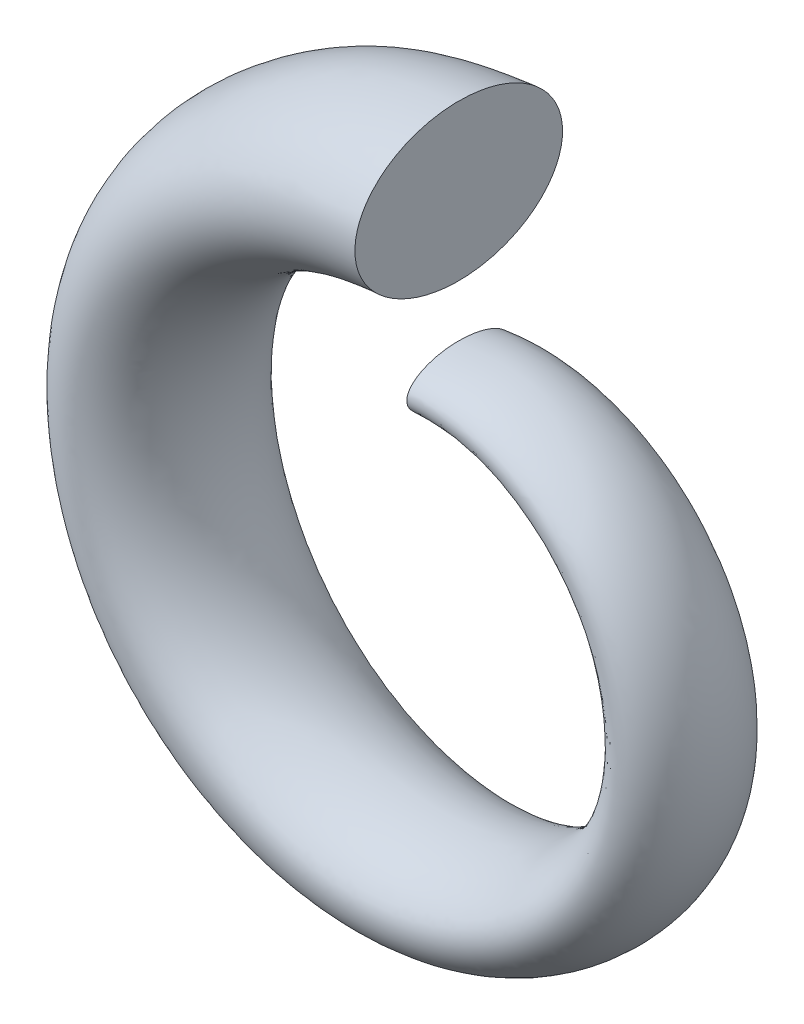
ISO-10303-21;
HEADER;
FILE_DESCRIPTION(('STEP AP214'),'2;1');
FILE_NAME('part.step','',(''),(''),'','','');
FILE_SCHEMA(('AUTOMOTIVE_DESIGN { 1 0 10303 214 1 1 1 1 }'));
ENDSEC;
DATA;
#1=APPLICATION_CONTEXT('core data for automotive mechanical design processes');
#2=APPLICATION_PROTOCOL_DEFINITION('international standard','automotive_design',2000,#1);
#3=PRODUCT_CONTEXT('',#1,'mechanical');
#4=PRODUCT('Part','Part','',(#3));
#5=PRODUCT_RELATED_PRODUCT_CATEGORY('part','',(#4));
#6=PRODUCT_DEFINITION_FORMATION('','',#4);
#7=PRODUCT_DEFINITION_CONTEXT('part definition',#1,'design');
#8=PRODUCT_DEFINITION('design','',#6,#7);
#9=PRODUCT_DEFINITION_SHAPE('','',#8);
#10=(LENGTH_UNIT() NAMED_UNIT(*) SI_UNIT(.MILLI.,.METRE.));
#11=(NAMED_UNIT(*) PLANE_ANGLE_UNIT() SI_UNIT($,.RADIAN.));
#12=(NAMED_UNIT(*) SI_UNIT($,.STERADIAN.) SOLID_ANGLE_UNIT());
#13=UNCERTAINTY_MEASURE_WITH_UNIT(LENGTH_MEASURE(1.E-05),#10,'distance_accuracy_value','');
#14=(GEOMETRIC_REPRESENTATION_CONTEXT(3) GLOBAL_UNCERTAINTY_ASSIGNED_CONTEXT((#13)) GLOBAL_UNIT_ASSIGNED_CONTEXT((#10,
#11,#12)) REPRESENTATION_CONTEXT('',''));
#15=CARTESIAN_POINT('',(0.,0.,0.));
#16=DIRECTION('',(0.,0.,1.));
#17=DIRECTION('',(1.,0.,0.));
#18=AXIS2_PLACEMENT_3D('',#15,#16,#17);
#19=CARTESIAN_POINT('',(0.,40.,-1.22941265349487E-07));
#20=CARTESIAN_POINT('',(-2.00647602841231,39.686819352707,0.));
#21=CARTESIAN_POINT('',(-4.57907761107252,39.2924064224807,0.));
#22=CARTESIAN_POINT('',(-8.51628287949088,38.3649786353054,0.));
#23=CARTESIAN_POINT('',(-11.5029595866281,37.4270838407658,0.));
#24=CARTESIAN_POINT('',(-14.6670373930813,35.9673050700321,0.));
#25=CARTESIAN_POINT('',(-18.1972980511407,33.9542244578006,0.));
#26=CARTESIAN_POINT('',(-22.2601942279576,31.0089087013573,0.));
#27=CARTESIAN_POINT('',(-26.5476127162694,26.7125237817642,0.));
#28=CARTESIAN_POINT('',(-30.5963753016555,21.0961081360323,0.));
#29=CARTESIAN_POINT('',(-33.0870763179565,15.6046113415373,9.06054706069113E-11));
#30=CARTESIAN_POINT('',(-35.0203749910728,8.29284681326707,-6.93996268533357E-10));
#31=CARTESIAN_POINT('',(-35.3500459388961,3.08249981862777,-1.14062132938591E-10));
#32=CARTESIAN_POINT('',(-34.4681457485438,-4.88938217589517,1.97959281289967E-10));
#33=CARTESIAN_POINT('',(-33.0970654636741,-9.2650927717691,5.16883781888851E-11));
#34=CARTESIAN_POINT('',(-29.3824188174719,-16.3410083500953,-5.01541527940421E-11));
#35=CARTESIAN_POINT('',(-26.6409679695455,-19.8564053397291,-1.7473164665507E-11));
#36=CARTESIAN_POINT('',(-20.615064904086,-25.0196162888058,1.21439611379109E-11));
#37=CARTESIAN_POINT('',(-16.5816673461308,-27.3436169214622,2.71089895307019E-12));
#38=CARTESIAN_POINT('',(-9.42808072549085,-29.7402300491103,-1.93583219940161E-12));
#39=CARTESIAN_POINT('',(-4.76176337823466,-30.3541041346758,7.27168464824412E-12));
#40=CARTESIAN_POINT('',(2.51827269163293,-29.8526695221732,-3.17268686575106E-12));
#41=CARTESIAN_POINT('',(6.96722872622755,-28.6276999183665,-3.0550139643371E-11));
#42=CARTESIAN_POINT('',(13.384266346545,-25.3796274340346,1.62315784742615E-11));
#43=CARTESIAN_POINT('',(16.8019740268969,-22.6386762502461,1.13515922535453E-10));
#44=CARTESIAN_POINT('',(21.4229838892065,-17.0830354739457,-8.31727470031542E-11));
#45=CARTESIAN_POINT('',(23.2678400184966,-13.5241471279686,-4.30045102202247E-10));
#46=CARTESIAN_POINT('',(25.152963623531,-6.85864247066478,4.06092436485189E-10));
#47=CARTESIAN_POINT('',(25.4629853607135,-2.91230357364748,1.67138232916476E-09));
#48=CARTESIAN_POINT('',(24.4529604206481,3.61551888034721,-2.01438225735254E-09));
#49=CARTESIAN_POINT('',(22.9442208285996,7.72632598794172,0.));
#50=CARTESIAN_POINT('',(19.7091715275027,12.5108832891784,9.77780998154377E-09));
#51=CARTESIAN_POINT('',(17.5205855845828,14.6904171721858,0.));
#52=CARTESIAN_POINT('',(14.4876225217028,16.9966727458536,-1.07172142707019E-08));
#53=CARTESIAN_POINT('',(11.9240604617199,18.4449267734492,0.));
#54=CARTESIAN_POINT('',(8.34888879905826,19.6684295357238,-1.60752497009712E-08));
#55=CARTESIAN_POINT('',(5.94221497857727,20.110920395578,0.));
#56=CARTESIAN_POINT('',(3.22120187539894,20.2498412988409,0.));
#57=CARTESIAN_POINT('',(1.33980610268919,20.1051213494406,0.));
#58=CARTESIAN_POINT('',(0.,20.,-5.32066302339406E-07));
#59=CARTESIAN_POINT('',(0.,40.,0.575612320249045));
#60=CARTESIAN_POINT('',(-2.00647602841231,39.6868193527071,0.572309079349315));
#61=CARTESIAN_POINT('',(-4.57907761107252,39.2924064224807,0.568069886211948));
#62=CARTESIAN_POINT('',(-8.51628287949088,38.3649786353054,0.561634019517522));
#63=CARTESIAN_POINT('',(-11.5029595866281,37.4270838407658,0.556784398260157));
#64=CARTESIAN_POINT('',(-14.6670373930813,35.9673050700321,0.551553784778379));
#65=CARTESIAN_POINT('',(-18.1972980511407,33.9542244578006,0.545568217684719));
#66=CARTESIAN_POINT('',(-22.2601942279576,31.0089087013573,0.538340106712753));
#67=CARTESIAN_POINT('',(-26.5476127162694,26.7125237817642,0.529869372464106));
#68=CARTESIAN_POINT('',(-30.5963753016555,21.0961081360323,0.520469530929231));
#69=CARTESIAN_POINT('',(-33.0870763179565,15.6046113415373,0.512561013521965));
#70=CARTESIAN_POINT('',(-35.0203749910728,8.29284681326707,0.502752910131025));
#71=CARTESIAN_POINT('',(-35.3500459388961,3.08249981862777,0.49616806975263));
#72=CARTESIAN_POINT('',(-34.4681457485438,-4.88938217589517,0.485996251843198));
#73=CARTESIAN_POINT('',(-33.0970654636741,-9.2650927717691,0.48029515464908));
#74=CARTESIAN_POINT('',(-29.3824188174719,-16.3410083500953,0.470136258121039));
#75=CARTESIAN_POINT('',(-26.6409679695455,-19.8564053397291,0.464523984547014));
#76=CARTESIAN_POINT('',(-20.615064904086,-25.0196162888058,0.454169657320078));
#77=CARTESIAN_POINT('',(-16.5816673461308,-27.3436169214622,0.448069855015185));
#78=CARTESIAN_POINT('',(-9.42808072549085,-29.7402300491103,0.437737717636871));
#79=CARTESIAN_POINT('',(-4.76176337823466,-30.3541041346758,0.431188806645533));
#80=CARTESIAN_POINT('',(2.51827269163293,-29.8526695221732,0.420494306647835));
#81=CARTESIAN_POINT('',(6.96722872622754,-28.6276999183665,0.413563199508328));
#82=CARTESIAN_POINT('',(13.384266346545,-25.3796274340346,0.402104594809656));
#83=CARTESIAN_POINT('',(16.8019740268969,-22.6386762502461,0.394911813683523));
#84=CARTESIAN_POINT('',(21.4229838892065,-17.0830354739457,0.38224217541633));
#85=CARTESIAN_POINT('',(23.2678400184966,-13.5241471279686,0.37498676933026));
#86=CARTESIAN_POINT('',(25.152963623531,-6.85864247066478,0.361504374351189));
#87=CARTESIAN_POINT('',(25.4629853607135,-2.91230357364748,0.353572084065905));
#88=CARTESIAN_POINT('',(24.4529604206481,3.61551888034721,0.339221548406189));
#89=CARTESIAN_POINT('',(22.9442208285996,7.72632598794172,0.329338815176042));
#90=CARTESIAN_POINT('',(19.7091715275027,12.5108832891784,0.315299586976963));
#91=CARTESIAN_POINT('',(17.5205855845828,14.6904171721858,0.307459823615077));
#92=CARTESIAN_POINT('',(14.4876225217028,16.9966727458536,0.297312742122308));
#93=CARTESIAN_POINT('',(11.9240604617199,18.4449267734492,0.289200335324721));
#94=CARTESIAN_POINT('',(8.34888879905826,19.6684295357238,0.278379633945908));
#95=CARTESIAN_POINT('',(5.94221497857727,20.110920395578,0.271132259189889));
#96=CARTESIAN_POINT('',(3.22120187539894,20.2498412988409,0.262713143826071));
#97=CARTESIAN_POINT('',(1.33980610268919,20.1051213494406,0.256643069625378));
#98=CARTESIAN_POINT('',(0.,20.,0.252303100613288));
#99=CARTESIAN_POINT('',(0.,39.9259606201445,1.72715261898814));
#100=CARTESIAN_POINT('',(-2.00345261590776,39.6177969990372,1.71757111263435));
#101=CARTESIAN_POINT('',(-4.57173051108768,39.2243853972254,1.70526907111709));
#102=CARTESIAN_POINT('',(-8.50155053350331,38.2966168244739,1.68651237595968));
#103=CARTESIAN_POINT('',(-11.4823478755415,37.3580741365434,1.67231714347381));
#104=CARTESIAN_POINT('',(-14.6406382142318,35.9013086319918,1.65693239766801));
#105=CARTESIAN_POINT('',(-18.1647601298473,33.8934154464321,1.63926718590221));
#106=CARTESIAN_POINT('',(-22.2209918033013,30.954458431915,1.61782730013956));
#107=CARTESIAN_POINT('',(-26.5013423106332,26.6659454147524,1.59252377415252));
#108=CARTESIAN_POINT('',(-30.5433233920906,21.059023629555,1.564255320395));
#109=CARTESIAN_POINT('',(-33.0299914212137,15.5773060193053,1.54029200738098));
#110=CARTESIAN_POINT('',(-34.960252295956,8.27807434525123,1.51040826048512));
#111=CARTESIAN_POINT('',(-35.2895911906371,3.07676836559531,1.4902246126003));
#112=CARTESIAN_POINT('',(-34.409464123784,-4.88149435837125,1.45892754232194));
#113=CARTESIAN_POINT('',(-33.040818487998,-9.24985272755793,1.44131478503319));
#114=CARTESIAN_POINT('',(-29.3326000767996,-16.3139100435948,1.40987272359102));
#115=CARTESIAN_POINT('',(-26.5958334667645,-19.8234335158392,1.39247159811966));
#116=CARTESIAN_POINT('',(-20.580143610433,-24.9781025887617,1.3603689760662));
#117=CARTESIAN_POINT('',(-16.5535458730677,-27.2983168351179,1.3414611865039));
#118=CARTESIAN_POINT('',(-9.41192919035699,-29.6911316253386,1.30949424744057));
#119=CARTESIAN_POINT('',(-4.75336684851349,-30.3041308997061,1.28927169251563));
#120=CARTESIAN_POINT('',(2.51469814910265,-29.8038072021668,1.25635541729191));
#121=CARTESIAN_POINT('',(6.95642453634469,-28.5810764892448,1.23509169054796));
#122=CARTESIAN_POINT('',(13.3632342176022,-25.3386715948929,1.20008418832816));
#123=CARTESIAN_POINT('',(16.7756377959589,-22.6023945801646,1.17819964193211));
#124=CARTESIAN_POINT('',(21.3897972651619,-17.0560195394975,1.13982887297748));
#125=CARTESIAN_POINT('',(23.2321552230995,-13.502960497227,1.11795579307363));
#126=CARTESIAN_POINT('',(25.1152460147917,-6.84798293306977,1.07750098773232));
#127=CARTESIAN_POINT('',(25.4254225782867,-2.90767505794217,1.05379851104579));
#128=CARTESIAN_POINT('',(24.418046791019,3.61056800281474,1.01113628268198));
#129=CARTESIAN_POINT('',(22.9123660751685,7.71595209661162,0.98187220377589));
#130=CARTESIAN_POINT('',(19.6831131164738,12.4947267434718,0.940502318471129));
#131=CARTESIAN_POINT('',(17.4980910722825,14.6715236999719,0.917482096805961));
#132=CARTESIAN_POINT('',(14.4696279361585,16.975552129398,0.887763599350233));
#133=CARTESIAN_POINT('',(11.9093422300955,18.4238426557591,0.864057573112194));
#134=CARTESIAN_POINT('',(8.33917447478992,19.6455193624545,0.832531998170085));
#135=CARTESIAN_POINT('',(5.93559068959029,20.0887485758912,0.811440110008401));
#136=CARTESIAN_POINT('',(3.21750889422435,20.231330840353,0.787003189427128));
#137=CARTESIAN_POINT('',(1.33803508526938,20.0884459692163,0.769451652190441));
#138=CARTESIAN_POINT('',(0.,19.9809686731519,0.756886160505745));
#139=CARTESIAN_POINT('',(0.,39.5879234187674,3.42407821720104));
#140=CARTESIAN_POINT('',(-1.98908423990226,39.2989459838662,3.40614598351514));
#141=CARTESIAN_POINT('',(-4.53725917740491,38.9097671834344,3.38310507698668));
#142=CARTESIAN_POINT('',(-8.43349157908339,37.9821488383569,3.3477314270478));
#143=CARTESIAN_POINT('',(-11.3878098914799,37.0428111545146,3.32077343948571));
#144=CARTESIAN_POINT('',(-14.5197102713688,35.5997112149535,3.29133212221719));
#145=CARTESIAN_POINT('',(-18.0155916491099,33.6144036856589,3.25734718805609));
#146=CARTESIAN_POINT('',(-22.0408565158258,30.7038317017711,3.21577929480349));
#147=CARTESIAN_POINT('',(-26.2885186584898,26.4513823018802,3.16619252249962));
#148=CARTESIAN_POINT('',(-30.299446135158,20.8886448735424,3.11023561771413));
#149=CARTESIAN_POINT('',(-32.7677382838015,15.4518649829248,3.06227297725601));
#150=CARTESIAN_POINT('',(-34.6843930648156,8.21043125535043,3.001981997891));
#151=CARTESIAN_POINT('',(-35.012484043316,3.05054584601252,2.96091180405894));
#152=CARTESIAN_POINT('',(-34.1410284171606,-4.84541185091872,2.89688608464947));
#153=CARTESIAN_POINT('',(-32.7839087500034,-9.18020768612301,2.86065029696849));
#154=CARTESIAN_POINT('',(-29.105702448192,-16.1904335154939,2.79579835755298));
#155=CARTESIAN_POINT('',(-26.3906510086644,-19.6734748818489,2.75981874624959));
#156=CARTESIAN_POINT('',(-20.4219228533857,-24.7899418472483,2.69344561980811));
#157=CARTESIAN_POINT('',(-16.4264126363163,-27.0934247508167,2.65436479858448));
#158=CARTESIAN_POINT('',(-9.33917795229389,-29.4698265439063,2.58846247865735));
#159=CARTESIAN_POINT('',(-4.71565162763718,-30.0793971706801,2.54688425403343));
#160=CARTESIAN_POINT('',(2.49862984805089,-29.5848172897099,2.47951453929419));
#161=CARTESIAN_POINT('',(6.90806549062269,-28.3725683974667,2.43619272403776));
#162=CARTESIAN_POINT('',(13.2694252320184,-25.1560917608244,2.36528965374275));
#163=CARTESIAN_POINT('',(16.6584120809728,-22.440953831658,2.32122614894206));
#164=CARTESIAN_POINT('',(21.242477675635,-16.9361395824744,2.24448297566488));
#165=CARTESIAN_POINT('',(23.0739655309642,-13.4090536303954,2.20102815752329));
#166=CARTESIAN_POINT('',(24.9483249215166,-6.80083758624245,2.12121607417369));
#167=CARTESIAN_POINT('',(25.2593003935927,-2.8872438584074,2.07474481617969));
#168=CARTESIAN_POINT('',(24.2637090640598,3.58871788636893,1.99174616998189));
#169=CARTESIAN_POINT('',(22.7714973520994,7.66997720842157,1.93515756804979));
#170=CARTESIAN_POINT('',(19.5675940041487,12.4229654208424,1.8557615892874));
#171=CARTESIAN_POINT('',(17.398189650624,14.587782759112,1.81182601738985));
#172=CARTESIAN_POINT('',(14.3895997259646,16.8817822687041,1.7553362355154));
#173=CARTESIAN_POINT('',(11.8440558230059,18.3292683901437,1.71043582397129));
#174=CARTESIAN_POINT('',(8.29583670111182,19.5434635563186,1.65101118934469));
#175=CARTESIAN_POINT('',(5.90588750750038,19.989259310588,1.61132637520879));
#176=CARTESIAN_POINT('',(3.20106657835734,20.1456497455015,1.56554127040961));
#177=CARTESIAN_POINT('',(1.3303125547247,20.0100656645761,1.53285700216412));
#178=CARTESIAN_POINT('',(0.,19.8940532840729,1.50940750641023));
#179=CARTESIAN_POINT('',(0.,39.0180480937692,5.05928714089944));
#180=CARTESIAN_POINT('',(-1.96411957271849,38.756524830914,5.03415124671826));
#181=CARTESIAN_POINT('',(-4.47792774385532,38.3740336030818,5.00183453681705));
#182=CARTESIAN_POINT('',(-8.31770548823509,37.4488997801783,4.95191518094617));
#183=CARTESIAN_POINT('',(-11.2278578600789,36.5110510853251,4.91363910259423));
#184=CARTESIAN_POINT('',(-14.3153024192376,35.090848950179,4.8715603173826));
#185=CARTESIAN_POINT('',(-17.7632762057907,33.142149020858,4.82276849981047));
#186=CARTESIAN_POINT('',(-21.7355936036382,30.2785467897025,4.76270021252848));
#187=CARTESIAN_POINT('',(-25.9275360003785,26.0870209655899,4.69040854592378));
#188=CARTESIAN_POINT('',(-29.8858935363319,20.5998457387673,4.60816181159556));
#189=CARTESIAN_POINT('',(-32.3231481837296,15.2392038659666,4.53704134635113));
#190=CARTESIAN_POINT('',(-34.2170594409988,8.09600770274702,4.44708181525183));
#191=CARTESIAN_POINT('',(-34.5432882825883,3.00620107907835,4.38539664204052));
#192=CARTESIAN_POINT('',(-33.6870513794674,-4.78440105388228,4.28884102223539));
#193=CARTESIAN_POINT('',(-32.34982566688,-9.06249855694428,4.23396087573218));
#194=CARTESIAN_POINT('',(-28.7230071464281,-15.9821092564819,4.1355540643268));
#195=CARTESIAN_POINT('',(-26.0449828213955,-19.4207695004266,4.08085825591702));
#196=CARTESIAN_POINT('',(-20.1559306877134,-24.4735412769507,3.97996328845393));
#197=CARTESIAN_POINT('',(-16.2129762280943,-26.7493419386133,3.92056895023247));
#198=CARTESIAN_POINT('',(-9.21732013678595,-29.0989833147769,3.82060480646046));
#199=CARTESIAN_POINT('',(-4.65258722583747,-29.7033461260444,3.75766390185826));
#200=CARTESIAN_POINT('',(2.47174899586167,-29.2191440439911,3.65602926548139));
#201=CARTESIAN_POINT('',(6.82737852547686,-28.0248450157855,3.59090041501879));
#202=CARTESIAN_POINT('',(13.113225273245,-24.852171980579,3.4847882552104));
#203=CARTESIAN_POINT('',(16.4634492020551,-22.172500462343,3.41914463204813));
#204=CARTESIAN_POINT('',(20.9977997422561,-16.7370747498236,3.30541389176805));
#205=CARTESIAN_POINT('',(22.8113959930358,-13.2531794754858,3.24135696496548));
#206=CARTESIAN_POINT('',(24.6713850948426,-6.72264003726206,3.12436304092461));
#207=CARTESIAN_POINT('',(24.9836760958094,-2.85337804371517,3.05658674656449));
#208=CARTESIAN_POINT('',(24.0074578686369,3.55250723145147,2.93630620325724));
#209=CARTESIAN_POINT('',(22.5373430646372,7.59343394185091,2.85471243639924));
#210=CARTESIAN_POINT('',(19.3749536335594,12.30310992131,2.74096058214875));
#211=CARTESIAN_POINT('',(17.2312251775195,14.4480851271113,2.67831150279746));
#212=CARTESIAN_POINT('',(14.255575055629,16.7249912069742,2.59804129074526));
#213=CARTESIAN_POINT('',(11.7348926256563,18.1695873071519,2.53443663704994));
#214=CARTESIAN_POINT('',(8.2229426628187,19.372043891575,2.45061235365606));
#215=CARTESIAN_POINT('',(5.85567397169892,19.8209851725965,2.39472783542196));
#216=CARTESIAN_POINT('',(3.17342448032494,19.9967362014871,2.33048753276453));
#217=CARTESIAN_POINT('',(1.31757387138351,19.8720264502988,2.28487291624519));
#218=CARTESIAN_POINT('',(0.,19.7445319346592,2.25208757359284));
#219=CARTESIAN_POINT('',(0.,38.2029669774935,6.58801157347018));
#220=CARTESIAN_POINT('',(-1.92736617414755,37.9738007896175,6.55690790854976));
#221=CARTESIAN_POINT('',(-4.39134633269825,37.6002112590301,6.51689692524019));
#222=CARTESIAN_POINT('',(-8.15059797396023,36.6817178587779,6.45475383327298));
#223=CARTESIAN_POINT('',(-10.9982238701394,35.7499368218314,6.40684803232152));
#224=CARTESIAN_POINT('',(-14.0220972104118,34.3622440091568,6.35387948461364));
#225=CARTESIAN_POINT('',(-17.4010861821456,32.4637982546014,6.29222229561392));
#226=CARTESIAN_POINT('',(-21.2965694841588,29.6661068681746,6.21589333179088));
#227=CARTESIAN_POINT('',(-25.407876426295,25.5618925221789,6.1233484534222));
#228=CARTESIAN_POINT('',(-29.2906426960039,20.1843234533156,6.0173466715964));
#229=CARTESIAN_POINT('',(-31.6833447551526,14.9331566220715,5.92502442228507));
#230=CARTESIAN_POINT('',(-33.5449182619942,7.93167339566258,5.80766178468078));
#231=CARTESIAN_POINT('',(-33.8687828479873,2.94252620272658,5.72676446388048));
#232=CARTESIAN_POINT('',(-33.0351194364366,-4.69680691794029,5.59972973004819));
#233=CARTESIAN_POINT('',(-31.7269944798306,-8.89356172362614,5.52728477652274));
#234=CARTESIAN_POINT('',(-28.1748134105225,-15.6836086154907,5.39719044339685));
#235=CARTESIAN_POINT('',(-25.5503682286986,-19.0590779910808,5.32477972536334));
#236=CARTESIAN_POINT('',(-19.7760771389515,-24.021600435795,5.19121167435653));
#237=CARTESIAN_POINT('',(-15.908569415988,-26.2584683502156,5.11259692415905));
#238=CARTESIAN_POINT('',(-9.04389951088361,-28.5710085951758,4.98048121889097));
#239=CARTESIAN_POINT('',(-4.56298160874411,-29.1686762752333,4.89742693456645));
#240=CARTESIAN_POINT('',(2.43353821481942,-28.7002439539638,4.7636727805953));
#241=CARTESIAN_POINT('',(6.71296578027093,-27.5319994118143,4.67819517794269));
#242=CARTESIAN_POINT('',(12.8921455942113,-24.4221315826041,4.5394276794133));
#243=CARTESIAN_POINT('',(16.187792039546,-21.7929876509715,4.45389537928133));
#244=CARTESIAN_POINT('',(20.6522360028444,-16.4559768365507,4.30633017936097));
#245=CARTESIAN_POINT('',(22.4407276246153,-13.0331154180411,4.2235750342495));
#246=CARTESIAN_POINT('',(24.2804611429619,-6.61227831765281,4.07312409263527));
#247=CARTESIAN_POINT('',(24.5944955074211,-2.80559245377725,3.98633102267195));
#248=CARTESIAN_POINT('',(23.6451905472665,3.50142403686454,3.83312229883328));
#249=CARTESIAN_POINT('',(22.2057924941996,7.48488957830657,3.72963526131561));
#250=CARTESIAN_POINT('',(19.1011107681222,12.1324764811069,3.58614580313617));
#251=CARTESIAN_POINT('',(16.9932556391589,14.2493656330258,3.5074424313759));
#252=CARTESIAN_POINT('',(14.0640520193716,16.5013023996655,3.40690766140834));
#253=CARTESIAN_POINT('',(11.5790695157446,17.9394027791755,3.32746173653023));
#254=CARTESIAN_POINT('',(8.11819299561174,19.1260725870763,3.223150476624));
#255=CARTESIAN_POINT('',(5.78311393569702,19.5777232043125,3.15371359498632));
#256=CARTESIAN_POINT('',(3.13368122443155,19.7755197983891,3.07415196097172));
#257=CARTESIAN_POINT('',(1.29961691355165,19.6642643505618,3.01792693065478));
#258=CARTESIAN_POINT('',(0.,19.5243812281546,2.9774510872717));
#259=CARTESIAN_POINT('',(0.,37.1315281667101,7.95235721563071));
#260=CARTESIAN_POINT('',(-1.87774339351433,36.9362445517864,7.91661571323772));
#261=CARTESIAN_POINT('',(-4.27538031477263,36.5735143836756,7.87061715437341));
#262=CARTESIAN_POINT('',(-7.92904308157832,35.6675750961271,7.79885012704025));
#263=CARTESIAN_POINT('',(-10.6952651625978,34.748655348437,7.7432805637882));
#264=CARTESIAN_POINT('',(-13.635557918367,33.4033419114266,7.68155067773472));
#265=CARTESIAN_POINT('',(-16.9232341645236,31.5682582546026,7.60946990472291));
#266=CARTESIAN_POINT('',(-20.7162453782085,28.8555382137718,7.51983997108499));
#267=CARTESIAN_POINT('',(-24.7202172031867,24.8662278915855,7.4105285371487));
#268=CARTESIAN_POINT('',(-28.5028660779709,19.6345903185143,7.28466072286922));
#269=CARTESIAN_POINT('',(-30.8365333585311,14.5280582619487,7.17442775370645));
#270=CARTESIAN_POINT('',(-32.6554634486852,7.71447796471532,7.03376045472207));
#271=CARTESIAN_POINT('',(-32.9763245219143,2.85834642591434,6.93641514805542));
#272=CARTESIAN_POINT('',(-32.1729642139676,-4.58102099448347,6.78318358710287));
#273=CARTESIAN_POINT('',(-30.9037203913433,-8.67023014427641,6.69558141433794));
#274=CARTESIAN_POINT('',(-27.4508918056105,-15.2893474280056,6.53809569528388));
#275=CARTESIAN_POINT('',(-24.8976272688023,-18.5816777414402,6.45034669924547));
#276=CARTESIAN_POINT('',(-19.2753766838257,-23.4258004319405,6.28849016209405));
#277=CARTESIAN_POINT('',(-15.507622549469,-25.6118133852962,6.19323756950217));
#278=CARTESIAN_POINT('',(-8.81576378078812,-27.8762941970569,6.03333852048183));
#279=CARTESIAN_POINT('',(-4.44520641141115,-28.4656892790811,5.9329354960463));
#280=CARTESIAN_POINT('',(2.3833031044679,-28.0186901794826,5.77156530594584));
#281=CARTESIAN_POINT('',(6.56274456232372,-26.8850216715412,5.66865042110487));
#282=CARTESIAN_POINT('',(12.6020840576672,-23.8579665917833,5.50202562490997));
#283=CARTESIAN_POINT('',(15.8262437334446,-21.2952233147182,5.39960703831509));
#284=CARTESIAN_POINT('',(20.1989832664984,-16.0872766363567,5.22347737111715));
#285=CARTESIAN_POINT('',(21.9544184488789,-12.7443221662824,5.12503144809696));
#286=CARTESIAN_POINT('',(23.7669798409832,-6.46729925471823,4.94669214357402));
#287=CARTESIAN_POINT('',(24.0827555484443,-2.74275041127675,4.84414826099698));
#288=CARTESIAN_POINT('',(23.1676134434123,3.43426289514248,4.66389707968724));
#289=CARTESIAN_POINT('',(21.7675797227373,7.34125616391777,4.54255791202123));
#290=CARTESIAN_POINT('',(18.7372543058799,11.9054476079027,4.37505064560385));
#291=CARTESIAN_POINT('',(16.6759929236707,13.9849784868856,4.28347825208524));
#292=CARTESIAN_POINT('',(13.8077906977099,16.2025196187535,4.16679415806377));
#293=CARTESIAN_POINT('',(11.3706328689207,17.6284802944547,4.07479153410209));
#294=CARTESIAN_POINT('',(7.9769903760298,18.7950186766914,3.95436389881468));
#295=CARTESIAN_POINT('',(5.68469580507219,19.2476764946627,3.87429763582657));
#296=CARTESIAN_POINT('',(3.08000174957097,19.4671423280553,3.78280578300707));
#297=CARTESIAN_POINT('',(1.27585033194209,19.3708919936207,3.71841069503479));
#298=CARTESIAN_POINT('',(0.,19.2197289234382,3.67198893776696));
#299=CARTESIAN_POINT('',(0.,36.0205247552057,8.88134046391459));
#300=CARTESIAN_POINT('',(-1.82500758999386,35.8519102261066,8.84293062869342));
#301=CARTESIAN_POINT('',(-4.15302744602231,35.4996175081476,8.79348166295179));
#302=CARTESIAN_POINT('',(-7.6974531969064,34.6104120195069,8.71614404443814));
#303=CARTESIAN_POINT('',(-10.3800236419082,33.7095658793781,8.65612180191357));
#304=CARTESIAN_POINT('',(-13.2335993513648,32.4077784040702,8.58928042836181));
#305=CARTESIAN_POINT('',(-16.4259061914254,30.6356569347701,8.51110062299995));
#306=CARTESIAN_POINT('',(-20.1110868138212,28.00926911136,8.41365722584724));
#307=CARTESIAN_POINT('',(-24.0021910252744,24.1390674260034,8.29444773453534));
#308=CARTESIAN_POINT('',(-27.6798701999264,19.060423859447,8.15680715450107));
#309=CARTESIAN_POINT('',(-29.9513904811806,14.1045611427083,8.03592111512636));
#310=CARTESIAN_POINT('',(-31.7252911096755,7.48756280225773,7.88135594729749));
#311=CARTESIAN_POINT('',(-32.0426369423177,2.77030476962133,7.77417748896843));
#312=CARTESIAN_POINT('',(-31.2705935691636,-4.45994089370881,7.60526185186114));
#313=CARTESIAN_POINT('',(-30.0419249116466,-8.43648003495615,7.50857176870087));
#314=CARTESIAN_POINT('',(-26.6929480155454,-14.8765482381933,7.33465246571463));
#315=CARTESIAN_POINT('',(-24.2141516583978,-18.0818069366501,7.23769570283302));
#316=CARTESIAN_POINT('',(-18.7510058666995,-22.8018498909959,7.05885747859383));
#317=CARTESIAN_POINT('',(-15.0876564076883,-24.9345078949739,6.95361783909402));
#318=CARTESIAN_POINT('',(-8.57672686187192,-27.1484309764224,6.77705205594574));
#319=CARTESIAN_POINT('',(-4.32175208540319,-27.728984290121,6.6662488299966));
#320=CARTESIAN_POINT('',(2.33065178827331,-27.30403528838,6.48834283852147));
#321=CARTESIAN_POINT('',(6.405184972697,-26.2062516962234,6.37499978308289));
#322=CARTESIAN_POINT('',(12.297487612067,-23.2654204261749,6.19174300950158));
#323=CARTESIAN_POINT('',(15.446246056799,-20.7719364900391,6.07926037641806));
#324=CARTESIAN_POINT('',(19.7216615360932,-15.6988831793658,5.8861427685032));
#325=CARTESIAN_POINT('',(21.44154798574,-12.4395905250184,5.77838648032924));
#326=CARTESIAN_POINT('',(23.2237305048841,-6.31381779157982,5.5835414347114));
#327=CARTESIAN_POINT('',(23.5400986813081,-2.67601714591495,5.47169829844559));
#328=CARTESIAN_POINT('',(22.6588352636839,3.36296617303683,5.27553396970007));
#329=CARTESIAN_POINT('',(21.298844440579,7.18751953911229,5.14371885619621));
#330=CARTESIAN_POINT('',(18.3452740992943,11.6606042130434,4.96217175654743));
#331=CARTESIAN_POINT('',(16.3327169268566,13.6995299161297,4.86309799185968));
#332=CARTESIAN_POINT('',(13.5291654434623,15.8782419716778,4.73702571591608));
#333=CARTESIAN_POINT('',(11.1438033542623,17.2869680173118,4.63773999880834));
#334=CARTESIAN_POINT('',(7.82197305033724,18.4321624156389,4.50799039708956));
#335=CARTESIAN_POINT('',(5.57591523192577,18.8828382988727,4.42177258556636));
#336=CARTESIAN_POINT('',(3.02084877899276,19.1172281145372,4.32341016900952));
#337=CARTESIAN_POINT('',(1.25017821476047,19.0338673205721,4.25434611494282));
#338=CARTESIAN_POINT('',(0.,18.8758721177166,4.20450983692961));
#339=CARTESIAN_POINT('',(0.,35.0122928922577,9.44372026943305));
#340=CARTESIAN_POINT('',(-1.77630792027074,34.862315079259,9.40394298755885));
#341=CARTESIAN_POINT('',(-4.04061136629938,34.5189870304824,9.35272274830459));
#342=CARTESIAN_POINT('',(-7.48607797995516,33.6474407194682,9.27254901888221));
#343=CARTESIAN_POINT('',(-10.0932406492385,32.7661100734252,9.21027849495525));
#344=CARTESIAN_POINT('',(-12.8680704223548,31.5034843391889,9.14087481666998));
#345=CARTESIAN_POINT('',(-15.9733209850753,29.7865795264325,9.05964955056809));
#346=CARTESIAN_POINT('',(-19.5594648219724,27.237174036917,8.95832487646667));
#347=CARTESIAN_POINT('',(-23.3467943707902,23.4747873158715,8.83422942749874));
#348=CARTESIAN_POINT('',(-26.9279111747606,18.5358603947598,8.69081229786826));
#349=CARTESIAN_POINT('',(-29.1417802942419,13.7171157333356,8.56473107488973));
#350=CARTESIAN_POINT('',(-30.8733330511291,7.27981729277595,8.40341139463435));
#351=CARTESIAN_POINT('',(-31.1865017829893,2.68953366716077,8.29147160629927));
#352=CARTESIAN_POINT('',(-30.4417507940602,-4.3488747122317,8.11497806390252));
#353=CARTESIAN_POINT('',(-29.2495377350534,-8.22165979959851,8.0139066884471));
#354=CARTESIAN_POINT('',(-25.9947458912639,-14.4963722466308,7.8320722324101));
#355=CARTESIAN_POINT('',(-23.5838182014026,-17.6209297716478,7.73068457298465));
#356=CARTESIAN_POINT('',(-18.2663639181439,-22.2253177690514,7.54367435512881));
#357=CARTESIAN_POINT('',(-14.6989386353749,-24.3077989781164,7.43362819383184));
#358=CARTESIAN_POINT('',(-8.3549045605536,-26.4733148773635,7.24903351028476));
#359=CARTESIAN_POINT('',(-4.20693690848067,-27.044536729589,7.13321510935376));
#360=CARTESIAN_POINT('',(2.28171463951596,-26.6382228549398,6.94732117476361));
#361=CARTESIAN_POINT('',(6.25822657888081,-25.5726001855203,6.82893127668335));
#362=CARTESIAN_POINT('',(12.0123327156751,-22.7103841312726,6.63760509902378));
#363=CARTESIAN_POINT('',(15.0896492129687,-20.2806253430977,6.52022672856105));
#364=CARTESIAN_POINT('',(19.2718341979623,-15.3326325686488,6.31881885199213));
#365=CARTESIAN_POINT('',(20.9569002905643,-12.1513962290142,6.20650347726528));
#366=CARTESIAN_POINT('',(22.7077231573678,-6.1678620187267,6.0035450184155));
#367=CARTESIAN_POINT('',(23.0229006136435,-2.61223969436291,5.88711405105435));
#368=CARTESIAN_POINT('',(22.1709256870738,3.29484973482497,5.68306017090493));
#369=CARTESIAN_POINT('',(20.8471236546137,7.03938951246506,5.54602909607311));
#370=CARTESIAN_POINT('',(17.9646347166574,11.4227207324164,5.35745288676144));
#371=CARTESIAN_POINT('',(15.9978927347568,13.4215914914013,5.25460472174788));
#372=CARTESIAN_POINT('',(13.2560067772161,15.5607795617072,5.12379578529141));
#373=CARTESIAN_POINT('',(10.9209918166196,16.9493015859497,5.0208241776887));
#374=CARTESIAN_POINT('',(7.6685164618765,18.0734214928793,4.88633047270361));
#375=CARTESIAN_POINT('',(5.46761345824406,18.5196323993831,4.79696239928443));
#376=CARTESIAN_POINT('',(2.96202189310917,18.762121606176,4.69508206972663));
#377=CARTESIAN_POINT('',(1.22501824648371,18.6887101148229,4.62362795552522));
#378=CARTESIAN_POINT('',(0.,18.5277410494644,4.57203482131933));
#379=CARTESIAN_POINT('',(0.,34.2070227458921,9.75985074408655));
#380=CARTESIAN_POINT('',(-1.73699880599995,34.0692052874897,9.71943770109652));
#381=CARTESIAN_POINT('',(-3.95014979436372,33.7328173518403,9.66739206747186));
#382=CARTESIAN_POINT('',(-7.31667449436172,32.8766280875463,9.58590738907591));
#383=CARTESIAN_POINT('',(-9.86387125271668,32.012433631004,9.5226063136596));
#384=CARTESIAN_POINT('',(-12.5757886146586,30.7809099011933,9.45203662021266));
#385=CARTESIAN_POINT('',(-15.611249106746,29.1071231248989,9.36943067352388));
#386=CARTESIAN_POINT('',(-19.1176706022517,26.6184539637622,9.26635527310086));
#387=CARTESIAN_POINT('',(-22.8213415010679,22.9419294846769,9.14006939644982));
#388=CARTESIAN_POINT('',(-26.3244843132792,18.1149122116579,8.99407849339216));
#389=CARTESIAN_POINT('',(-28.4914305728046,13.4058232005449,8.86569736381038));
#390=CARTESIAN_POINT('',(-30.1880285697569,7.11272893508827,8.70139776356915));
#391=CARTESIAN_POINT('',(-30.4970606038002,2.6244424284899,8.58736553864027));
#392=CARTESIAN_POINT('',(-29.7730830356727,-4.25937832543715,8.40754940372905));
#393=CARTESIAN_POINT('',(-28.6095623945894,-8.04824632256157,8.3045614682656));
#394=CARTESIAN_POINT('',(-25.4296774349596,-14.1887704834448,8.11926807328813));
#395=CARTESIAN_POINT('',(-23.0730188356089,-17.2475667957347,8.01594595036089));
#396=CARTESIAN_POINT('',(-17.8726921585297,-21.7571332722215,7.82536787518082));
#397=CARTESIAN_POINT('',(-14.3826787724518,-23.7980873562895,7.71322296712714));
#398=CARTESIAN_POINT('',(-8.17392806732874,-25.9228009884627,7.52511896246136));
#399=CARTESIAN_POINT('',(-4.11304803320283,-26.4854276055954,7.40710614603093));
#400=CARTESIAN_POINT('',(2.24172216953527,-26.0927635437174,7.21771052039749));
#401=CARTESIAN_POINT('',(6.13769259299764,-25.0524380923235,7.09710391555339));
#402=CARTESIAN_POINT('',(11.7776011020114,-22.2532445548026,6.90222412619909));
#403=CARTESIAN_POINT('',(14.7954333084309,-19.8750725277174,6.78268380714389));
#404=CARTESIAN_POINT('',(18.8992593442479,-15.0291085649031,6.57760284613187));
#405=CARTESIAN_POINT('',(20.5545166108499,-11.9119606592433,6.46326039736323));
#406=CARTESIAN_POINT('',(22.2774346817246,-6.04602895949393,6.2566804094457));
#407=CARTESIAN_POINT('',(22.590423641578,-2.55878357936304,6.13819396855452));
#408=CARTESIAN_POINT('',(21.7609662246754,3.23777007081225,5.93058779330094));
#409=CARTESIAN_POINT('',(20.4661724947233,6.91451317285,5.79119819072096));
#410=CARTESIAN_POINT('',(17.6418967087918,11.2209839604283,5.59942631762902));
#411=CARTESIAN_POINT('',(15.7131378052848,13.1854644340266,5.494853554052));
#412=CARTESIAN_POINT('',(13.0228775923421,15.2900731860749,5.36187507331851));
#413=CARTESIAN_POINT('',(10.7305337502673,16.6596079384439,5.2572102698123));
#414=CARTESIAN_POINT('',(7.53670278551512,17.7655127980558,5.12052505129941));
#415=CARTESIAN_POINT('',(5.37426190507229,18.2065899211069,5.02969138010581));
#416=CARTESIAN_POINT('',(2.91133157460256,18.4527057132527,4.92617666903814));
#417=CARTESIAN_POINT('',(1.20351787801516,18.3864195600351,4.85361457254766));
#418=CARTESIAN_POINT('',(0.,18.2246987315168,4.80120140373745));
#419=CARTESIAN_POINT('',(0.,33.3632746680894,9.95507585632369));
#420=CARTESIAN_POINT('',(-1.69537650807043,33.2353354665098,9.91441889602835));
#421=CARTESIAN_POINT('',(-3.85465615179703,32.9060173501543,9.86205408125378));
#422=CARTESIAN_POINT('',(-7.13858296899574,32.067288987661,9.78005876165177));
#423=CARTESIAN_POINT('',(-9.62324364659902,31.222719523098,9.71635429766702));
#424=CARTESIAN_POINT('',(-12.269243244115,30.0236146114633,9.64532470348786));
#425=CARTESIAN_POINT('',(-15.2313230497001,28.3939668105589,9.56217049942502));
#426=CARTESIAN_POINT('',(-18.6535645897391,25.9681189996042,9.45839341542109));
#427=CARTESIAN_POINT('',(-22.2687457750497,22.3812429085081,9.33121908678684));
#428=CARTESIAN_POINT('',(-25.6892352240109,17.671756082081,9.18417566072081));
#429=CARTESIAN_POINT('',(-27.806001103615,13.0776656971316,9.05484681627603));
#430=CARTESIAN_POINT('',(-29.4646228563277,6.93636210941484,8.88931130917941));
#431=CARTESIAN_POINT('',(-29.7683415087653,2.55558276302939,8.774406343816));
#432=CARTESIAN_POINT('',(-29.0648367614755,-4.16471052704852,8.59319975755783));
#433=CARTESIAN_POINT('',(-27.9308143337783,-7.86443393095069,8.48940706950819));
#434=CARTESIAN_POINT('',(-24.8289268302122,-13.8618478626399,8.30265916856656));
#435=CARTESIAN_POINT('',(-22.5291428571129,-16.8501703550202,8.1985224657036));
#436=CARTESIAN_POINT('',(-17.4523637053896,-21.2574068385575,8.00644206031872));
#437=CARTESIAN_POINT('',(-14.0443758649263,-23.2530683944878,7.89341357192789));
#438=CARTESIAN_POINT('',(-7.97971745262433,-25.3323845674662,7.70383428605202));
#439=CARTESIAN_POINT('',(-4.01202994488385,-25.8845808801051,7.58490039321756));
#440=CARTESIAN_POINT('',(2.19872388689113,-25.5046686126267,7.39403895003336));
#441=CARTESIAN_POINT('',(6.00756743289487,-24.4903505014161,7.27250704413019));
#442=CARTESIAN_POINT('',(11.5231738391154,-21.7574508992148,7.07614954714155));
#443=CARTESIAN_POINT('',(14.4757293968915,-19.4341661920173,6.95571382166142));
#444=CARTESIAN_POINT('',(18.4927291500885,-14.6977214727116,6.74911889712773));
#445=CARTESIAN_POINT('',(20.1143440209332,-11.6498591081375,6.63394521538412));
#446=CARTESIAN_POINT('',(21.8046160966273,-5.91201351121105,6.4258886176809));
#447=CARTESIAN_POINT('',(22.1138623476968,-2.49973766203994,6.30656864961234));
#448=CARTESIAN_POINT('',(21.3070465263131,3.17473597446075,6.09753239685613));
#449=CARTESIAN_POINT('',(20.0428593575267,6.77580655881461,5.95719892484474));
#450=CARTESIAN_POINT('',(17.2814358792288,10.9956312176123,5.76415905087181));
#451=CARTESIAN_POINT('',(15.3942007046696,12.9212446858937,5.65890556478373));
#452=CARTESIAN_POINT('',(12.7609178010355,14.9861278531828,5.52507677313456));
#453=CARTESIAN_POINT('',(10.5162164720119,16.332561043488,5.41975174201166));
#454=CARTESIAN_POINT('',(7.38773404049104,17.417768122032,5.28221551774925));
#455=CARTESIAN_POINT('',(5.26843915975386,17.8517474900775,5.19080766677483));
#456=CARTESIAN_POINT('',(2.85388816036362,18.0986423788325,5.08666426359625));
#457=CARTESIAN_POINT('',(1.17933255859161,18.0390130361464,5.01368844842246));
#458=CARTESIAN_POINT('',(0.,17.8782686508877,4.96096143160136));
#459=CARTESIAN_POINT('',(0.,32.7878061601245,10.));
#460=CARTESIAN_POINT('',(-1.66668316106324,32.6646076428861,9.95943457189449));
#461=CARTESIAN_POINT('',(-3.78902981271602,32.3400139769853,9.90718572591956));
#462=CARTESIAN_POINT('',(-7.01672992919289,31.5142478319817,9.825329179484));
#463=CARTESIAN_POINT('',(-9.45898288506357,30.6843183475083,9.76170016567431));
#464=CARTESIAN_POINT('',(-12.0600774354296,29.5072757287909,9.69071747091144));
#465=CARTESIAN_POINT('',(-14.9719973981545,27.9070621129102,9.60758973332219));
#466=CARTESIAN_POINT('',(-18.3364666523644,25.5235372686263,9.50379584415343));
#467=CARTESIAN_POINT('',(-21.8902989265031,21.9981541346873,9.37655392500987));
#468=CARTESIAN_POINT('',(-25.2544774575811,17.3684680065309,9.22927998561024));
#469=CARTESIAN_POINT('',(-27.3364706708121,12.8528288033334,9.09970181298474));
#470=CARTESIAN_POINT('',(-28.9678221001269,6.81813571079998,8.93380353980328));
#471=CARTESIAN_POINT('',(-29.2679630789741,2.50826724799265,8.81856462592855));
#472=CARTESIAN_POINT('',(-28.5776540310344,-4.09966804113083,8.63682047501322));
#473=CARTESIAN_POINT('',(-27.4634038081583,-7.73791768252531,8.53269386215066));
#474=CARTESIAN_POINT('',(-24.4143846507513,-13.6363169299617,8.34532463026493));
#475=CARTESIAN_POINT('',(-22.1533670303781,-16.5756836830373,8.24083051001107));
#476=CARTESIAN_POINT('',(-17.1612708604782,-20.9114213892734,8.04809136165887));
#477=CARTESIAN_POINT('',(-13.8097239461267,-22.8751617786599,7.9346766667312));
#478=CARTESIAN_POINT('',(-7.8446513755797,-24.9219768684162,7.74447062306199));
#479=CARTESIAN_POINT('',(-3.94162481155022,-25.4662262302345,7.62515744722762));
#480=CARTESIAN_POINT('',(2.16877361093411,-25.0940984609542,7.4337257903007));
#481=CARTESIAN_POINT('',(5.91662575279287,-24.0972196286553,7.31185601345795));
#482=CARTESIAN_POINT('',(11.3447891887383,-21.4096728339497,7.11500667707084));
#483=CARTESIAN_POINT('',(14.2511321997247,-19.1243018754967,6.99430350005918));
#484=CARTESIAN_POINT('',(18.2062140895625,-14.4640558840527,6.7873186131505));
#485=CARTESIAN_POINT('',(19.8035129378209,-11.4646764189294,6.67196748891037));
#486=CARTESIAN_POINT('',(21.4695978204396,-5.81698287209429,6.46366844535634));
#487=CARTESIAN_POINT('',(21.7754859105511,-2.45774618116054,6.34425103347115));
#488=CARTESIAN_POINT('',(20.9836276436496,3.12991644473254,6.13513841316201));
#489=CARTESIAN_POINT('',(19.7406423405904,6.67624794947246,5.994777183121));
#490=CARTESIAN_POINT('',(17.0239788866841,10.8325564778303,5.80179460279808));
#491=CARTESIAN_POINT('',(15.1647823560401,12.7320010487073,5.69670685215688));
#492=CARTESIAN_POINT('',(12.5723622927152,14.7674946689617,5.56301588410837));
#493=CARTESIAN_POINT('',(10.3618779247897,16.0963327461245,5.4578350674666));
#494=CARTESIAN_POINT('',(7.27704553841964,17.1682145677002,5.32041505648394));
#495=CARTESIAN_POINT('',(5.19185215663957,17.5949141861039,5.22930075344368));
#496=CARTESIAN_POINT('',(2.8123612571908,17.840433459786,5.1253833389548));
#497=CARTESIAN_POINT('',(1.16196326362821,17.7848911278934,5.05259638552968));
#498=CARTESIAN_POINT('',(0.,17.6261515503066,5.));
#499=CARTESIAN_POINT('',(0.,32.212194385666,10.));
#500=CARTESIAN_POINT('',(-1.63781579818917,32.0926573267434,9.95965352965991));
#501=CARTESIAN_POINT('',(-3.72311708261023,31.7727623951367,9.90768567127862));
#502=CARTESIAN_POINT('',(-6.89465495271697,30.9606026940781,9.82620056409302));
#503=CARTESIAN_POINT('',(-9.29465101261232,30.1460696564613,9.76280761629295));
#504=CARTESIAN_POINT('',(-11.8509060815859,28.9911425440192,9.69202884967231));
#505=CARTESIAN_POINT('',(-14.7126642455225,27.4200855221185,9.60909552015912));
#506=CARTESIAN_POINT('',(-18.019269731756,25.0787029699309,9.50546665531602));
#507=CARTESIAN_POINT('',(-21.5131344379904,21.6173885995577,9.37835963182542));
#508=CARTESIAN_POINT('',(-24.8195798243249,17.0651057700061,9.2309909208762));
#509=CARTESIAN_POINT('',(-26.8668041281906,12.6279221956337,9.10125974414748));
#510=CARTESIAN_POINT('',(-28.4732649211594,6.70340302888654,8.9350997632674));
#511=CARTESIAN_POINT('',(-28.7674373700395,2.46094381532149,8.81954729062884));
#512=CARTESIAN_POINT('',(-28.0903162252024,-4.03461704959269,8.63729416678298));
#513=CARTESIAN_POINT('',(-26.9958435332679,-7.61136428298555,8.53283515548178));
#514=CARTESIAN_POINT('',(-23.9997065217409,-13.4107092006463,8.34483562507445));
#515=CARTESIAN_POINT('',(-21.777465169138,-16.301104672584,8.23997284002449));
#516=CARTESIAN_POINT('',(-16.8700756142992,-20.5653154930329,8.04655449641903));
#517=CARTESIAN_POINT('',(-13.5749863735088,-22.497117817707,7.93274237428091));
#518=CARTESIAN_POINT('',(-7.70953302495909,-24.5114122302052,7.74190274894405));
#519=CARTESIAN_POINT('',(-3.87119142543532,-25.0477083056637,7.62221395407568));
#520=CARTESIAN_POINT('',(2.1388113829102,-24.6833613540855,7.43023991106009));
#521=CARTESIAN_POINT('',(5.82564592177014,-23.7039230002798,7.30806437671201));
#522=CARTESIAN_POINT('',(11.1663267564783,-21.0617417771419,7.11080594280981));
#523=CARTESIAN_POINT('',(14.0264349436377,-18.814299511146,6.98990559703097));
#524=CARTESIAN_POINT('',(17.9195657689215,-14.23028042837,6.78269059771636));
#525=CARTESIAN_POINT('',(19.4925330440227,-11.2794004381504,6.66727395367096));
#526=CARTESIAN_POINT('',(21.1344079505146,-5.72190630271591,6.45897922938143));
#527=CARTESIAN_POINT('',(21.4369276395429,-2.41574526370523,6.33962963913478));
#528=CARTESIAN_POINT('',(20.6600363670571,3.08508869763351,6.13078403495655));
#529=CARTESIAN_POINT('',(19.4438068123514,6.57785181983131,5.99069874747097));
#530=CARTESIAN_POINT('',(16.7691850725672,10.6689855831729,5.79810140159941));
#531=CARTESIAN_POINT('',(14.9380639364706,12.5457300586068,5.69352314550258));
#532=CARTESIAN_POINT('',(12.3836953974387,14.5487866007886,5.56024450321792));
#533=CARTESIAN_POINT('',(10.2075793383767,15.8597737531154,5.45548434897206));
#534=CARTESIAN_POINT('',(7.16312522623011,16.9198559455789,5.31844838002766));
#535=CARTESIAN_POINT('',(5.11525195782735,17.3379806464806,5.22802510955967));
#536=CARTESIAN_POINT('',(2.77089412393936,17.5813889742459,5.12465578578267));
#537=CARTESIAN_POINT('',(1.14467676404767,17.5297775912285,5.05229308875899));
#538=CARTESIAN_POINT('',(0.,17.3738482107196,5.));
#539=CARTESIAN_POINT('',(0.,31.6367267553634,9.95507602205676));
#540=CARTESIAN_POINT('',(-1.60879122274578,31.5198086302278,9.91507593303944));
#541=CARTESIAN_POINT('',(-3.65702889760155,31.2046006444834,9.86355408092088));
#542=CARTESIAN_POINT('',(-6.77248615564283,30.406696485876,9.78267307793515));
#543=CARTESIAN_POINT('',(-9.1303109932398,29.6081258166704,9.71967681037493));
#544=CARTESIAN_POINT('',(-11.6417858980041,28.475424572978,9.64925899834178));
#545=CARTESIAN_POINT('',(-14.4534348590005,26.933442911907,9.56668801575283));
#546=CARTESIAN_POINT('',(-17.7022071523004,24.6339151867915,9.46340600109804));
#547=CARTESIAN_POINT('',(-21.1357068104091,21.2329849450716,9.33652326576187));
#548=CARTESIAN_POINT('',(-24.3847223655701,16.7619113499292,9.18930860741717));
#549=CARTESIAN_POINT('',(-26.3972716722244,12.4030757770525,9.05952074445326));
#550=CARTESIAN_POINT('',(-27.9778351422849,6.5797085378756,8.89312986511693));
#551=CARTESIAN_POINT('',(-28.2670695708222,2.41364193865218,8.77735445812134));
#552=CARTESIAN_POINT('',(-27.6031323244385,-3.96959803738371,8.59462094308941));
#553=CARTESIAN_POINT('',(-26.5284371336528,-7.484855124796,8.48983105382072));
#554=CARTESIAN_POINT('',(-23.5851732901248,-13.1851765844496,8.30119224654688));
#555=CARTESIAN_POINT('',(-21.4016983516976,-16.0266228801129,8.19594954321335));
#556=CARTESIAN_POINT('',(-16.5789893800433,-20.2193391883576,8.00183154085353));
#557=CARTESIAN_POINT('',(-13.3403384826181,-22.1192171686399,7.88761076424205));
#558=CARTESIAN_POINT('',(-7.57446816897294,-24.1010092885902,7.69613072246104));
#559=CARTESIAN_POINT('',(-3.80078698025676,-24.6293614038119,7.57606996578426));
#560=CARTESIAN_POINT('',(2.10886129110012,-24.2728003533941,7.38358135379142));
#561=CARTESIAN_POINT('',(5.73470523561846,-23.3107989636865,7.26113216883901));
#562=CARTESIAN_POINT('',(10.9879461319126,-20.7139711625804,7.06354736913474));
#563=CARTESIAN_POINT('',(13.8018448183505,-18.5044466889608,6.94252013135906));
#564=CARTESIAN_POINT('',(17.6330616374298,-13.996622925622,6.73523485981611));
#565=CARTESIAN_POINT('',(19.1817140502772,-11.0942170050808,6.61986461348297));
#566=CARTESIAN_POINT('',(20.7993968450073,-5.62688434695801,6.41182096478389));
#567=CARTESIAN_POINT('',(21.0985517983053,-2.37378152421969,6.29270445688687));
#568=CARTESIAN_POINT('',(20.336638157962,3.04030241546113,6.08446924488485));
#569=CARTESIAN_POINT('',(19.1412903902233,6.47929340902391,5.94493422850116));
#570=CARTESIAN_POINT('',(16.5097977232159,10.5088904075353,5.75328687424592));
#571=CARTESIAN_POINT('',(14.7092405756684,12.3556042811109,5.64921270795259));
#572=CARTESIAN_POINT('',(12.1951608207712,14.3302855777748,5.51676259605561));
#573=CARTESIAN_POINT('',(10.0534189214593,15.6234158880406,5.41269954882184));
#574=CARTESIAN_POINT('',(7.05880313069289,16.6677841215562,5.2768046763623));
#575=CARTESIAN_POINT('',(5.0387868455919,17.0812492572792,5.18698069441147));
#576=CARTESIAN_POINT('',(2.72955795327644,17.3220409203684,5.0844815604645));
#577=CARTESIAN_POINT('',(1.12749744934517,17.2740709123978,5.01277850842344));
#578=CARTESIAN_POINT('',(0.,17.1217317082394,4.96096138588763));
#579=CARTESIAN_POINT('',(0.,30.7929793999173,9.75985138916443));
#580=CARTESIAN_POINT('',(-1.56580246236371,30.6771873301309,9.72073668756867));
#581=CARTESIAN_POINT('',(-3.55962980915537,30.3688944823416,9.67035722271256));
#582=CARTESIAN_POINT('',(-6.59309151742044,29.5937862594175,9.59107506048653));
#583=CARTESIAN_POINT('',(-8.8893556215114,28.8202955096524,9.52917377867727));
#584=CARTESIAN_POINT('',(-11.3354276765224,27.7206879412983,9.45981331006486));
#585=CARTESIAN_POINT('',(-14.0739045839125,26.2213652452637,9.37836013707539));
#586=CARTESIAN_POINT('',(-17.2382453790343,23.9827279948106,9.27626327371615));
#587=CARTESIAN_POINT('',(-20.5827481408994,20.671395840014,9.15049789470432));
#588=CARTESIAN_POINT('',(-23.7490597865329,16.3191399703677,9.00422440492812));
#589=CARTESIAN_POINT('',(-25.7118313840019,12.0748777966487,8.87493600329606));
#590=CARTESIAN_POINT('',(-27.254842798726,6.40336749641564,8.70891120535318));
#591=CARTESIAN_POINT('',(-27.5383915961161,2.34483826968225,8.59319301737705));
#592=CARTESIAN_POINT('',(-26.8948784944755,-3.87502670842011,8.41035882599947));
#593=CARTESIAN_POINT('',(-25.8497034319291,-7.3010712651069,8.30539986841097));
#594=CARTESIAN_POINT('',(-22.9844571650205,-12.8582457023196,8.11636899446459));
#595=CARTESIAN_POINT('',(-20.8578572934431,-15.6292449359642,8.01086080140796));
#596=CARTESIAN_POINT('',(-16.1586864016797,-19.7196483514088,7.81625530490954));
#597=CARTESIAN_POINT('',(-13.0020507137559,-21.5742204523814,7.70175377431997));
#598=CARTESIAN_POINT('',(-7.38026171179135,-23.5106098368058,7.50989282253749));
#599=CARTESIAN_POINT('',(-3.69977125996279,-24.0285438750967,7.38965269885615));
#600=CARTESIAN_POINT('',(2.06586356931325,-23.6847403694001,7.19704088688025));
#601=CARTESIAN_POINT('',(5.60458354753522,-22.7487368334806,7.07462123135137));
#602=CARTESIAN_POINT('',(10.7335341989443,-20.2182057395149,6.87731561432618));
#603=CARTESIAN_POINT('',(13.482168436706,-18.0635854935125,6.75660614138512));
#604=CARTESIAN_POINT('',(17.2265743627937,-13.6652674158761,6.55016067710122));
#605=CARTESIAN_POINT('',(18.7415889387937,-10.8321109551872,6.43542971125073));
#606=CARTESIAN_POINT('',(20.3266051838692,-5.49290395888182,6.22887532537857));
#607=CARTESIAN_POINT('',(20.6219902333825,-2.31484969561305,6.11079103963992));
#608=CARTESIAN_POINT('',(19.8828010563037,2.97740509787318,5.90476817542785));
#609=CARTESIAN_POINT('',(18.7181010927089,6.34061410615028,5.76694053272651));
#610=CARTESIAN_POINT('',(16.1492605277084,10.2835497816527,5.57803893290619));
#611=CARTESIAN_POINT('',(14.3900176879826,12.0910747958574,5.47562537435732));
#612=CARTESIAN_POINT('',(11.9332856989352,14.0268834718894,5.34544210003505));
#613=CARTESIAN_POINT('',(9.83983504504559,15.2958324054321,5.24327168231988));
#614=CARTESIAN_POINT('',(6.91041118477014,16.3214383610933,5.11007395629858));
#615=CARTESIAN_POINT('',(4.93346619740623,16.7268248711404,5.02212764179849));
#616=CARTESIAN_POINT('',(2.67290092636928,16.9632762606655,4.92186292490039));
#617=CARTESIAN_POINT('',(1.10409563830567,16.9201248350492,4.85181650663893));
#618=CARTESIAN_POINT('',(0.,16.7753017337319,4.80120181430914));
#619=CARTESIAN_POINT('',(0.,29.98770942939,9.44372135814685));
#620=CARTESIAN_POINT('',(-1.52438149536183,29.8705515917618,9.40585309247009));
#621=CARTESIAN_POINT('',(-3.46622334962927,29.5689598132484,9.35708271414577));
#622=CARTESIAN_POINT('',(-6.42167393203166,28.8174537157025,9.2801474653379));
#623=CARTESIAN_POINT('',(-8.65947941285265,28.0695295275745,9.21993513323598));
#624=CARTESIAN_POINT('',(-11.0434347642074,27.0020669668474,9.15230944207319));
#625=CARTESIAN_POINT('',(-13.7124439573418,25.5435750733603,9.07277915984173));
#626=CARTESIAN_POINT('',(-16.796673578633,23.3626901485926,8.9728932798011));
#627=CARTESIAN_POINT('',(-20.056733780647,20.1371426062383,8.84953517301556));
#628=CARTESIAN_POINT('',(-23.1449932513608,15.89878595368,8.70573050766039));
#629=CARTESIAN_POINT('',(-25.0614642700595,11.763522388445,8.5783152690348));
#630=CARTESIAN_POINT('',(-26.5701764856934,6.23631882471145,8.41444164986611));
#631=CARTESIAN_POINT('',(-26.8490133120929,2.27983351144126,8.30004017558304));
#632=CARTESIAN_POINT('',(-26.2261984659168,-3.78567932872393,8.11910901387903));
#633=CARTESIAN_POINT('',(-25.2097497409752,-7.12770173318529,8.0151395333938));
#634=CARTESIAN_POINT('',(-22.4194415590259,-12.550630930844,7.82780965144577));
#635=CARTESIAN_POINT('',(-20.3471115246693,-15.2559102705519,7.72320769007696));
#636=CARTESIAN_POINT('',(-15.7650537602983,-19.2515185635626,7.53027572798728));
#637=CARTESIAN_POINT('',(-12.6858140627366,-21.0645429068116,7.41676449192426));
#638=CARTESIAN_POINT('',(-7.19929155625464,-22.9601218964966,7.22664575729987));
#639=CARTESIAN_POINT('',(-3.6058860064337,-23.4694796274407,7.10755242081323));
#640=CARTESIAN_POINT('',(2.02587194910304,-23.1393348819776,6.91692954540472));
#641=CARTESIAN_POINT('',(5.48405489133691,-22.228613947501,6.79587381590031));
#642=CARTESIAN_POINT('',(10.4988262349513,-19.7611097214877,6.60098080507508));
#643=CARTESIAN_POINT('',(13.1879950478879,-17.6581024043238,6.48188336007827));
#644=CARTESIAN_POINT('',(16.8540658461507,-13.3617922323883,6.27846917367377));
#645=CARTESIAN_POINT('',(18.3392786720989,-10.5926684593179,6.16558253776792));
#646=CARTESIAN_POINT('',(19.8963584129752,-5.37112511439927,5.96266171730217));
#647=CARTESIAN_POINT('',(20.189512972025,-2.26156992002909,5.84682205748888));
#648=CARTESIAN_POINT('',(19.4729694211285,2.92053684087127,5.6450962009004));
#649=CARTESIAN_POINT('',(18.3373415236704,6.21578003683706,5.51035362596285));
#650=CARTESIAN_POINT('',(15.8264047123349,10.0818318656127,5.32605675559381));
#651=CARTESIAN_POINT('',(14.1048212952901,11.8544692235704,5.22629736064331));
#652=CARTESIAN_POINT('',(11.7002875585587,13.7570168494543,5.09963349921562));
#653=CARTESIAN_POINT('',(9.65051058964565,15.0053097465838,5.00032951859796));
#654=CARTESIAN_POINT('',(6.77948905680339,16.0156919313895,4.87108547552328));
#655=CARTESIAN_POINT('',(4.8408907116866,16.4144287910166,4.78584103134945));
#656=CARTESIAN_POINT('',(2.62342599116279,16.6465950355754,4.6887393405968));
#657=CARTESIAN_POINT('',(1.08380617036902,16.6077280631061,4.62098414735));
#658=CARTESIAN_POINT('',(0.,16.4722599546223,4.57203543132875));
#659=CARTESIAN_POINT('',(0.,28.9794772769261,8.88134193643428));
#660=CARTESIAN_POINT('',(-1.47203781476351,28.8576169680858,8.84559376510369));
#661=CARTESIAN_POINT('',(-3.34872582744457,28.5645773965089,8.79956055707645));
#662=CARTESIAN_POINT('',(-6.20682328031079,27.8449572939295,8.72673824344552));
#663=CARTESIAN_POINT('',(-8.37182175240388,27.1310951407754,8.66958567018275));
#664=CARTESIAN_POINT('',(-10.6784041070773,26.1045940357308,8.60522328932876));
#665=CARTESIAN_POINT('',(-13.2609131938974,24.697372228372,8.52940675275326));
#666=CARTESIAN_POINT('',(-16.2454350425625,22.5883208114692,8.43396943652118));
#667=CARTESIAN_POINT('',(-19.4003678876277,19.4704543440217,8.31576321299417));
#668=CARTESIAN_POINT('',(-22.3919300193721,15.375247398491,8.1776071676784));
#669=CARTESIAN_POINT('',(-24.2518235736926,11.3759682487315,8.05486120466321));
#670=CARTESIAN_POINT('',(-25.719319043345,6.02864166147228,7.89671990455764));
#671=CARTESIAN_POINT('',(-25.99298612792,2.19921157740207,7.78612458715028));
#672=CARTESIAN_POINT('',(-25.3973339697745,-3.67487018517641,7.61102181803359));
#673=CARTESIAN_POINT('',(-24.4173993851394,-6.912957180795,7.51029105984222));
#674=CARTESIAN_POINT('',(-21.7213301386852,-12.1704322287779,7.32870977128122));
#675=CARTESIAN_POINT('',(-19.7168700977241,-14.7950816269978,7.22727147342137));
#676=CARTESIAN_POINT('',(-15.2804789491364,-18.6750804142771,7.04017686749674));
#677=CARTESIAN_POINT('',(-12.297136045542,-20.4378923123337,6.93010605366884));
#678=CARTESIAN_POINT('',(-6.97748001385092,-22.2850500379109,6.7458383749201));
#679=CARTESIAN_POINT('',(-3.49107698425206,-22.7851089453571,6.63046907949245));
#680=CARTESIAN_POINT('',(1.97693622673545,-22.4736147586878,6.44596978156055));
#681=CARTESIAN_POINT('',(5.33710556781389,-21.5950295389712,6.32890990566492));
#682=CARTESIAN_POINT('',(10.2137118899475,-19.2061480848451,6.14068010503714));
#683=CARTESIAN_POINT('',(12.8314712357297,-17.1669111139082,6.0258006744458));
#684=CARTESIAN_POINT('',(16.4043525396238,-12.9956255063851,5.82988581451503));
#685=CARTESIAN_POINT('',(17.8547571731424,-10.304461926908,5.7213330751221));
#686=CARTESIAN_POINT('',(19.3804224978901,-5.22526273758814,5.52654056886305));
#687=CARTESIAN_POINT('',(19.6723138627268,-2.19809667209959,5.41552190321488));
#688=CARTESIAN_POINT('',(18.9852798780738,2.85278511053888,5.22260350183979));
#689=CARTESIAN_POINT('',(17.8859508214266,6.06772278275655,5.09397197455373));
#690=CARTESIAN_POINT('',(15.4455616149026,9.84398064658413,4.9184437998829));
#691=CARTESIAN_POINT('',(13.7692349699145,11.5757048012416,4.82360028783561));
#692=CARTESIAN_POINT('',(11.4273546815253,13.4410030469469,4.70333852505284));
#693=CARTESIAN_POINT('',(9.42965481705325,14.6662124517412,4.60916645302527));
#694=CARTESIAN_POINT('',(6.6275706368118,15.6606815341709,4.48684434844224));
#695=CARTESIAN_POINT('',(4.73392789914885,16.0523377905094,4.40626790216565));
#696=CARTESIAN_POINT('',(2.56669616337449,16.278951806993,4.31456816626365));
#697=CARTESIAN_POINT('',(1.06073556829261,16.2451322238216,4.25066135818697));
#698=CARTESIAN_POINT('',(0.,16.1241293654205,4.2045121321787));
#699=CARTESIAN_POINT('',(0.,27.8684729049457,7.95235847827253));
#700=CARTESIAN_POINT('',(-1.41350469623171,27.7361511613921,7.9200654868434));
#701=CARTESIAN_POINT('',(-3.21828878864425,27.4528928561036,7.87849248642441));
#702=CARTESIAN_POINT('',(-5.96970419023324,26.7726401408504,7.81257562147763));
#703=CARTESIAN_POINT('',(-8.0551885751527,26.0999938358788,7.76072408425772));
#704=CARTESIAN_POINT('',(-10.2772380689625,25.1198818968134,7.70220605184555));
#705=CARTESIAN_POINT('',(-12.7652625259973,23.7693436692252,7.63318719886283));
#706=CARTESIAN_POINT('',(-15.6408862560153,21.7384331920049,7.546156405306));
#707=CARTESIAN_POINT('',(-18.6807994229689,18.7394624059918,7.43812361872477));
#708=CARTESIAN_POINT('',(-21.5671770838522,14.8027112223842,7.31160918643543));
#709=CARTESIAN_POINT('',(-23.366631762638,10.9522979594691,7.1989664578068));
#710=CARTESIAN_POINT('',(-24.7908972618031,5.80183512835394,7.05365272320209));
#711=CARTESIAN_POINT('',(-25.059469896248,2.11140719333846,6.95189356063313));
#712=CARTESIAN_POINT('',(-24.4949283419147,-3.55419895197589,6.7906457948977));
#713=CARTESIAN_POINT('',(-23.5556620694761,-6.67932736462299,6.69780842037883));
#714=CARTESIAN_POINT('',(-20.963530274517,-11.7575967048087,6.53039563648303));
#715=CARTESIAN_POINT('',(-19.0335405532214,-14.2952877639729,6.43684024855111));
#716=CARTESIAN_POINT('',(-14.7562146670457,-18.0512790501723,6.26428653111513));
#717=CARTESIAN_POINT('',(-11.8772329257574,-19.7606792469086,6.16277454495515));
#718=CARTESIAN_POINT('',(-6.73846007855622,-21.5572567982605,5.99289672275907));
#719=CARTESIAN_POINT('',(-3.36763237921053,-22.048525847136,5.88657778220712));
#720=CARTESIAN_POINT('',(1.9242871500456,-21.7591063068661,5.71666513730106));
#721=CARTESIAN_POINT('',(5.1795603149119,-20.9163659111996,5.60893464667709));
#722=CARTESIAN_POINT('',(9.9091797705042,-18.6137203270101,5.4358666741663));
#723=CARTESIAN_POINT('',(12.4515895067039,-16.6438146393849,5.33034273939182));
#724=CARTESIAN_POINT('',(15.9272119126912,-12.6073652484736,5.15058888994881));
#725=CARTESIAN_POINT('',(17.3420871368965,-9.99971061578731,5.05111107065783));
#726=CARTESIAN_POINT('',(18.8372864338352,-5.0719297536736,4.87283985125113));
#727=CARTESIAN_POINT('',(19.1296549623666,-2.13184732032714,4.77136418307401));
#728=CARTESIAN_POINT('',(18.4768513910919,2.78206855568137,4.59531852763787));
#729=CARTESIAN_POINT('',(17.4177403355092,5.91410182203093,4.47809794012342));
#730=CARTESIAN_POINT('',(15.0532570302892,9.59918839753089,4.31843375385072));
#731=CARTESIAN_POINT('',(13.4247462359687,11.2889419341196,4.23227692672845));
#732=CARTESIAN_POINT('',(11.1490884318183,13.1190297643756,4.12314775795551));
#733=CARTESIAN_POINT('',(9.20593658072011,14.3224235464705,4.03777051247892));
#734=CARTESIAN_POINT('',(6.47500028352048,15.3037599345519,3.92705858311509));
#735=CARTESIAN_POINT('',(4.62727741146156,15.6892730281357,3.85420901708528));
#736=CARTESIAN_POINT('',(2.51087937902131,15.9090925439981,3.77134951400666));
#737=CARTESIAN_POINT('',(1.03838742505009,15.8803640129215,3.71363626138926));
#738=CARTESIAN_POINT('',(0.,15.7802730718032,3.67199161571));
#739=CARTESIAN_POINT('',(0.,26.7970329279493,6.58801162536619));
#740=CARTESIAN_POINT('',(-1.35593131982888,26.6476719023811,6.56093119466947));
#741=CARTESIAN_POINT('',(-3.09123592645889,26.3743730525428,6.5260833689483));
#742=CARTESIAN_POINT('',(-5.74056642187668,25.7377148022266,6.47076548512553));
#743=CARTESIAN_POINT('',(-7.75032135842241,25.109667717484,6.42719740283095));
#744=CARTESIAN_POINT('',(-9.89178573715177,24.1758618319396,6.37797605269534));
#745=CARTESIAN_POINT('',(-12.2897108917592,22.8800750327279,6.31989115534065));
#746=CARTESIAN_POINT('',(-15.0613985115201,20.92290213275,6.24659460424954));
#747=CARTESIAN_POINT('',(-17.9910251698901,18.0385432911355,6.15552475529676));
#748=CARTESIAN_POINT('',(-20.7769908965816,14.2552139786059,6.04878561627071));
#749=CARTESIAN_POINT('',(-22.5197533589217,10.5469621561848,5.95365216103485));
#750=CARTESIAN_POINT('',(-23.9038432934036,5.58478869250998,5.83085852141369));
#751=CARTESIAN_POINT('',(-24.1672466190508,2.02755282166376,5.74482230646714));
#752=CARTESIAN_POINT('',(-23.6327251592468,-3.43897376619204,5.60843565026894));
#753=CARTESIAN_POINT('',(-22.7324677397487,-6.4561607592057,5.5298831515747));
#754=CARTESIAN_POINT('',(-20.2398060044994,-11.363285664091,5.38820759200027));
#755=CARTESIAN_POINT('',(-18.3809998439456,-13.8179929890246,5.30902294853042));
#756=CARTESIAN_POINT('',(-14.255660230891,-17.455683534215,5.16297521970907));
#757=CARTESIAN_POINT('',(-11.4763724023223,-19.1141509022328,5.07705805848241));
#758=CARTESIAN_POINT('',(-6.51034757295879,-20.8626381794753,4.93330080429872));
#759=CARTESIAN_POINT('',(-3.24987047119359,-21.3457057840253,4.84334483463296));
#760=CARTESIAN_POINT('',(1.87405509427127,-21.0777530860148,4.6996248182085));
#761=CARTESIAN_POINT('',(5.02935869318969,-20.2695337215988,4.60852921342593));
#762=CARTESIAN_POINT('',(9.61920629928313,-18.0497174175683,4.46224498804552));
#763=CARTESIAN_POINT('',(12.090200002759,-16.1463110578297,4.37308996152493));
#764=CARTESIAN_POINT('',(15.4742072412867,-12.2388474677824,4.221296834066));
#765=CARTESIAN_POINT('',(16.8560524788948,-9.71089017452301,4.13733795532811));
#766=CARTESIAN_POINT('',(18.3239600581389,-4.92715419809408,3.9869666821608));
#767=CARTESIAN_POINT('',(18.6179117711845,-2.06966887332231,3.90141998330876));
#768=CARTESIAN_POINT('',(17.9997534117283,2.71570301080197,3.75311788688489));
#769=CARTESIAN_POINT('',(16.9802468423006,5.77062688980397,3.65443106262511));
#770=CARTESIAN_POINT('',(14.6889553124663,9.37222942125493,3.5201275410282));
#771=CARTESIAN_POINT('',(13.1058199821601,11.0227520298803,3.4476905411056));
#772=CARTESIAN_POINT('',(10.8933191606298,12.8234069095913,3.35599106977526));
#773=CARTESIAN_POINT('',(9.00176658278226,14.0083784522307,3.28427477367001));
#774=CARTESIAN_POINT('',(6.3371533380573,14.9808445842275,3.19137193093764));
#775=CARTESIAN_POINT('',(4.53178041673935,15.3616580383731,3.13028114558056));
#776=CARTESIAN_POINT('',(2.46177517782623,15.5733614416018,3.06079057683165));
#777=CARTESIAN_POINT('',(1.01917940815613,15.5489429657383,3.01236096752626));
#778=CARTESIAN_POINT('',(0.,15.4756210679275,2.97745852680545));
#779=CARTESIAN_POINT('',(0.,25.9819511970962,5.05928566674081));
#780=CARTESIAN_POINT('',(-1.31122735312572,25.8140253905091,5.03825507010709));
#781=CARTESIAN_POINT('',(-2.99356773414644,25.5487283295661,5.0112068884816));
#782=CARTESIAN_POINT('',(-5.56587615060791,24.9497508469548,4.96825202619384));
#783=CARTESIAN_POINT('',(-7.51877902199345,24.3595093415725,4.93440218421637));
#784=CARTESIAN_POINT('',(-9.59966769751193,23.4621394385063,4.89614706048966));
#785=CARTESIAN_POINT('',(-11.9298215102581,22.2079961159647,4.85100042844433));
#786=CARTESIAN_POINT('',(-14.623211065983,20.3055002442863,4.79402642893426));
#787=CARTESIAN_POINT('',(-17.4692509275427,17.5081607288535,4.72322885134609));
#788=CARTESIAN_POINT('',(-20.1793308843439,13.8419278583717,4.64024072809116));
#789=CARTESIAN_POINT('',(-21.8798833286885,10.2406776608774,4.56625167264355));
#790=CARTESIAN_POINT('',(-23.2341033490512,5.42060347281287,4.47074347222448));
#791=CARTESIAN_POINT('',(-23.4929765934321,1.96420338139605,4.40382133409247));
#792=CARTESIAN_POINT('',(-22.9807455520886,-3.35194041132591,4.29772292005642));
#793=CARTESIAN_POINT('',(-22.1097165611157,-6.28738897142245,4.23661057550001));
#794=CARTESIAN_POINT('',(-19.6918097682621,-11.0647352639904,4.12638616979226));
#795=CARTESIAN_POINT('',(-17.8865856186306,-13.456407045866,4.06477818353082));
#796=CARTESIAN_POINT('',(-13.8759527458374,-17.003947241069,3.95114883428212));
#797=CARTESIAN_POINT('',(-11.1720519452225,-18.623403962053,3.88430304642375));
#798=CARTESIAN_POINT('',(-6.33695015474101,-20.3347592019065,3.77245975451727));
#799=CARTESIAN_POINT('',(-3.16027812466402,-20.811202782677,3.70247630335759));
#800=CARTESIAN_POINT('',(1.83584736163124,-20.5590533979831,3.59067240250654));
#801=CARTESIAN_POINT('',(4.91496550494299,-19.7768334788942,3.51981088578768));
#802=CARTESIAN_POINT('',(9.39821457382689,-17.6198388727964,3.40602857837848));
#803=CARTESIAN_POINT('',(11.8147014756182,-15.7670587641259,3.33668828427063));
#804=CARTESIAN_POINT('',(15.1288913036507,-11.9579317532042,3.21864331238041));
#805=CARTESIAN_POINT('',(16.4856583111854,-9.49079873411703,3.15335807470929));
#806=CARTESIAN_POINT('',(17.9331906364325,-4.81699586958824,3.03644542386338));
#807=CARTESIAN_POINT('',(18.2287275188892,-2.02254682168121,2.96994092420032));
#808=CARTESIAN_POINT('',(17.6379647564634,2.66541535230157,2.85466712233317));
#809=CARTESIAN_POINT('',(16.6494150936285,5.66224086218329,2.77796831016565));
#810=CARTESIAN_POINT('',(14.414666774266,9.20166561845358,2.67361311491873));
#811=CARTESIAN_POINT('',(12.8661865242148,10.8222294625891,2.61732435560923));
#812=CARTESIAN_POINT('',(10.7022878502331,12.6028776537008,2.54608359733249));
#813=CARTESIAN_POINT('',(8.85020984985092,13.7750709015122,2.49036629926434));
#814=CARTESIAN_POINT('',(6.23575915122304,14.7430113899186,2.41823128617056));
#815=CARTESIAN_POINT('',(4.46214137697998,15.1208273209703,2.37081515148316));
#816=CARTESIAN_POINT('',(2.42660711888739,15.3247909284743,2.31685142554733));
#817=CARTESIAN_POINT('',(1.0057809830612,15.3031317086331,2.27919127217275));
#818=CARTESIAN_POINT('',(0.,15.2554702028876,2.2520932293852));
#819=CARTESIAN_POINT('',(0.,25.4120758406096,3.42407563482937));
#820=CARTESIAN_POINT('',(-1.27930596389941,25.2270475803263,3.40971495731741));
#821=CARTESIAN_POINT('',(-2.92453542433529,24.9676506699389,3.39125768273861));
#822=CARTESIAN_POINT('',(-5.44345525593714,24.3983180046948,3.3619431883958));
#823=CARTESIAN_POINT('',(-7.35715733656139,23.8373361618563,3.33883608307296));
#824=CARTESIAN_POINT('',(-9.39621131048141,22.9662998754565,3.31272143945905));
#825=CARTESIAN_POINT('',(-11.6795193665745,21.7412297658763,3.28190794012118));
#826=CARTESIAN_POINT('',(-14.3186805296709,19.8758740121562,3.24303226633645));
#827=CARTESIAN_POINT('',(-17.1064182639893,17.1392023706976,3.19473875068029));
#828=CARTESIAN_POINT('',(-19.7636706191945,13.5550856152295,3.1381441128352));
#829=CARTESIAN_POINT('',(-21.4352353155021,10.0278091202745,3.08768619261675));
#830=CARTESIAN_POINT('',(-22.7688711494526,5.30631045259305,3.022564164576));
#831=CARTESIAN_POINT('',(-23.0239871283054,1.92014339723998,2.97694247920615));
#832=CARTESIAN_POINT('',(-22.5267270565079,-3.2914203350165,2.9046152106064));
#833=CARTESIAN_POINT('',(-21.6757036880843,-6.16982431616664,2.86295781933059));
#834=CARTESIAN_POINT('',(-19.3092874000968,-10.8563675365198,2.78782532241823));
#835=CARTESIAN_POINT('',(-17.5410928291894,-13.2037940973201,2.74583254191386));
#836=CARTESIAN_POINT('',(-13.6100883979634,-16.6877256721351,2.66838128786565));
#837=CARTESIAN_POINT('',(-10.9586910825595,-18.2794319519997,2.62281816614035));
#838=CARTESIAN_POINT('',(-6.21511261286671,-19.9639996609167,2.54658174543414));
#839=CARTESIAN_POINT('',(-3.09722530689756,-20.435297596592,2.49887697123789));
#840=CARTESIAN_POINT('',(1.80896916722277,-20.1935553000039,2.4226607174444));
#841=CARTESIAN_POINT('',(4.83429560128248,-19.4292370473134,2.37435192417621));
#842=CARTESIAN_POINT('',(9.2420914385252,-17.3160604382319,2.29677650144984));
#843=CARTESIAN_POINT('',(11.6198772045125,-15.4988330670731,2.24949728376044));
#844=CARTESIAN_POINT('',(14.8844298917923,-11.7590260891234,2.16900135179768));
#845=CARTESIAN_POINT('',(16.2233283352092,-9.33490039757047,2.12447822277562));
#846=CARTESIAN_POINT('',(17.6563855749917,-4.73897615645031,2.04473736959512));
#847=CARTESIAN_POINT('',(17.9530995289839,-1.98926153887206,1.99937284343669));
#848=CARTESIAN_POINT('',(17.3821318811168,2.62990072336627,1.92073047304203));
#849=CARTESIAN_POINT('',(16.4158892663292,5.58583597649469,1.8683987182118));
#850=CARTESIAN_POINT('',(14.221635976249,9.08187076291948,1.79719262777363));
#851=CARTESIAN_POINT('',(12.6977656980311,10.6809537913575,1.75876946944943));
#852=CARTESIAN_POINT('',(10.5686930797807,12.4488507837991,1.71014409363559));
#853=CARTESIAN_POINT('',(8.74477943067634,13.6126567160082,1.67210575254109));
#854=CARTESIAN_POINT('',(6.16580094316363,14.5787120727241,1.62288085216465));
#855=CARTESIAN_POINT('',(4.4144835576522,14.9546800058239,1.59053357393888));
#856=CARTESIAN_POINT('',(2.40296823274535,15.1519420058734,1.55368910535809));
#857=CARTESIAN_POINT('',(0.997030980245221,15.1317989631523,1.52792518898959));
#858=CARTESIAN_POINT('',(0.,15.1059482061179,1.50942389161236));
#859=CARTESIAN_POINT('',(0.,25.0740391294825,1.72715017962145));
#860=CARTESIAN_POINT('',(-1.25996852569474,24.8763708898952,1.7198674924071));
#861=CARTESIAN_POINT('',(-2.88313495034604,24.620644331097,1.71051582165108));
#862=CARTESIAN_POINT('',(-5.37065726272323,24.0708620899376,1.69565921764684));
#863=CARTESIAN_POINT('',(-7.26142688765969,23.5289214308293,1.68394264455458));
#864=CARTESIAN_POINT('',(-9.27596316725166,22.6740048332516,1.67069909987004));
#865=CARTESIAN_POINT('',(-11.5317891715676,21.466138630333,1.65507512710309));
#866=CARTESIAN_POINT('',(-14.1390686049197,19.6221466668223,1.63536794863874));
#867=CARTESIAN_POINT('',(-16.8922734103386,16.9213558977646,1.61089295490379));
#868=CARTESIAN_POINT('',(-19.5182880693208,13.3861047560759,1.58221716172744));
#869=CARTESIAN_POINT('',(-21.1729409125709,9.9022199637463,1.55664725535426));
#870=CARTESIAN_POINT('',(-22.4945128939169,5.23876057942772,1.52365104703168));
#871=CARTESIAN_POINT('',(-22.747027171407,1.89412426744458,1.50053946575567));
#872=CARTESIAN_POINT('',(-22.2582613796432,-3.25568830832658,1.46389812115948));
#873=CARTESIAN_POINT('',(-21.4188436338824,-6.1002823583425,1.44279514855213));
#874=CARTESIAN_POINT('',(-19.0825126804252,-10.7328596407,1.40473489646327));
#875=CARTESIAN_POINT('',(-17.3360349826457,-13.0539010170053,1.38346275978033));
#876=CARTESIAN_POINT('',(-13.4519582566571,-16.4996920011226,1.34422853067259));
#877=CARTESIAN_POINT('',(-10.8316111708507,-18.0746180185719,1.32114772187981));
#878=CARTESIAN_POINT('',(-6.14237540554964,-19.7427530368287,1.28252811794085));
#879=CARTESIAN_POINT('',(-3.05951808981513,-20.2106665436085,1.2583615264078));
#880=CARTESIAN_POINT('',(1.79290265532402,-19.9746887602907,1.21975013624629));
#881=CARTESIAN_POINT('',(4.78594833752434,-19.2208178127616,1.19527591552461));
#882=CARTESIAN_POINT('',(9.14833640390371,-17.1335797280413,1.15597282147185));
#883=CARTESIAN_POINT('',(11.5027492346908,-15.3375531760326,1.13201795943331));
#884=CARTESIAN_POINT('',(14.7372631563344,-11.6392583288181,1.09123093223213));
#885=CARTESIAN_POINT('',(16.0653076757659,-9.24097499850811,1.06866984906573));
#886=CARTESIAN_POINT('',(17.4895582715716,-4.69195711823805,1.02826030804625));
#887=CARTESIAN_POINT('',(17.7869720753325,-1.96924466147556,1.00526990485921));
#888=CARTESIAN_POINT('',(17.2280902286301,2.60854740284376,0.965411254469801));
#889=CARTESIAN_POINT('',(16.2754667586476,5.53995906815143,0.938885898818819));
#890=CARTESIAN_POINT('',(14.1058355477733,9.01015124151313,0.902794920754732));
#891=CARTESIAN_POINT('',(12.596821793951,10.5960838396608,0.883311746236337));
#892=CARTESIAN_POINT('',(10.4889700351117,12.357053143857,0.858659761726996));
#893=CARTESIAN_POINT('',(8.68215768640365,13.5161277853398,0.839370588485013));
#894=CARTESIAN_POINT('',(6.12455903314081,14.4817395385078,0.814425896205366));
#895=CARTESIAN_POINT('',(4.38660504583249,14.8567070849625,0.798041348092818));
#896=CARTESIAN_POINT('',(2.38938488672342,15.0491613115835,0.779359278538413));
#897=CARTESIAN_POINT('',(0.992157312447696,15.0296346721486,0.766262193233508));
#898=CARTESIAN_POINT('',(0.,15.019029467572,0.756882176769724));
#899=CARTESIAN_POINT('',(0.,25.,0.575611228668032));
#900=CARTESIAN_POINT('',(-1.25562003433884,24.7988618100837,0.573183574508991));
#901=CARTESIAN_POINT('',(-2.87394008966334,24.5439865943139,0.570068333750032));
#902=CARTESIAN_POINT('',(-5.35466120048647,23.9990369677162,0.565118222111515));
#903=CARTESIAN_POINT('',(-7.24049723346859,23.4617380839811,0.561212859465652));
#904=CARTESIAN_POINT('',(-9.24974534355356,22.6104892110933,0.556797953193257));
#905=CARTESIAN_POINT('',(-11.4996349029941,21.4063753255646,0.551590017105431));
#906=CARTESIAN_POINT('',(-14.1000059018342,19.5668697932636,0.545022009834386));
#907=CARTESIAN_POINT('',(-16.8456509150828,16.8739022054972,0.536866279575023));
#908=CARTESIAN_POINT('',(-19.4648350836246,13.3493932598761,0.527311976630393));
#909=CARTESIAN_POINT('',(-21.1158454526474,9.87487535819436,0.518791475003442));
#910=CARTESIAN_POINT('',(-22.4347910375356,5.22401311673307,0.507797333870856));
#911=CARTESIAN_POINT('',(-22.6866123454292,1.88844712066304,0.500097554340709));
#912=CARTESIAN_POINT('',(-22.1995725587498,-3.24789405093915,0.487889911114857));
#913=CARTESIAN_POINT('',(-21.3626107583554,-6.0850700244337,0.480859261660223));
#914=CARTESIAN_POINT('',(-19.0327276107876,-10.7057534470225,0.468179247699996));
#915=CARTESIAN_POINT('',(-17.2909345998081,-13.0209473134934,0.461092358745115));
#916=CARTESIAN_POINT('',(-13.4170619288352,-16.4582131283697,0.448021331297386));
#917=CARTESIAN_POINT('',(-10.8035046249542,-18.0293398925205,0.44033186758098));
#918=CARTESIAN_POINT('',(-6.12622807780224,-19.6936715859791,0.42746548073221));
#919=CARTESIAN_POINT('',(-3.05112396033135,-20.1607222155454,0.419414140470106));
#920=CARTESIAN_POINT('',(1.7893287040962,-19.9258610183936,0.406550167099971));
#921=CARTESIAN_POINT('',(4.77514767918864,-19.1742198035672,0.398396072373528));
#922=CARTESIAN_POINT('',(9.12731951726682,-17.0926520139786,0.385301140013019));
#923=CARTESIAN_POINT('',(11.4764402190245,-15.3013160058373,0.377319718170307));
#924=CARTESIAN_POINT('',(14.7041189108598,-11.6122736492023,0.363729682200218));
#925=CARTESIAN_POINT('',(16.0296698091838,-9.21978454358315,0.356212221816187));
#926=CARTESIAN_POINT('',(17.4518678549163,-4.68133189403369,0.342747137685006));
#927=CARTESIAN_POINT('',(17.7494102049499,-1.96472693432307,0.335086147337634));
#928=CARTESIAN_POINT('',(17.1932579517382,2.60372932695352,0.321803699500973));
#929=CARTESIAN_POINT('',(16.2437333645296,5.52961206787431,0.312964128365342));
#930=CARTESIAN_POINT('',(14.0797042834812,8.99400718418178,0.300937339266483));
#931=CARTESIAN_POINT('',(12.5740512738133,10.5768909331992,0.294442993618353));
#932=CARTESIAN_POINT('',(10.4710585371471,12.336460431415,0.286226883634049));
#933=CARTESIAN_POINT('',(8.66815148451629,13.494524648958,0.279797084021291));
#934=CARTESIAN_POINT('',(6.1154046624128,14.460187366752,0.271486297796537));
#935=CARTESIAN_POINT('',(4.38046810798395,14.8349421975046,0.266029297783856));
#936=CARTESIAN_POINT('',(2.38645472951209,15.026093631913,0.259802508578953));
#937=CARTESIAN_POINT('',(0.991146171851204,15.0066196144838,0.25542936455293));
#938=CARTESIAN_POINT('',(0.,15.,0.252303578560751));
#939=CARTESIAN_POINT('',(0.,25.,-0.575612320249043));
#940=CARTESIAN_POINT('',(-1.25562003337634,24.7988618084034,-0.573184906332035));
#941=CARTESIAN_POINT('',(-2.87394008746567,24.5439865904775,-0.570069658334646));
#942=CARTESIAN_POINT('',(-5.35466120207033,23.9990369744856,-0.565119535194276));
#943=CARTESIAN_POINT('',(-7.240497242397,23.4617381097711,-0.561214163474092));
#944=CARTESIAN_POINT('',(-9.24974536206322,22.610489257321,-0.556799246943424));
#945=CARTESIAN_POINT('',(-11.4996349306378,21.4063753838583,-0.551591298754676));
#946=CARTESIAN_POINT('',(-14.1000059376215,19.5668698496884,-0.545023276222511));
#947=CARTESIAN_POINT('',(-16.8456509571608,16.8739022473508,-0.536867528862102));
#948=CARTESIAN_POINT('',(-19.4648351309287,13.3493932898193,-0.527313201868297));
#949=CARTESIAN_POINT('',(-21.1158454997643,9.87487537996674,-0.518792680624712));
#950=CARTESIAN_POINT('',(-22.434791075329,5.22401312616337,-0.507798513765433));
#951=CARTESIAN_POINT('',(-22.6866123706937,1.8884471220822,-0.500098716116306));
#952=CARTESIAN_POINT('',(-22.1995725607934,-3.24789405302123,-0.487891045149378));
#953=CARTESIAN_POINT('',(-21.3626107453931,-6.08507002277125,-0.480860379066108));
#954=CARTESIAN_POINT('',(-19.03272757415,-10.7057534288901,-0.468180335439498));
#955=CARTESIAN_POINT('',(-17.2909345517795,-13.0209472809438,-0.461093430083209));
#956=CARTESIAN_POINT('',(-13.4170618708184,-16.4582130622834,-0.448022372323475));
#957=CARTESIAN_POINT('',(-10.803504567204,-18.0293398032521,-0.440332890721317));
#958=CARTESIAN_POINT('',(-6.12622803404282,-19.6936714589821,-0.427466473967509));
#959=CARTESIAN_POINT('',(-3.05112393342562,-20.1607220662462,-0.419415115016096));
#960=CARTESIAN_POINT('',(1.7893286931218,-19.9258608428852,-0.406551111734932));
#961=CARTESIAN_POINT('',(4.77514763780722,-19.1742196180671,-0.398396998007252));
#962=CARTESIAN_POINT('',(9.12731942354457,-17.0926518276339,-0.385302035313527));
#963=CARTESIAN_POINT('',(11.4764400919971,-15.3013158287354,-0.377320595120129));
#964=CARTESIAN_POINT('',(14.704118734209,-11.6122735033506,-0.363730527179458));
#965=CARTESIAN_POINT('',(16.0296696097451,-9.21978442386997,-0.35621304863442));
#966=CARTESIAN_POINT('',(17.4518676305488,-4.68133182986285,-0.34274793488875));
#967=CARTESIAN_POINT('',(17.7494099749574,-1.9647269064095,-0.335086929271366));
#968=CARTESIAN_POINT('',(17.1932577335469,2.60372929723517,-0.321804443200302));
#969=CARTESIAN_POINT('',(16.2437331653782,5.52961200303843,-0.312964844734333));
#970=CARTESIAN_POINT('',(14.0797041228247,8.99400708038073,-0.300938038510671));
#971=CARTESIAN_POINT('',(12.5740511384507,10.5768908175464,-0.294443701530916));
#972=CARTESIAN_POINT('',(10.4710584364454,12.336460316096,-0.286227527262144));
#973=CARTESIAN_POINT('',(8.66815141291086,13.4945245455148,-0.279797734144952));
#974=CARTESIAN_POINT('',(6.11540462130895,14.4601872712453,-0.271486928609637));
#975=CARTESIAN_POINT('',(4.38046808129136,14.8349420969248,-0.266029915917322));
#976=CARTESIAN_POINT('',(2.3864547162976,15.0260935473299,-0.259803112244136));
#977=CARTESIAN_POINT('',(0.991146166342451,15.0066195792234,-0.255429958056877));
#978=CARTESIAN_POINT('',(0.,15.,-0.252303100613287));
#979=CARTESIAN_POINT('',(0.,25.0740393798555,-1.72715261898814));
#980=CARTESIAN_POINT('',(-1.25996853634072,24.8763711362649,-1.71987015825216));
#981=CARTESIAN_POINT('',(-2.883134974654,24.6206445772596,-1.71051847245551));
#982=CARTESIAN_POINT('',(-5.37065732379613,24.0708623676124,-1.695661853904));
#983=CARTESIAN_POINT('',(-7.26142698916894,23.5289217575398,-1.68394527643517));
#984=CARTESIAN_POINT('',(-9.27596331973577,22.6740052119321,-1.67070173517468));
#985=CARTESIAN_POINT('',(-11.5317893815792,21.4661390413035,-1.65507777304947));
#986=CARTESIAN_POINT('',(-14.1390688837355,19.6221470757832,-1.63537061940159));
#987=CARTESIAN_POINT('',(-16.8922737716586,16.9213562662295,-1.61089567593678));
#988=CARTESIAN_POINT('',(-19.5182885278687,13.3861050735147,-1.58221995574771));
#989=CARTESIAN_POINT('',(-21.1729414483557,9.90222022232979,-1.55665013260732));
#990=CARTESIAN_POINT('',(-22.4945135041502,5.23876073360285,-1.52365404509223));
#991=CARTESIAN_POINT('',(-22.7470278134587,1.89412433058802,-1.50054255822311));
#992=CARTESIAN_POINT('',(-22.258262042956,-3.25568839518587,-1.46390137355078));
#993=CARTESIAN_POINT('',(-21.4188442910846,-6.10028253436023,-1.44279849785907));
#994=CARTESIAN_POINT('',(-19.0825132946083,-10.7328599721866,-1.40473842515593));
#995=CARTESIAN_POINT('',(-17.3360355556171,-13.0539014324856,-1.38346639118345));
#996=CARTESIAN_POINT('',(-13.4519587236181,-16.4996925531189,-1.34423235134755));
#997=CARTESIAN_POINT('',(-10.8316115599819,-18.0746186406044,-1.32115165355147));
#998=CARTESIAN_POINT('',(-6.14237564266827,-19.7427537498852,-1.28253223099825));
#999=CARTESIAN_POINT('',(-3.05951821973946,-20.2106672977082,-1.25836575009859));
#1000=CARTESIAN_POINT('',(1.79290270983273,-19.9746895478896,-1.21975452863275));
#1001=CARTESIAN_POINT('',(4.78594851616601,-19.2208186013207,-1.19528040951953));
#1002=CARTESIAN_POINT('',(9.14833678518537,-17.1335804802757,-1.1559774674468));
#1003=CARTESIAN_POINT('',(11.5027497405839,-15.3375538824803,-1.13202269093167));
#1004=CARTESIAN_POINT('',(14.7372638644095,-11.6392589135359,-1.09123579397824));
#1005=CARTESIAN_POINT('',(16.0653084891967,-9.24097549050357,-1.06867477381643));
#1006=CARTESIAN_POINT('',(17.4895592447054,-4.69195740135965,-1.02826533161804));
#1007=CARTESIAN_POINT('',(17.7869731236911,-1.96924480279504,-1.00527497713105));
#1008=CARTESIAN_POINT('',(17.228091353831,2.60854755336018,-0.96541637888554));
#1009=CARTESIAN_POINT('',(16.2754679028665,5.53995943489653,-0.938891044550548));
#1010=CARTESIAN_POINT('',(14.1058366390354,9.01015190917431,-0.902800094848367));
#1011=CARTESIAN_POINT('',(12.5968228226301,10.5960846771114,-0.883316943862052));
#1012=CARTESIAN_POINT('',(10.4889709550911,12.3570542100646,-0.858664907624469));
#1013=CARTESIAN_POINT('',(8.68215849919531,13.5161290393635,-0.839375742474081));
#1014=CARTESIAN_POINT('',(6.12455964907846,14.4817409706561,-0.814431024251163));
#1015=CARTESIAN_POINT('',(4.38660550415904,14.856708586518,-0.798046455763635));
#1016=CARTESIAN_POINT('',(2.3893851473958,15.0491629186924,-0.779364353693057));
#1017=CARTESIAN_POINT('',(0.992157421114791,15.0296364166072,-0.766267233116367));
#1018=CARTESIAN_POINT('',(0.,15.0190313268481,-0.756886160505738));
#1019=CARTESIAN_POINT('',(0.,25.4120765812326,-3.42407821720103));
#1020=CARTESIAN_POINT('',(-1.27930599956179,25.2270483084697,-3.40971771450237));
#1021=CARTESIAN_POINT('',(-2.92453550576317,24.9676514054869,-3.3912603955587));
#1022=CARTESIAN_POINT('',(-5.44345542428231,24.3983187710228,-3.36194579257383));
#1023=CARTESIAN_POINT('',(-7.35715758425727,23.8373369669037,-3.33883857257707));
#1024=CARTESIAN_POINT('',(-9.39621164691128,22.9663007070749,-3.31272376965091));
#1025=CARTESIAN_POINT('',(-11.6795197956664,21.7412305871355,-3.28191006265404));
#1026=CARTESIAN_POINT('',(-14.3186810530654,19.8758747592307,-3.24303409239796));
#1027=CARTESIAN_POINT('',(-17.1064188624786,17.1392029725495,-3.19474015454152));
#1028=CARTESIAN_POINT('',(-19.7636712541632,13.5550860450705,-3.13814495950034));
#1029=CARTESIAN_POINT('',(-21.4352359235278,10.0278094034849,-3.08768649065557));
#1030=CARTESIAN_POINT('',(-22.7688716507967,5.30631056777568,-3.02256371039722));
#1031=CARTESIAN_POINT('',(-23.0239875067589,1.92014342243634,-2.97694146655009));
#1032=CARTESIAN_POINT('',(-22.5267272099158,-3.29142037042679,-2.90461328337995));
#1033=CARTESIAN_POINT('',(-21.6757036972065,-6.16982433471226,-2.86295534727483));
#1034=CARTESIAN_POINT('',(-19.3092871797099,-10.8563674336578,-2.78782185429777));
#1035=CARTESIAN_POINT('',(-17.5410924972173,-13.2037938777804,-2.74582850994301));
#1036=CARTESIAN_POINT('',(-13.6100879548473,-16.6877251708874,-2.66837621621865));
#1037=CARTESIAN_POINT('',(-10.9586906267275,-18.2794312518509,-2.62281248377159));
#1038=CARTESIAN_POINT('',(-6.21511225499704,-19.9639986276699,-2.54657505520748));
#1039=CARTESIAN_POINT('',(-3.09722508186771,-20.4352963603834,-2.49886965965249));
#1040=CARTESIAN_POINT('',(1.80896907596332,-20.1935538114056,-2.42265243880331));
#1041=CARTESIAN_POINT('',(4.8342952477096,-19.4292354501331,-2.37434304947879));
#1042=CARTESIAN_POINT('',(9.24209061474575,-17.3160587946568,-2.29676670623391));
#1043=CARTESIAN_POINT('',(11.6198760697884,-15.4988314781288,-2.24948695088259));
#1044=CARTESIAN_POINT('',(14.8844282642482,-11.7590247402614,-2.16899014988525));
#1045=CARTESIAN_POINT('',(16.2233264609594,-9.3348992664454,-2.12446656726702));
#1046=CARTESIAN_POINT('',(17.6563833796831,-4.73897552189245,-2.04472495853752));
#1047=CARTESIAN_POINT('',(17.95309721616,-1.98926124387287,-1.99936003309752));
#1048=CARTESIAN_POINT('',(17.3821295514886,2.62990040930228,-1.92071702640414));
#1049=CARTESIAN_POINT('',(16.4158870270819,5.58583525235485,-1.86838488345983));
#1050=CARTESIAN_POINT('',(14.2216340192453,9.08186953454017,-1.79717835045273));
#1051=CARTESIAN_POINT('',(12.6977639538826,10.6809523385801,-1.75875499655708));
#1052=CARTESIAN_POINT('',(10.5686916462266,12.4488491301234,-1.71012933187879));
#1053=CARTESIAN_POINT('',(8.74477827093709,13.6126549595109,-1.67209083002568));
#1054=CARTESIAN_POINT('',(6.16580014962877,14.5787102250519,-1.62286574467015));
#1055=CARTESIAN_POINT('',(4.41448299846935,14.9546780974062,-1.5905183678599));
#1056=CARTESIAN_POINT('',(2.4029679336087,15.1519401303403,-1.5536737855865));
#1057=CARTESIAN_POINT('',(0.997030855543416,15.1317972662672,-1.52790977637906));
#1058=CARTESIAN_POINT('',(0.,15.1059467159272,-1.50940750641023));
#1059=CARTESIAN_POINT('',(0.,25.9819519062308,-5.05928714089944));
#1060=CARTESIAN_POINT('',(-1.31122738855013,25.814026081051,-5.03825668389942));
#1061=CARTESIAN_POINT('',(-2.99356781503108,25.5487290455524,-5.0112084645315));
#1062=CARTESIAN_POINT('',(-5.56587631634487,24.9497516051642,-4.9682535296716));
#1063=CARTESIAN_POINT('',(-7.51877926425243,24.3595101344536,-4.93440362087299));
#1064=CARTESIAN_POINT('',(-9.59966802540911,23.4621402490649,-4.89614841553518));
#1065=CARTESIAN_POINT('',(-11.9298219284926,22.207996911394,-4.85100168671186));
#1066=CARTESIAN_POINT('',(-14.6232115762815,20.3055009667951,-4.79402756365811));
#1067=CARTESIAN_POINT('',(-17.4692515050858,17.5081613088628,-4.72322982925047));
#1068=CARTESIAN_POINT('',(-20.1793314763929,13.8419282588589,-4.64024151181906));
#1069=CARTESIAN_POINT('',(-21.8798838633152,10.2406779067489,-4.56625227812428));
#1070=CARTESIAN_POINT('',(-23.2341037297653,5.4206035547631,-4.47074384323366));
#1071=CARTESIAN_POINT('',(-23.4929768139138,1.964203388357,-4.40382153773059));
#1072=CARTESIAN_POINT('',(-22.9807454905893,-3.35194042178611,-4.29772285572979));
#1073=CARTESIAN_POINT('',(-22.1097163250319,-6.28738892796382,-4.23661035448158));
#1074=CARTESIAN_POINT('',(-19.6918092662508,-11.0647350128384,-4.12638566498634));
#1075=CARTESIAN_POINT('',(-17.8865849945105,-13.4564066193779,-4.06477751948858));
#1076=CARTESIAN_POINT('',(-13.875952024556,-17.0039464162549,-3.95114787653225));
#1077=CARTESIAN_POINT('',(-11.1720512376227,-18.6234028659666,-3.88430191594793));
#1078=CARTESIAN_POINT('',(-6.33694962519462,-20.3347576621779,-3.77245833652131));
#1079=CARTESIAN_POINT('',(-3.16027779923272,-20.8112009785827,-3.7024747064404));
#1080=CARTESIAN_POINT('',(1.83584722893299,-20.5590512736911,-3.59067052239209));
#1081=CARTESIAN_POINT('',(4.91496500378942,-19.7768312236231,-3.51980882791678));
#1082=CARTESIAN_POINT('',(9.39821342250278,-17.6198365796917,-3.40602623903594));
#1083=CARTESIAN_POINT('',(11.8146998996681,-15.7670565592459,-3.3366857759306));
#1084=CARTESIAN_POINT('',(15.1288890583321,-11.9579298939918,-3.21864052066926));
#1085=CARTESIAN_POINT('',(16.4856557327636,-9.49079717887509,-3.1533551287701));
#1086=CARTESIAN_POINT('',(17.9331876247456,-4.81699499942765,-3.03644220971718));
#1087=CARTESIAN_POINT('',(18.2287243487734,-2.0225464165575,-2.96993756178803));
#1088=CARTESIAN_POINT('',(17.6379615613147,2.66541492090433,-2.85466350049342));
#1089=CARTESIAN_POINT('',(16.6494120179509,5.66223986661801,-2.77796451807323));
#1090=CARTESIAN_POINT('',(14.4146640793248,9.20166393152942,-2.67360911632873));
#1091=CARTESIAN_POINT('',(12.8661841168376,10.8222274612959,-2.6173202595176));
#1092=CARTESIAN_POINT('',(10.7022858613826,12.6028753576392,-2.54607932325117));
#1093=CARTESIAN_POINT('',(8.85020822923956,13.7750684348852,-2.49036192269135));
#1094=CARTESIAN_POINT('',(6.23575803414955,14.7430087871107,-2.41822677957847));
#1095=CARTESIAN_POINT('',(4.4621405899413,15.1208246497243,-2.37081057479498));
#1096=CARTESIAN_POINT('',(2.42660669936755,15.3247882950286,-2.31684673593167));
#1097=CARTESIAN_POINT('',(1.00578080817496,15.3031292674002,-2.27918644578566));
#1098=CARTESIAN_POINT('',(0.,15.2554680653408,-2.25208757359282));
#1099=CARTESIAN_POINT('',(0.,26.7970330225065,-6.58801157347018));
#1100=CARTESIAN_POINT('',(-1.35593132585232,26.6476719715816,-6.56093123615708));
#1101=CARTESIAN_POINT('',(-3.09123594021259,26.3743731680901,-6.52608337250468));
#1102=CARTESIAN_POINT('',(-5.74056645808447,25.7377149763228,-6.47076541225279));
#1103=CARTESIAN_POINT('',(-7.7503214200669,25.1096679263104,-6.42719725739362));
#1104=CARTESIAN_POINT('',(-9.89178582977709,24.1758620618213,-6.37797581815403));
#1105=CARTESIAN_POINT('',(-12.2897110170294,22.8800752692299,-6.31989081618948));
#1106=CARTESIAN_POINT('',(-15.0613986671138,20.9229023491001,-6.24659413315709));
#1107=CARTESIAN_POINT('',(-17.9910253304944,18.0385434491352,-6.15552411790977));
#1108=CARTESIAN_POINT('',(-20.7769910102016,14.2552140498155,-6.0487847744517));
#1109=CARTESIAN_POINT('',(-22.5197533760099,10.5469621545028,-5.9536511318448));
#1110=CARTESIAN_POINT('',(-23.9038431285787,5.58478864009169,-5.83085724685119));
#1111=CARTESIAN_POINT('',(-24.1672462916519,2.02755277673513,-5.74482085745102));
#1112=CARTESIAN_POINT('',(-23.6327245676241,-3.4389737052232,-5.60843392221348));
#1113=CARTESIAN_POINT('',(-22.7324669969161,-6.45616057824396,-5.52988126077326));
#1114=CARTESIAN_POINT('',(-20.2398050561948,-11.3632851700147,-5.38820540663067));
#1115=CARTESIAN_POINT('',(-18.3809988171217,-13.8179922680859,-5.30902059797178));
#1116=CARTESIAN_POINT('',(-14.2556592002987,-17.4556823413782,-5.16297256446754));
#1117=CARTESIAN_POINT('',(-11.4763714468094,-19.1141494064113,-5.07705522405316));
#1118=CARTESIAN_POINT('',(-6.5103469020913,-20.862636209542,-4.93329767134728));
#1119=CARTESIAN_POINT('',(-3.24987007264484,-21.3457035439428,-4.84334151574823));
#1120=CARTESIAN_POINT('',(1.87405493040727,-21.0777505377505,-4.69962120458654));
#1121=CARTESIAN_POINT('',(5.02935809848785,-20.2695310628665,-4.60852541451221));
#1122=CARTESIAN_POINT('',(9.61920496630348,-18.0497147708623,-4.46224089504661));
#1123=CARTESIAN_POINT('',(12.0901981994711,-16.1463085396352,-4.37308569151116));
#1124=CARTESIAN_POINT('',(15.4742047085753,-12.2388453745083,-4.22129226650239));
#1125=CARTESIAN_POINT('',(16.8560495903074,-9.71088843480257,-4.1373332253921));
#1126=CARTESIAN_POINT('',(18.3239567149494,-4.9271532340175,-3.98696166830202));
#1127=CARTESIAN_POINT('',(18.6179082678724,-2.06966842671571,-3.90141481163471));
#1128=CARTESIAN_POINT('',(17.999749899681,2.71570253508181,-3.75311243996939));
#1129=CARTESIAN_POINT('',(16.9802434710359,5.77062579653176,-3.65442543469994));
#1130=CARTESIAN_POINT('',(14.6889523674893,9.37222758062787,-3.52012168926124));
#1131=CARTESIAN_POINT('',(13.1058173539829,11.0227498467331,-3.44768457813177));
#1132=CARTESIAN_POINT('',(10.8933169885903,12.8234044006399,-3.35598492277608));
#1133=CARTESIAN_POINT('',(9.0017648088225,14.0083757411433,-3.28426850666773));
#1134=CARTESIAN_POINT('',(6.33715211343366,14.9808417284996,-3.19136552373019));
#1135=CARTESIAN_POINT('',(4.53177955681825,15.3616551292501,-3.13027466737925));
#1136=CARTESIAN_POINT('',(2.46177472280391,15.5733585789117,-3.06078396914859));
#1137=CARTESIAN_POINT('',(1.01917921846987,15.5489402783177,-3.01235418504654));
#1138=CARTESIAN_POINT('',(0.,15.4756187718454,-2.97745108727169));
#1139=CARTESIAN_POINT('',(0.,27.8684718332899,-7.95235721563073));
#1140=CARTESIAN_POINT('',(-1.41350464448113,27.7361500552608,-7.92006427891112));
#1141=CARTESIAN_POINT('',(-3.2182886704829,27.4528918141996,-7.87849125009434));
#1142=CARTESIAN_POINT('',(-5.96970397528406,26.7726391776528,-7.81257433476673));
#1143=CARTESIAN_POINT('',(-8.05518829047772,26.0999929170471,-7.76072275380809));
#1144=CARTESIAN_POINT('',(-10.277237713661,25.1198810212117,-7.70220467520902));
#1145=CARTESIAN_POINT('',(-12.7652620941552,23.769342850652,-7.63318577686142));
#1146=CARTESIAN_POINT('',(-15.6408857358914,21.7384324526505,-7.54615494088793));
#1147=CARTESIAN_POINT('',(-18.6807987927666,18.7394617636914,-7.43812212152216));
#1148=CARTESIAN_POINT('',(-21.5671763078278,14.8027106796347,-7.31160766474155));
#1149=CARTESIAN_POINT('',(-23.3666308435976,10.9522975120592,-7.19896492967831));
#1150=CARTESIAN_POINT('',(-24.7908961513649,5.80183484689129,-7.05365120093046));
#1151=CARTESIAN_POINT('',(-25.0594686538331,2.11140706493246,-6.95189205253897));
#1152=CARTESIAN_POINT('',(-24.4949269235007,-3.55419877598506,-6.79064431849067));
#1153=CARTESIAN_POINT('',(-23.555660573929,-6.67932697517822,-6.69780696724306));
#1154=CARTESIAN_POINT('',(-20.9635287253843,-11.7575958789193,-6.53039422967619));
#1155=CARTESIAN_POINT('',(-19.0335390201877,-14.2952866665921,-6.43683886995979));
#1156=CARTESIAN_POINT('',(-14.7562132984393,-18.0512774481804,-6.26428520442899));
#1157=CARTESIAN_POINT('',(-11.8772317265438,-19.7606773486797,-6.16277324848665));
#1158=CARTESIAN_POINT('',(-6.73845929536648,-21.5572544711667,-5.99289547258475));
#1159=CARTESIAN_POINT('',(-3.36763193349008,-22.0485232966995,-5.88657655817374));
#1160=CARTESIAN_POINT('',(1.92428696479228,-21.7591035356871,-5.71666394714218));
#1161=CARTESIAN_POINT('',(5.17955967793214,-20.9163630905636,-5.6089334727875));
#1162=CARTESIAN_POINT('',(9.90917839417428,-18.613717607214,-5.43586551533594));
#1163=CARTESIAN_POINT('',(12.4515876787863,-16.6438120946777,-5.33034158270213));
#1164=CARTESIAN_POINT('',(15.9272094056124,-12.6073631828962,-5.15058772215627));
#1165=CARTESIAN_POINT('',(17.3420843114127,-9.99970891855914,-5.05110988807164));
#1166=CARTESIAN_POINT('',(18.8372832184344,-5.07192882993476,-4.87283862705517));
#1167=CARTESIAN_POINT('',(19.1296516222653,-2.13184689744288,-4.77136292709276));
#1168=CARTESIAN_POINT('',(18.476848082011,2.78206810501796,-4.59531719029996));
#1169=CARTESIAN_POINT('',(17.4177371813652,5.91410079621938,-4.47809653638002));
#1170=CARTESIAN_POINT('',(15.0532542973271,9.5991866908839,-4.31843225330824));
#1171=CARTESIAN_POINT('',(13.4247438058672,11.2889399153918,-4.23227536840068));
#1172=CARTESIAN_POINT('',(11.1490864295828,13.1190274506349,-4.12314608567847));
#1173=CARTESIAN_POINT('',(9.20593494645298,14.3224210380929,-4.03776875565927));
#1174=CARTESIAN_POINT('',(6.47499915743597,15.3037573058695,-3.92705672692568));
#1175=CARTESIAN_POINT('',(4.62727662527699,15.6892703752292,-3.85420711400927));
#1176=CARTESIAN_POINT('',(2.51087896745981,15.9090899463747,-3.77134749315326));
#1177=CARTESIAN_POINT('',(1.03838725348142,15.8803615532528,-3.71363405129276));
#1178=CARTESIAN_POINT('',(0.,15.7802710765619,-3.67198893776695));
#1179=CARTESIAN_POINT('',(0.,28.9794752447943,-8.88134046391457));
#1180=CARTESIAN_POINT('',(-1.47203771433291,28.8576148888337,-8.8455923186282));
#1181=CARTESIAN_POINT('',(-3.34872559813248,28.564575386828,-8.79955908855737));
#1182=CARTESIAN_POINT('',(-6.20682285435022,27.8449553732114,-8.72673673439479));
#1183=CARTESIAN_POINT('',(-8.37182117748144,27.1310932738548,-8.66958412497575));
#1184=CARTESIAN_POINT('',(-10.6784033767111,26.1045922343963,-8.60522170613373));
#1185=CARTESIAN_POINT('',(-13.2609122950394,24.6973705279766,-8.5294051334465));
#1186=CARTESIAN_POINT('',(-16.2454339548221,22.5883192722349,-8.4339677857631));
#1187=CARTESIAN_POINT('',(-19.4003665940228,19.4704530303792,-8.31576154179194));
#1188=CARTESIAN_POINT('',(-22.39192850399,15.3752463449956,-8.17760548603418));
#1189=CARTESIAN_POINT('',(-24.2518218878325,11.3759674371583,-8.05485952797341));
#1190=CARTESIAN_POINT('',(-25.7193171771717,6.02864119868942,-7.89671824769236));
#1191=CARTESIAN_POINT('',(-25.9929841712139,2.19921138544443,-7.78612295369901));
#1192=CARTESIAN_POINT('',(-25.3973319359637,-3.67486992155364,-7.61102023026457));
#1193=CARTESIAN_POINT('',(-24.4173973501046,-6.91295663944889,-7.51028950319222));
#1194=CARTESIAN_POINT('',(-21.7213281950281,-12.170431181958,-7.32870827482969));
#1195=CARTESIAN_POINT('',(-19.7168682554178,-14.7950802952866,-7.22727001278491));
#1196=CARTESIAN_POINT('',(-15.2804774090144,-18.6750785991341,-7.04017547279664));
#1197=CARTESIAN_POINT('',(-12.2971347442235,-20.4378902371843,-6.93010469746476));
#1198=CARTESIAN_POINT('',(-6.97747920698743,-22.2850476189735,-6.74583707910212));
#1199=CARTESIAN_POINT('',(-3.49107654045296,-22.7851063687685,-6.63046781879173));
#1200=CARTESIAN_POINT('',(1.97693604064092,-22.4736120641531,-6.44596856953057));
#1201=CARTESIAN_POINT('',(5.33710495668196,-21.5950268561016,-6.32890871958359));
#1202=CARTESIAN_POINT('',(10.2137106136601,-19.2061455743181,-6.14067895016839));
#1203=CARTESIAN_POINT('',(12.8314695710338,-17.16690880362,-6.02579953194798));
#1204=CARTESIAN_POINT('',(16.404350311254,-12.995623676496,-5.8298846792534));
#1205=CARTESIAN_POINT('',(17.8547546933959,-10.3044604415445,-5.72133193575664));
#1206=CARTESIAN_POINT('',(19.3804197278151,-5.22526194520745,-5.52653940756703));
#1207=CARTESIAN_POINT('',(19.6723110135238,-2.19809631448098,-5.41552072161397));
#1208=CARTESIAN_POINT('',(18.985277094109,2.85278472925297,-5.22260226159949));
#1209=CARTESIAN_POINT('',(17.8859481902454,6.06772192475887,-5.09397068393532));
#1210=CARTESIAN_POINT('',(15.4455593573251,9.84397923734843,-4.9184424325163));
#1211=CARTESIAN_POINT('',(13.7692329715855,11.5757031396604,-4.82359887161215));
#1212=CARTESIAN_POINT('',(11.4273530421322,13.4410011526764,-4.70333701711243));
#1213=CARTESIAN_POINT('',(9.42965348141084,14.6662103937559,-4.60916487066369));
#1214=CARTESIAN_POINT('',(6.62756971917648,15.6606793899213,-4.48684268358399));
#1215=CARTESIAN_POINT('',(4.73392726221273,16.0523356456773,-4.40626620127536));
#1216=CARTESIAN_POINT('',(2.56669583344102,16.2789497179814,-4.3145663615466));
#1217=CARTESIAN_POINT('',(1.06073543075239,16.2451302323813,-4.25065937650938));
#1218=CARTESIAN_POINT('',(0.,16.1241278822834,-4.2045098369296));
#1219=CARTESIAN_POINT('',(0.,29.9877071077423,-9.44372026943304));
#1220=CARTESIAN_POINT('',(-1.52438137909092,29.8705492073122,-9.40585201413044));
#1221=CARTESIAN_POINT('',(-3.46622308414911,29.5689574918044,-9.3570816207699));
#1222=CARTESIAN_POINT('',(-6.42167343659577,28.817451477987,-9.28014634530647));
#1223=CARTESIAN_POINT('',(-8.65947874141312,28.0695273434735,-9.21993399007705));
#1224=CARTESIAN_POINT('',(-11.0434339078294,27.0020648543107,-9.15230827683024));
#1225=CARTESIAN_POINT('',(-13.712442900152,25.5435730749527,-9.07277797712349));
#1226=CARTESIAN_POINT('',(-16.7966722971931,23.3626883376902,-8.97289208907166));
#1227=CARTESIAN_POINT('',(-20.0567322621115,20.1371410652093,-8.84953399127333));
#1228=CARTESIAN_POINT('',(-23.1449914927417,15.8987847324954,-8.70572935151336));
#1229=CARTESIAN_POINT('',(-25.0614623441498,11.763521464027,-8.57831415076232));
#1230=CARTESIAN_POINT('',(-26.5701744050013,6.23631831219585,-8.41444059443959));
#1231=CARTESIAN_POINT('',(-26.8490111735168,2.27983330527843,-8.30003917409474));
#1232=CARTESIAN_POINT('',(-26.2261963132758,-3.78567904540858,-8.11910810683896));
#1233=CARTESIAN_POINT('',(-25.2097476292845,-7.12770116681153,-8.01513868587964));
#1234=CARTESIAN_POINT('',(-22.4194396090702,-12.5506298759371,-7.82780891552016));
#1235=CARTESIAN_POINT('',(-20.3471097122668,-15.2559089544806,-7.72320701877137));
#1236=CARTESIAN_POINT('',(-15.765052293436,-19.2515168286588,-7.53027517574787));
#1237=CARTESIAN_POINT('',(-12.6858128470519,-21.0645409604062,-7.41676400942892));
#1238=CARTESIAN_POINT('',(-7.19929082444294,-22.9601196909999,-7.22664538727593));
#1239=CARTESIAN_POINT('',(-3.60588561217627,-23.469477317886,-7.10755211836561));
#1240=CARTESIAN_POINT('',(2.02587178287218,-23.1393325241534,-6.91692934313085));
#1241=CARTESIAN_POINT('',(5.48405436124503,-22.2286116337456,-6.79587367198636));
#1242=CARTESIAN_POINT('',(10.4988251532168,-19.7611076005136,-6.60098074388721));
#1243=CARTESIAN_POINT('',(13.1879936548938,-17.6581004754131,-6.48188334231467));
#1244=CARTESIAN_POINT('',(16.8540640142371,-13.3617907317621,-6.27846921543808));
#1245=CARTESIAN_POINT('',(18.3392766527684,-10.592667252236,-6.16558260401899));
#1246=CARTESIAN_POINT('',(19.8963561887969,-5.37112448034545,-5.96266181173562));
#1247=CARTESIAN_POINT('',(20.1895107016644,-2.26156963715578,-5.84682215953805));
#1248=CARTESIAN_POINT('',(19.4729672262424,2.92053653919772,-5.6450962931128));
#1249=CARTESIAN_POINT('',(18.3373394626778,6.21577936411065,-5.51035369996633));
#1250=CARTESIAN_POINT('',(15.8264029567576,10.081830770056,-5.32605679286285));
#1251=CARTESIAN_POINT('',(14.1048197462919,11.8544679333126,-5.22629736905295));
#1252=CARTESIAN_POINT('',(11.7002862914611,13.7570153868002,-5.09963344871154));
#1253=CARTESIAN_POINT('',(9.65050955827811,15.005308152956,-5.00032941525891));
#1254=CARTESIAN_POINT('',(6.77948834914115,16.0156902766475,-4.87108531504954));
#1255=CARTESIAN_POINT('',(4.84089022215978,16.4144271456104,-4.78584084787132));
#1256=CARTESIAN_POINT('',(2.6234257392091,16.646593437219,-4.68873907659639));
#1257=CARTESIAN_POINT('',(1.08380606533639,16.6077265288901,-4.62098373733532));
#1258=CARTESIAN_POINT('',(0.,16.4722589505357,-4.57203482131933));
#1259=CARTESIAN_POINT('',(0.,30.7929772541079,-9.75985074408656));
#1260=CARTESIAN_POINT('',(-1.56580235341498,30.6771851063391,-9.72073604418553));
#1261=CARTESIAN_POINT('',(-3.55962956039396,30.3688923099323,-9.67035656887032));
#1262=CARTESIAN_POINT('',(-6.5930910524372,29.5937841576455,-9.59107438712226));
#1263=CARTESIAN_POINT('',(-8.88935499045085,28.8202934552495,-9.52917308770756));
#1264=CARTESIAN_POINT('',(-11.335426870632,27.7206859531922,-9.45981260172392));
#1265=CARTESIAN_POINT('',(-14.0739035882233,26.2213633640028,-9.37835941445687));
#1266=CARTESIAN_POINT('',(-17.2382441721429,23.9827262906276,-9.27626254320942));
#1267=CARTESIAN_POINT('',(-20.5827467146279,20.6713943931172,-9.15049716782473));
#1268=CARTESIAN_POINT('',(-23.7490581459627,16.3191388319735,-9.00422369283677));
#1269=CARTESIAN_POINT('',(-25.7118296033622,12.074876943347,-8.87493531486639));
#1270=CARTESIAN_POINT('',(-27.254840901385,6.40336703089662,-8.7089105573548));
#1271=CARTESIAN_POINT('',(-27.538389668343,2.34483808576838,-8.59319240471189));
#1272=CARTESIAN_POINT('',(-26.894876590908,-3.87502645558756,-8.41035827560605));
#1273=CARTESIAN_POINT('',(-25.8497015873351,-7.30107076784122,-8.30539935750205));
#1274=CARTESIAN_POINT('',(-22.9844554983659,-12.8582447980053,-8.11636855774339));
#1275=CARTESIAN_POINT('',(-20.857855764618,-15.6292438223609,-8.01086040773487));
#1276=CARTESIAN_POINT('',(-16.1586851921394,-19.7196469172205,-7.81625499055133));
#1277=CARTESIAN_POINT('',(-13.0020497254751,-21.5742188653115,-7.70175350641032));
#1278=CARTESIAN_POINT('',(-7.38026113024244,-23.5106080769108,-7.50989262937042));
#1279=CARTESIAN_POINT('',(-3.69977095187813,-24.0285420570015,-7.38965255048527));
#1280=CARTESIAN_POINT('',(2.06586343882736,-23.6847385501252,-7.19704080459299));
#1281=CARTESIAN_POINT('',(5.60458314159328,-22.7487350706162,-7.0746211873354));
#1282=CARTESIAN_POINT('',(10.7335333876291,-20.2182041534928,-6.8773156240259));
#1283=CARTESIAN_POINT('',(13.4821674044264,-18.0635840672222,-6.7566061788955));
#1284=CARTESIAN_POINT('',(17.2265730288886,-13.6652663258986,-6.55016075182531));
#1285=CARTESIAN_POINT('',(18.7415874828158,-10.8321100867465,-6.43542980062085));
#1286=CARTESIAN_POINT('',(20.3266036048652,-5.49290351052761,-6.22887542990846));
#1287=CARTESIAN_POINT('',(20.6219886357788,-2.31484949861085,-6.11079114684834));
#1288=CARTESIAN_POINT('',(19.8827995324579,2.97740488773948,-5.90476827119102));
#1289=CARTESIAN_POINT('',(18.7180996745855,6.34061364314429,-5.76694061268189));
#1290=CARTESIAN_POINT('',(16.1492593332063,10.2835490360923,-5.57803898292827));
#1291=CARTESIAN_POINT('',(14.390016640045,12.0910739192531,-5.47562540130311));
#1292=CARTESIAN_POINT('',(11.9332848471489,14.0268824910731,-5.34544208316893));
#1293=CARTESIAN_POINT('',(9.83983435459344,15.2958313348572,-5.24327162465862));
#1294=CARTESIAN_POINT('',(6.9104107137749,16.3214372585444,-5.11007385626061));
#1295=CARTESIAN_POINT('',(4.93346587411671,16.726823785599,-5.02212752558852));
#1296=CARTESIAN_POINT('',(2.67290076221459,16.9632752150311,-4.92186274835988));
#1297=CARTESIAN_POINT('',(1.10409556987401,16.9201238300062,-4.85181621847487));
#1298=CARTESIAN_POINT('',(0.,16.7753012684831,-4.80120140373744));
#1299=CARTESIAN_POINT('',(0.,31.6367253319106,-9.95507585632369));
#1300=CARTESIAN_POINT('',(-1.60879114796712,31.5198071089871,-9.91507576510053));
#1301=CARTESIAN_POINT('',(-3.65702872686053,31.2045991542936,-9.86355390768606));
#1302=CARTESIAN_POINT('',(-6.77248583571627,30.4066950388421,-9.78267289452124));
#1303=CARTESIAN_POINT('',(-9.13031055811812,29.6081243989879,-9.71967661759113));
#1304=CARTESIAN_POINT('',(-11.6417853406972,28.4754231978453,-9.64925879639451));
#1305=CARTESIAN_POINT('',(-14.4534341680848,26.9334416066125,-9.56668780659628));
#1306=CARTESIAN_POINT('',(-17.7022063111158,24.6339139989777,-9.46340578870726));
#1307=CARTESIAN_POINT('',(-21.1357058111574,21.2329839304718,-9.33652305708));
#1308=CARTESIAN_POINT('',(-24.3847212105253,16.7619105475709,-9.18930840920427));
#1309=CARTESIAN_POINT('',(-26.3972704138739,12.4030751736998,-9.05952056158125));
#1310=CARTESIAN_POINT('',(-27.9778337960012,6.57970820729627,-8.89312970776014));
#1311=CARTESIAN_POINT('',(-28.267068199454,2.41364180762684,-8.7773543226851));
#1312=CARTESIAN_POINT('',(-27.6031309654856,-3.9695978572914,-8.59462084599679));
#1313=CARTESIAN_POINT('',(-26.5284358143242,-7.48485476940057,-8.48983098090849));
#1314=CARTESIAN_POINT('',(-23.5851720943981,-13.1851759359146,-8.30119221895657));
#1315=CARTESIAN_POINT('',(-21.4016972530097,-16.0266220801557,-8.19594954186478));
#1316=CARTESIAN_POINT('',(-16.5789885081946,-20.2193381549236,-8.00183158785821));
#1317=CARTESIAN_POINT('',(-13.3403377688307,-22.1192160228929,-7.88761083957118));
#1318=CARTESIAN_POINT('',(-7.57446774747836,-24.1010080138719,-7.69613084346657));
#1319=CARTESIAN_POINT('',(-3.8007867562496,-24.6293600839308,-7.57607011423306));
#1320=CARTESIAN_POINT('',(2.10886119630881,-24.2727990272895,-7.38358154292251));
#1321=CARTESIAN_POINT('',(5.73470493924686,-23.3107976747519,-7.26113238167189));
#1322=CARTESIAN_POINT('',(10.9879455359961,-20.7139699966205,-7.06354761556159));
#1323=CARTESIAN_POINT('',(13.8018440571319,-18.5044456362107,-6.94252039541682));
#1324=CARTESIAN_POINT('',(17.6330606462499,-13.9966221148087,-6.73523514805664));
#1325=CARTESIAN_POINT('',(19.1817129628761,-11.0942163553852,-6.61986491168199));
#1326=CARTESIAN_POINT('',(20.79939565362,-5.62688400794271,-6.41182127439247));
#1327=CARTESIAN_POINT('',(21.0985505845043,-2.37378137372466,-6.29270476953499));
#1328=CARTESIAN_POINT('',(20.3366369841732,3.04030225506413,-6.08446955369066));
#1329=CARTESIAN_POINT('',(19.1412892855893,6.4792930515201,-5.94493453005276));
#1330=CARTESIAN_POINT('',(16.5097967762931,10.5088898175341,-5.75328716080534));
#1331=CARTESIAN_POINT('',(14.7092397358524,12.3556035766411,-5.64921298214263));
#1332=CARTESIAN_POINT('',(12.1951601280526,14.3302847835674,-5.51676284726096));
#1333=CARTESIAN_POINT('',(10.0534183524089,15.6234150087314,-5.41269977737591));
#1334=CARTESIAN_POINT('',(7.05880273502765,16.6677831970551,-5.27680488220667));
#1335=CARTESIAN_POINT('',(5.03878656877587,17.0812483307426,-5.18698089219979));
#1336=CARTESIAN_POINT('',(2.72955780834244,17.3220400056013,-5.08448172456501));
#1337=CARTESIAN_POINT('',(1.12749738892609,17.2740700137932,-5.01277860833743));
#1338=CARTESIAN_POINT('',(0.,17.1217313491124,-4.96096143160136));
#1339=CARTESIAN_POINT('',(0.,32.2121938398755,-10.));
#1340=CARTESIAN_POINT('',(-1.63781576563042,32.0926566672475,-9.9596535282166));
#1341=CARTESIAN_POINT('',(-3.72311700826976,31.7727617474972,-9.90768566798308));
#1342=CARTESIAN_POINT('',(-6.89465481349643,30.960602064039,-9.82620055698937));
#1343=CARTESIAN_POINT('',(-9.2946508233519,30.1460690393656,-9.76280760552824));
#1344=CARTESIAN_POINT('',(-11.8509058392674,28.9911419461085,-9.69202883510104));
#1345=CARTESIAN_POINT('',(-14.7126639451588,27.4200849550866,-9.60909550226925));
#1346=CARTESIAN_POINT('',(-18.0192693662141,25.0787024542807,-9.50546663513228));
#1347=CARTESIAN_POINT('',(-21.5142407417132,21.6162915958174,-9.37829422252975));
#1348=CARTESIAN_POINT('',(-24.8195793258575,17.0651054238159,-9.2309909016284));
#1349=CARTESIAN_POINT('',(-26.8668035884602,12.6279219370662,-9.10125972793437));
#1350=CARTESIAN_POINT('',(-28.4745344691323,6.69792838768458,-8.9350572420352));
#1351=CARTESIAN_POINT('',(-28.7674367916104,2.46094376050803,-8.81954728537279));
#1352=CARTESIAN_POINT('',(-28.0903156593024,-4.03461697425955,-8.63729417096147));
#1353=CARTESIAN_POINT('',(-26.9958429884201,-7.61136413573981,-8.53283516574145));
#1354=CARTESIAN_POINT('',(-23.9997060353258,-13.4107089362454,-8.34483564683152));
#1355=CARTESIAN_POINT('',(-21.7774647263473,-16.3011043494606,-8.23997286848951));
#1356=CARTESIAN_POINT('',(-16.8700752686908,-20.565315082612,-8.04655453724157));
#1357=CARTESIAN_POINT('',(-13.5749860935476,-22.4971173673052,-7.9327424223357));
#1358=CARTESIAN_POINT('',(-7.70953286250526,-24.5114117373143,-7.74190280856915));
#1359=CARTESIAN_POINT('',(-3.87119134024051,-25.0477078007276,-7.62221402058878));
#1360=CARTESIAN_POINT('',(2.13881134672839,-24.6833608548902,-7.43023998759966));
#1361=CARTESIAN_POINT('',(5.8256458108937,-23.7039225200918,-7.30806445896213));
#1362=CARTESIAN_POINT('',(11.1663265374,-21.0617413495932,-7.11080603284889));
#1363=CARTESIAN_POINT('',(14.0264346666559,-18.814299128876,-6.98990569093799));
#1364=CARTESIAN_POINT('',(17.9195654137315,-14.2302801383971,-6.78269069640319));
#1365=CARTESIAN_POINT('',(19.4925326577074,-11.2794002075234,-6.66727405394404));
#1366=CARTESIAN_POINT('',(21.1344075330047,-5.72190618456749,-6.45897933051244));
#1367=CARTESIAN_POINT('',(21.4369272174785,-2.41574521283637,-6.33962973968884));
#1368=CARTESIAN_POINT('',(20.6600359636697,3.08508864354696,-6.13078413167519));
#1369=CARTESIAN_POINT('',(19.4434763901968,6.57884507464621,-5.99075647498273));
#1370=CARTESIAN_POINT('',(16.7672723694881,10.6719616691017,-5.79823046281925));
#1371=CARTESIAN_POINT('',(14.9387274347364,12.5449223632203,-5.69349842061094));
#1372=CARTESIAN_POINT('',(12.3836951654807,14.548786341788,-5.56024457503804));
#1373=CARTESIAN_POINT('',(10.207579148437,15.8597734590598,-5.45548441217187));
#1374=CARTESIAN_POINT('',(7.16935143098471,16.9169976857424,-5.31869010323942));
#1375=CARTESIAN_POINT('',(5.11525186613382,17.337980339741,-5.22802516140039));
#1376=CARTESIAN_POINT('',(2.77089407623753,17.5813886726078,-5.12465582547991));
#1377=CARTESIAN_POINT('',(1.14467674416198,17.5297772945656,-5.05229310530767));
#1378=CARTESIAN_POINT('',(0.,17.3738484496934,-5.));
#1379=CARTESIAN_POINT('',(0.,32.787805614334,-10.));
#1380=CARTESIAN_POINT('',(-1.66668312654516,32.6646069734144,-9.95943457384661));
#1381=CARTESIAN_POINT('',(-3.78902973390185,32.3400133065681,-9.90718573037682));
#1382=CARTESIAN_POINT('',(-7.0167297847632,31.5142471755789,-9.82532918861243));
#1383=CARTESIAN_POINT('',(-9.45898269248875,30.6843177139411,-9.76170017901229));
#1384=CARTESIAN_POINT('',(-12.0600771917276,29.5072751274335,-9.69071748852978));
#1385=CARTESIAN_POINT('',(-14.9719970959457,27.907061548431,-9.60758975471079));
#1386=CARTESIAN_POINT('',(-18.3364662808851,25.5235367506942,-9.5037958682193));
#1387=CARTESIAN_POINT('',(-21.8914052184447,21.9970571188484,-9.37648856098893));
#1388=CARTESIAN_POINT('',(-25.2544769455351,17.3684676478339,-9.22928000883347));
#1389=CARTESIAN_POINT('',(-27.3364701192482,12.8528285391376,-9.09970183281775));
#1390=CARTESIAN_POINT('',(-28.9690916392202,6.81266106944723,-8.93376104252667));
#1391=CARTESIAN_POINT('',(-29.2679624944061,2.50826719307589,-8.81856463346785));
#1392=CARTESIAN_POINT('',(-28.57765346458,-4.09966796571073,-8.63682047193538));
#1393=CARTESIAN_POINT('',(-27.4634032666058,-7.73791753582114,-8.53269385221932));
#1394=CARTESIAN_POINT('',(-24.4143841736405,-13.6363166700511,-8.34532460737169));
#1395=CARTESIAN_POINT('',(-22.1533665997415,-16.5756833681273,-8.24083047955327));
#1396=CARTESIAN_POINT('',(-17.1612705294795,-20.9114209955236,-8.04809131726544));
#1397=CARTESIAN_POINT('',(-13.8097236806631,-22.8751613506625,-7.9346766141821));
#1398=CARTESIAN_POINT('',(-7.84465122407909,-24.9219764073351,-7.74447055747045));
#1399=CARTESIAN_POINT('',(-3.94162473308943,-25.4662257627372,-7.62515737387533));
#1400=CARTESIAN_POINT('',(2.16877357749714,-25.0940980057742,-7.43372570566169));
#1401=CARTESIAN_POINT('',(5.916625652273,-24.0972191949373,-7.31185592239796));
#1402=CARTESIAN_POINT('',(11.3447889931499,-21.4096724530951,-7.11500657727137));
#1403=CARTESIAN_POINT('',(14.2511319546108,-19.1243015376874,-6.99430339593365));
#1404=CARTESIAN_POINT('',(18.2062137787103,-14.46405563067,-6.78731850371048));
#1405=CARTESIAN_POINT('',(19.8035126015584,-11.4646762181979,-6.67196737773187));
#1406=CARTESIAN_POINT('',(21.4695974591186,-5.81698277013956,-6.46366833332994));
#1407=CARTESIAN_POINT('',(21.7754855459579,-2.45774613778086,-6.34425092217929));
#1408=CARTESIAN_POINT('',(20.983627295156,3.1299163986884,-6.13513830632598));
#1409=CARTESIAN_POINT('',(19.7403119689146,6.6772412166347,-5.99483471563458));
#1410=CARTESIAN_POINT('',(17.0220662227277,10.8355325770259,-5.80192348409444));
#1411=CARTESIAN_POINT('',(15.165445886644,12.7311933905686,-5.69668195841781));
#1412=CARTESIAN_POINT('',(12.572362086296,14.7674944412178,-5.56301580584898));
#1413=CARTESIAN_POINT('',(10.361877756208,16.0963324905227,-5.45783499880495));
#1414=CARTESIAN_POINT('',(7.28327175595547,17.1653563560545,-5.32065666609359));
#1415=CARTESIAN_POINT('',(5.19185207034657,17.5949138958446,-5.22930069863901));
#1416=CARTESIAN_POINT('',(2.81236120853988,17.8404331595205,-5.12538329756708));
#1417=CARTESIAN_POINT('',(1.16196324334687,17.7848908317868,-5.05259636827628));
#1418=CARTESIAN_POINT('',(0.,17.6261517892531,-5.));
#1419=CARTESIAN_POINT('',(0.,33.3632732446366,-9.95507602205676));
#1420=CARTESIAN_POINT('',(-1.6953764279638,33.2353339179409,-9.91441906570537));
#1421=CARTESIAN_POINT('',(-3.85465596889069,32.906015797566,-9.8620542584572));
#1422=CARTESIAN_POINT('',(-7.13858263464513,32.0672874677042,-9.78005895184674));
#1423=CARTESIAN_POINT('',(-9.62324320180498,31.2227180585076,-9.71635449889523));
#1424=CARTESIAN_POINT('',(-12.2692426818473,30.0236132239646,-9.64532491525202));
#1425=CARTESIAN_POINT('',(-15.2313223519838,28.3939655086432,-9.56217071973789));
#1426=CARTESIAN_POINT('',(-18.6535637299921,25.9681178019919,-9.45839364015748));
#1427=CARTESIAN_POINT('',(-22.2687447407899,22.3812418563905,-9.33121930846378));
#1428=CARTESIAN_POINT('',(-25.6892340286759,17.6717552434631,-9.18417587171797));
#1429=CARTESIAN_POINT('',(-27.8059998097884,13.0776650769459,-9.05484701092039));
#1430=CARTESIAN_POINT('',(-29.464621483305,6.93636177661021,-8.88931147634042));
#1431=CARTESIAN_POINT('',(-29.7683401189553,2.55558263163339,-8.77440648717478));
#1432=CARTESIAN_POINT('',(-29.0648354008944,-4.16471034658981,-8.59319985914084));
#1433=CARTESIAN_POINT('',(-27.9308130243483,-7.86443357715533,-8.48940714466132));
#1434=CARTESIAN_POINT('',(-24.8289256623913,-13.861847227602,-8.30265919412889));
#1435=CARTESIAN_POINT('',(-22.5291417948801,-16.8501695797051,-8.19852246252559));
#1436=CARTESIAN_POINT('',(-17.4523628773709,-21.2574058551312,-8.00644200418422));
#1437=CARTESIAN_POINT('',(-14.044375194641,-23.2530673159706,-7.89341348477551));
#1438=CARTESIAN_POINT('',(-7.97971706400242,-25.3323833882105,-7.7038341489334));
#1439=CARTESIAN_POINT('',(-4.01202974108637,-25.8845796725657,-7.58490022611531));
#1440=CARTESIAN_POINT('',(2.19872380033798,-25.5046674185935,-7.39403873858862));
#1441=CARTESIAN_POINT('',(6.00756716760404,-24.4903493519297,-7.27250680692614));
#1442=CARTESIAN_POINT('',(11.5231733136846,-21.7574498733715,-7.07614927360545));
#1443=CARTESIAN_POINT('',(14.4757287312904,-19.4341652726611,-6.95571352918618));
#1444=CARTESIAN_POINT('',(18.4927282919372,-14.6977207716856,-6.74911857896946));
#1445=CARTESIAN_POINT('',(20.1143430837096,-11.6498585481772,-6.63394488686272));
#1446=CARTESIAN_POINT('',(21.8046150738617,-5.91201322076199,-6.42588827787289));
#1447=CARTESIAN_POINT('',(22.1138613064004,-2.49973753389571,-6.30656830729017));
#1448=CARTESIAN_POINT('',(21.3070455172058,3.17473583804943,-6.0975320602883));
#1449=CARTESIAN_POINT('',(20.0428584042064,6.77580624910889,-5.95719859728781));
#1450=CARTESIAN_POINT('',(17.2814350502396,10.9956306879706,-5.76415874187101));
#1451=CARTESIAN_POINT('',(15.3941999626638,12.9212440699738,-5.65890527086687));
#1452=CARTESIAN_POINT('',(12.7609171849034,14.9861271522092,-5.52507650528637));
#1453=CARTESIAN_POINT('',(10.516215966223,16.3325602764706,-5.41975149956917));
#1454=CARTESIAN_POINT('',(7.38773368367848,17.4177673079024,-5.28221530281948));
#1455=CARTESIAN_POINT('',(5.26843889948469,17.8517466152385,-5.19080746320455));
#1456=CARTESIAN_POINT('',(2.85388801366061,18.0986414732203,-5.08666409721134));
#1457=CARTESIAN_POINT('',(1.17933249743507,18.0390121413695,-5.01368834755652));
#1458=CARTESIAN_POINT('',(0.,17.87826829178,-4.96096138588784));
#1459=CARTESIAN_POINT('',(0.,34.2070206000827,-9.75985138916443));
#1460=CARTESIAN_POINT('',(-1.73699868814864,34.0692030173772,-9.71943834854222));
#1461=CARTESIAN_POINT('',(-3.95014952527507,33.7328150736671,-9.66739273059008));
#1462=CARTESIAN_POINT('',(-7.31667400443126,32.8766258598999,-9.58590807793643));
#1463=CARTESIAN_POINT('',(-9.86387060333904,32.0124314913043,-9.52260702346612));
#1464=CARTESIAN_POINT('',(-12.5757877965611,30.7809078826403,-9.45203734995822));
#1465=CARTESIAN_POINT('',(-15.6112480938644,29.1071212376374,-9.36943142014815));
#1466=CARTESIAN_POINT('',(-19.1176693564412,26.6184522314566,-9.26635603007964));
#1467=CARTESIAN_POINT('',(-22.8213400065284,22.9419279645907,-9.14007015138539));
#1468=CARTESIAN_POINT('',(-26.3244825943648,18.1149110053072,-8.99407923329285));
#1469=CARTESIAN_POINT('',(-28.4914287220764,13.405822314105,-8.86569807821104));
#1470=CARTESIAN_POINT('',(-30.1880266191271,7.11272846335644,-8.70139843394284));
#1471=CARTESIAN_POINT('',(-30.4970586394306,2.62444224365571,-8.58736617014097));
#1472=CARTESIAN_POINT('',(-29.7730811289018,-4.25937807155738,-8.40754996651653));
#1473=CARTESIAN_POINT('',(-28.6095605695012,-8.04824582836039,-8.30456198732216));
#1474=CARTESIAN_POINT('',(-25.4296758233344,-14.1887696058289,-8.11926851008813));
#1475=CARTESIAN_POINT('',(-23.0730173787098,-17.2475657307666,-8.01594633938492));
#1476=CARTESIAN_POINT('',(-17.8726910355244,-21.757131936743,-7.82536817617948));
#1477=CARTESIAN_POINT('',(-14.3826778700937,-23.7980859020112,-7.71322321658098));
#1478=CARTESIAN_POINT('',(-8.17392755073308,-25.9227994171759,-7.52511912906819));
#1479=CARTESIAN_POINT('',(-4.11304776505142,-26.4854260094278,-7.40710626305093));
#1480=CARTESIAN_POINT('',(2.24172205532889,-26.0927619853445,-7.21771056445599));
#1481=CARTESIAN_POINT('',(6.13769224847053,-25.0524366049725,-7.09710391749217));
#1482=CARTESIAN_POINT('',(11.7776004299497,-22.2532432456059,-6.90222406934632));
#1483=CARTESIAN_POINT('',(14.7954324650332,-19.8750713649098,-6.78268372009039));
#1484=CARTESIAN_POINT('',(18.8992582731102,-15.0291076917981,-6.5776027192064));
#1485=CARTESIAN_POINT('',(20.554515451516,-11.9119599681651,-6.46326025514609));
#1486=CARTESIAN_POINT('',(22.2774334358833,-6.04602860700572,-6.25668025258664));
#1487=CARTESIAN_POINT('',(22.5904223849,-2.55878342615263,-6.13819381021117));
#1488=CARTESIAN_POINT('',(21.7609650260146,3.23776990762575,-5.93058765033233));
#1489=CARTESIAN_POINT('',(20.4661713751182,6.91451280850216,-5.7911980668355));
#1490=CARTESIAN_POINT('',(17.6418957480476,11.2209833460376,-5.59942623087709));
#1491=CARTESIAN_POINT('',(15.7131369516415,13.1854637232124,-5.49485349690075));
#1492=CARTESIAN_POINT('',(13.0228768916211,15.290072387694,-5.36187506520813));
#1493=CARTESIAN_POINT('',(10.7305331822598,16.6596070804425,-5.25721030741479));
#1494=CARTESIAN_POINT('',(7.53670238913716,17.7655118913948,-5.12052514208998));
#1495=CARTESIAN_POINT('',(5.37426161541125,18.206588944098,-5.02969149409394));
#1496=CARTESIAN_POINT('',(2.91133141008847,18.4527047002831,-4.92617684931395));
#1497=CARTESIAN_POINT('',(1.20351780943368,18.3864185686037,-4.85361486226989));
#1498=CARTESIAN_POINT('',(0.,18.2246982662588,-4.80120181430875));
#1499=CARTESIAN_POINT('',(0.,35.01229057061,-9.44372135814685));
#1500=CARTESIAN_POINT('',(-1.77630779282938,34.8623126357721,-9.40394407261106));
#1501=CARTESIAN_POINT('',(-4.04061107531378,34.5189845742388,-9.35272385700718));
#1502=CARTESIAN_POINT('',(-7.48607745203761,33.6474383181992,-9.27255016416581));
#1503=CARTESIAN_POINT('',(-10.0932399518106,32.7661077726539,-9.21027966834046));
#1504=CARTESIAN_POINT('',(-12.8680695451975,31.5034821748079,-9.14087601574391));
#1505=CARTESIAN_POINT('',(-15.9733198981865,29.7865775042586,-9.05965077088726));
#1506=CARTESIAN_POINT('',(-19.5594634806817,27.2371721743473,-8.95832610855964));
#1507=CARTESIAN_POINT('',(-23.3467927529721,23.4747856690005,-8.83423065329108));
#1508=CARTESIAN_POINT('',(-26.9279093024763,18.5358590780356,-8.69081349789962));
#1509=CARTESIAN_POINT('',(-29.141778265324,13.7171147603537,-8.56473223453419));
#1510=CARTESIAN_POINT('',(-30.8733308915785,7.27981676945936,-8.40341248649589));
#1511=CARTESIAN_POINT('',(-31.1864995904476,2.68953345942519,-8.29147263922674));
#1512=CARTESIAN_POINT('',(-30.4417486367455,-4.34887442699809,-8.11497899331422));
#1513=CARTESIAN_POINT('',(-29.2495356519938,-8.2216592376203,-8.01390755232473));
#1514=CARTESIAN_POINT('',(-25.9947440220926,-14.4963712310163,-7.83207297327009));
#1515=CARTESIAN_POINT('',(-23.5838164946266,-17.6209285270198,-7.73068524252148));
#1516=CARTESIAN_POINT('',(-18.2663625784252,-22.2253161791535,-7.54367489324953));
#1517=CARTESIAN_POINT('',(-14.6989375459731,-24.3077972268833,-7.43362865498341));
#1518=CARTESIAN_POINT('',(-8.35490392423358,-26.473312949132,-7.2490338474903));
#1519=CARTESIAN_POINT('',(-4.20693657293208,-27.0445347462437,-7.13321537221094));
#1520=CARTESIAN_POINT('',(2.28171449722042,-26.6382208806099,-6.94732132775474));
#1521=CARTESIAN_POINT('',(6.2582261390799,-25.5725982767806,-6.82893136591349));
#1522=CARTESIAN_POINT('',(12.0123318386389,-22.7103824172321,-6.63760509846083));
#1523=CARTESIAN_POINT('',(15.0896480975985,-20.2806238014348,-6.52022668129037));
#1524=CARTESIAN_POINT('',(19.2718327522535,-15.332631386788,-6.31881874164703));
#1525=CARTESIAN_POINT('',(20.956898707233,-12.1513952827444,-6.20650334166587));
#1526=CARTESIAN_POINT('',(22.7077214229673,-6.16786152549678,-6.0035448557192));
#1527=CARTESIAN_POINT('',(23.0228988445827,-2.61223947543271,-5.88711388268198));
#1528=CARTESIAN_POINT('',(22.1709239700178,3.29484950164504,-5.68306001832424));
#1529=CARTESIAN_POINT('',(20.8471220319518,7.03938898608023,-5.54602896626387));
#1530=CARTESIAN_POINT('',(17.9646333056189,11.4227198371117,-5.35745280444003));
#1531=CARTESIAN_POINT('',(15.9978914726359,13.4215904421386,-5.2546046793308));
#1532=CARTESIAN_POINT('',(13.2560057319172,15.5607783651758,-5.12379580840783));
#1533=CARTESIAN_POINT('',(10.9209909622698,16.9493002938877,-5.02082426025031));
#1534=CARTESIAN_POINT('',(7.66851586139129,18.0734201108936,-4.8863306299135));
#1535=CARTESIAN_POINT('',(5.46761301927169,18.5196309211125,-4.79696259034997));
#1536=CARTESIAN_POINT('',(2.96202164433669,18.7621200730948,-4.69508234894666));
#1537=CARTESIAN_POINT('',(1.22501814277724,18.6887086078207,-4.62362837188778));
#1538=CARTESIAN_POINT('',(0.,18.5277400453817,-4.57203543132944));
#1539=CARTESIAN_POINT('',(0.,36.0205227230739,-8.88134193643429));
#1540=CARTESIAN_POINT('',(-1.82500747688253,35.8519080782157,-8.84293208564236));
#1541=CARTESIAN_POINT('',(-4.15302718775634,35.4996153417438,-8.79348315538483));
#1542=CARTESIAN_POINT('',(-7.69745273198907,34.6104099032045,-8.71614559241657));
#1543=CARTESIAN_POINT('',(-10.3800230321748,33.7095638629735,-8.6561233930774));
#1544=CARTESIAN_POINT('',(-13.2335985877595,32.4077765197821,-8.58928206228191));
#1545=CARTESIAN_POINT('',(-16.4259052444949,30.6356551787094,-8.51110229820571));
#1546=CARTESIAN_POINT('',(-20.1110856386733,28.0092674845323,-8.41365893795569));
#1547=CARTESIAN_POINT('',(-24.0021895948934,24.1390659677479,-8.29444947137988));
#1548=CARTESIAN_POINT('',(-27.6798685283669,19.0604226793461,-8.15680890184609));
#1549=CARTESIAN_POINT('',(-29.9513886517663,14.1045602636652,-8.03592285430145));
#1550=CARTESIAN_POINT('',(-31.7252891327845,7.48756232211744,-7.88135766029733));
#1551=CARTESIAN_POINT('',(-32.0426349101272,2.77030457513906,-7.77417917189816));
#1552=CARTESIAN_POINT('',(-31.2705915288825,-4.45994062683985,-7.60526347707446));
#1553=CARTESIAN_POINT('',(-30.0419229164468,-8.43647949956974,-7.50857335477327));
#1554=CARTESIAN_POINT('',(-26.6929461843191,-14.8765472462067,-7.33465397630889));
#1555=CARTESIAN_POINT('',(-24.2141499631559,-18.0818057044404,-7.23769716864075));
#1556=CARTESIAN_POINT('',(-18.7510045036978,-22.8018482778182,-7.05885886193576));
#1557=CARTESIAN_POINT('',(-15.0876552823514,-24.9345060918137,-6.95361917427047));
#1558=CARTESIAN_POINT('',(-8.576726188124,-27.1484289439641,-6.7770533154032));
#1559=CARTESIAN_POINT('',(-4.32175172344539,-27.7289821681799,-6.66625004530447));
#1560=CARTESIAN_POINT('',(2.33065163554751,-27.3040331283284,-6.48834399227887));
#1561=CARTESIAN_POINT('',(6.40518448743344,-26.2062495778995,-6.37500090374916));
#1562=CARTESIAN_POINT('',(12.297486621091,-23.2654184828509,-6.19174408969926));
#1563=CARTESIAN_POINT('',(15.4462447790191,-20.7719347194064,-6.0792614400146));
#1564=CARTESIAN_POINT('',(19.7216598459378,-15.6988817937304,-5.88614382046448));
#1565=CARTESIAN_POINT('',(21.4415461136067,-12.4395894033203,-5.77838753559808));
#1566=CARTESIAN_POINT('',(23.2237284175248,-6.31381719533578,-5.58354251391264));
#1567=CARTESIAN_POINT('',(23.5400965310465,-2.67601687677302,-5.47169940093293));
#1568=CARTESIAN_POINT('',(22.6588331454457,3.36296588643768,-5.27553513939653));
#1569=CARTESIAN_POINT('',(21.2988424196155,7.18751888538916,-5.14372008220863));
#1570=CARTESIAN_POINT('',(18.3452723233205,11.6606030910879,-4.96217307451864));
#1571=CARTESIAN_POINT('',(16.332715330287,13.6995285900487,-4.86309937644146));
#1572=CARTESIAN_POINT('',(13.5291641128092,15.8782404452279,-4.73702719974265));
#1573=CARTESIAN_POINT('',(11.1438022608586,17.2869663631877,-4.63774156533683));
#1574=CARTESIAN_POINT('',(7.82197227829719,18.4321606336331,-4.50799207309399));
#1575=CARTESIAN_POINT('',(5.57591466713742,18.8828363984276,-4.42177431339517));
#1576=CARTESIAN_POINT('',(3.02084845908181,19.1172261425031,-4.3234120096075));
#1577=CARTESIAN_POINT('',(1.25017808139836,19.0338653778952,-4.25434811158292));
#1578=CARTESIAN_POINT('',(0.,18.8758706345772,-4.20451213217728));
#1579=CARTESIAN_POINT('',(0.,37.1315270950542,-7.95235847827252));
#1580=CARTESIAN_POINT('',(-1.877743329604,36.9362433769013,-7.916616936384));
#1581=CARTESIAN_POINT('',(-4.27538016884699,36.5735131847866,-7.87061842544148));
#1582=CARTESIAN_POINT('',(-7.92904282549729,35.6675739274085,-7.79885146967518));
#1583=CARTESIAN_POINT('',(-10.6952648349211,34.7486542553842,-7.74328195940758));
#1584=CARTESIAN_POINT('',(-13.6355575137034,33.4033409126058,-7.68155212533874));
#1585=CARTESIAN_POINT('',(-16.9232336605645,31.5682573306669,-7.60947140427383));
#1586=CARTESIAN_POINT('',(-20.7162447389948,28.8555373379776,-7.51984152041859));
#1587=CARTESIAN_POINT('',(-24.720216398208,24.8662270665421,-7.41053012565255));
#1588=CARTESIAN_POINT('',(-28.502865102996,19.6345896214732,-7.28466233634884));
#1589=CARTESIAN_POINT('',(-30.8365322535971,14.5280577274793,-7.17442936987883));
#1590=CARTESIAN_POINT('',(-32.6554621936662,7.71447765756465,-7.03376205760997));
#1591=CARTESIAN_POINT('',(-32.9763231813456,2.85834629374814,-6.93641672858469));
#1592=CARTESIAN_POINT('',(-32.1729627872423,-4.5810208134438,-6.78318512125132));
#1593=CARTESIAN_POINT('',(-30.9037189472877,-8.67022976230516,-6.69558291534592));
#1594=CARTESIAN_POINT('',(-27.4508904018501,-15.2893466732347,-6.53809713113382));
#1595=CARTESIAN_POINT('',(-24.8976259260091,-18.5816767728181,-6.45034809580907));
#1596=CARTESIAN_POINT('',(-19.2753755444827,-23.4257990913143,-6.28849148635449));
#1597=CARTESIAN_POINT('',(-15.5076215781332,-25.6118118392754,-6.19323885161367));
#1598=CARTESIAN_POINT('',(-8.81576317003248,-27.8762923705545,-6.03333973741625));
#1599=CARTESIAN_POINT('',(-4.44520607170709,-28.4656873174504,-5.93293667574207));
#1600=CARTESIAN_POINT('',(2.38330296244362,-28.0186881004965,-5.77156643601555));
#1601=CARTESIAN_POINT('',(6.56274408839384,-26.885019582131,-5.66865152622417));
#1602=CARTESIAN_POINT('',(12.602083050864,-23.8579646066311,-5.50202670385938));
#1603=CARTESIAN_POINT('',(15.8262424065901,-21.2952214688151,-5.39960811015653));
#1604=CARTESIAN_POINT('',(20.1989814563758,-16.0872751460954,-5.22347844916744));
#1605=CARTESIAN_POINT('',(21.9544164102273,-12.7443209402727,-5.12503254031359));
#1606=CARTESIAN_POINT('',(23.7669775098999,-6.46729858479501,-4.94669328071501));
#1607=CARTESIAN_POINT('',(24.0827531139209,-2.74275010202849,-4.84414943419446));
#1608=CARTESIAN_POINT('',(23.1676109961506,3.43426256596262,-4.66389834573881));
#1609=CARTESIAN_POINT('',(21.7675773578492,7.34125540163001,-4.54255925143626));
#1610=CARTESIAN_POINT('',(18.7372521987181,11.9054462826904,-4.37505210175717));
#1611=CARTESIAN_POINT('',(16.6759910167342,13.9849769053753,-4.28347979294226));
#1612=CARTESIAN_POINT('',(13.8077890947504,16.2025177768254,-4.16679581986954));
#1613=CARTESIAN_POINT('',(11.3706315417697,17.6284782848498,-4.07479328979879));
#1614=CARTESIAN_POINT('',(7.97698943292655,18.7950164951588,-3.95436579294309));
#1615=CARTESIAN_POINT('',(5.68469511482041,19.2476741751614,-3.87429959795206));
#1616=CARTESIAN_POINT('',(3.08000135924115,19.4671399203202,-3.7828078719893));
#1617=CARTESIAN_POINT('',(1.27585016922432,19.3708896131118,-3.71841293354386));
#1618=CARTESIAN_POINT('',(0.,19.2197269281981,-3.67199161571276));
#1619=CARTESIAN_POINT('',(0.,38.2029670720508,-6.58801162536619));
#1620=CARTESIAN_POINT('',(-1.92736617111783,37.9738008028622,-6.55690788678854));
#1621=CARTESIAN_POINT('',(-4.3913463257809,37.6002112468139,-6.51689696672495));
#1622=CARTESIAN_POINT('',(-8.1505979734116,36.681717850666,-6.45475397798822));
#1623=CARTESIAN_POINT('',(-10.9982238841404,35.7499368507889,-6.4068482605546));
#1624=CARTESIAN_POINT('',(-14.0220972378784,34.3622440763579,-6.35387980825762));
#1625=CARTESIAN_POINT('',(-17.4010862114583,32.463798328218,-6.29222273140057));
#1626=CARTESIAN_POINT('',(-21.2965694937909,29.666106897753,-6.21589390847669));
#1627=CARTESIAN_POINT('',(-25.4078763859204,25.561892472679,-6.12334920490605));
#1628=CARTESIAN_POINT('',(-29.2906425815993,20.1843233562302,-6.01734762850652));
#1629=CARTESIAN_POINT('',(-31.6833445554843,14.9331565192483,-5.92502556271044));
#1630=CARTESIAN_POINT('',(-33.5449179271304,7.93167330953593,-5.80766316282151));
#1631=CARTESIAN_POINT('',(-33.868782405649,2.94252615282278,-5.72676600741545));
#1632=CARTESIAN_POINT('',(-33.0351188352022,-4.69680685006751,-5.599731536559));
#1633=CARTESIAN_POINT('',(-31.7269937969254,-8.89356155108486,-5.52728673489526));
#1634=CARTESIAN_POINT('',(-28.1748126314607,-15.6836082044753,-5.39719267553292));
#1635=CARTESIAN_POINT('',(-25.5503674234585,-19.059077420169,-5.32478211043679));
#1636=CARTESIAN_POINT('',(-19.7760763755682,-24.0215995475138,-5.19121434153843));
#1637=CARTESIAN_POINT('',(-15.9085687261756,-26.2584672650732,-5.11259975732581));
#1638=CARTESIAN_POINT('',(-9.04389904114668,-28.571007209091,-4.98048432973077));
#1639=CARTESIAN_POINT('',(-4.56298133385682,-29.1686747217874,-4.89743021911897));
#1640=CARTESIAN_POINT('',(2.43353810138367,-28.7002422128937,-4.7636763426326));
#1641=CARTESIAN_POINT('',(6.71296537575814,-27.531997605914,-4.67819891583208));
#1642=CARTESIAN_POINT('',(12.8921446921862,-24.4221297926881,-4.53943169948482));
#1643=CARTESIAN_POINT('',(16.1877908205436,-21.7929859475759,-4.45389957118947));
#1644=CARTESIAN_POINT('',(20.652234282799,-16.455975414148,-4.30633466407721));
#1645=CARTESIAN_POINT('',(22.440725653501,-13.0331142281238,-4.22357968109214));
#1646=CARTESIAN_POINT('',(24.2804588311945,-6.61227764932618,-4.07312902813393));
#1647=CARTESIAN_POINT('',(24.5944930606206,-2.80559213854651,-3.98633612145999));
#1648=CARTESIAN_POINT('',(23.6451880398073,3.50142370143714,-3.83312768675));
#1649=CARTESIAN_POINT('',(22.2057900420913,7.48488879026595,-3.72964083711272));
#1650=CARTESIAN_POINT('',(19.1011085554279,12.1324750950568,-3.5861516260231));
#1651=CARTESIAN_POINT('',(16.9932536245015,14.2493639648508,-3.50744840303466));
#1652=CARTESIAN_POINT('',(14.0640503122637,16.5013004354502,-3.40691382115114));
#1653=CARTESIAN_POINT('',(11.5790680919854,17.9394006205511,-3.32746802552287));
#1654=CARTESIAN_POINT('',(8.11819197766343,19.1260702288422,-3.22315695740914));
#1655=CARTESIAN_POINT('',(5.78311319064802,19.5777207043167,-3.15372017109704));
#1656=CARTESIAN_POINT('',(3.13368080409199,19.7755172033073,-3.07415867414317));
#1657=CARTESIAN_POINT('',(1.29961673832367,19.6642617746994,-3.01793375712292));
#1658=CARTESIAN_POINT('',(0.,19.5243789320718,-2.97745852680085));
#1659=CARTESIAN_POINT('',(0.,39.0180488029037,-5.05928566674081));
#1660=CARTESIAN_POINT('',(-1.96411960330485,38.7565254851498,-5.03414965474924));
#1661=CARTESIAN_POINT('',(-4.47792781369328,38.3740342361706,-5.00183301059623));
#1662=CARTESIAN_POINT('',(-8.31770562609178,37.4489004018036,-4.95191375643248));
#1663=CARTESIAN_POINT('',(-11.2278580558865,36.5110517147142,-4.91363775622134));
#1664=CARTESIAN_POINT('',(-14.3153026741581,35.0908495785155,-4.87155905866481));
#1665=CARTESIAN_POINT('',(-17.763276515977,33.1421496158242,-4.82276734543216));
#1666=CARTESIAN_POINT('',(-21.7355939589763,30.2785472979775,-4.76269919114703));
#1667=CARTESIAN_POINT('',(-25.9275363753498,26.0870213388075,-4.69040769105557));
#1668=CARTESIAN_POINT('',(-29.8858938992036,20.5998459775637,-4.60816115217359));
#1669=CARTESIAN_POINT('',(-32.3231484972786,15.2392040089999,-4.53704086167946));
#1670=CARTESIAN_POINT('',(-34.2170596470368,8.09600774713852,-4.44708155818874));
#1671=CARTESIAN_POINT('',(-34.5432883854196,3.00620108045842,-4.38539654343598));
#1672=CARTESIAN_POINT('',(-33.6870513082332,-4.78440105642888,-4.28884117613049));
#1673=CARTESIAN_POINT('',(-32.3498254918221,-9.06249852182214,-4.23396117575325));
#1674=CARTESIAN_POINT('',(-28.7230068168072,-15.9821090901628,-4.13555462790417));
#1675=CARTESIAN_POINT('',(-26.0449824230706,-19.4207692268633,-4.08085896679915));
#1676=CARTESIAN_POINT('',(-20.1559302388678,-24.4735407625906,-3.97996427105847));
#1677=CARTESIAN_POINT('',(-16.2129757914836,-26.7493412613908,-3.92057009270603));
#1678=CARTESIAN_POINT('',(-9.21731981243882,-29.0989823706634,-3.82060621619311));
#1679=CARTESIAN_POINT('',(-4.65258702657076,-29.7033450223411,-3.75766547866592));
#1680=CARTESIAN_POINT('',(2.47174891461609,-29.2191427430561,-3.65603110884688));
#1681=CARTESIAN_POINT('',(6.82737821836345,-28.0248436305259,-3.59090242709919));
#1682=CARTESIAN_POINT('',(13.1132245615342,-24.8521705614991,-3.48479053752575));
#1683=CARTESIAN_POINT('',(16.463448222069,-22.172499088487,-3.41914707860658));
#1684=CARTESIAN_POINT('',(20.9977983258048,-16.7370735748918,-3.30541661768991));
#1685=CARTESIAN_POINT('',(22.8113943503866,-13.25317848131,-3.24135984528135));
#1686=CARTESIAN_POINT('',(24.6713831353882,-6.72263946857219,-3.12436619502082));
#1687=CARTESIAN_POINT('',(24.9836740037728,-2.85337777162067,-3.05659005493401));
#1688=CARTESIAN_POINT('',(24.0074556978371,3.55250694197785,-2.93630978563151));
#1689=CARTESIAN_POINT('',(22.5373409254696,7.59343325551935,-2.85471619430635));
#1690=CARTESIAN_POINT('',(19.3749516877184,12.3031087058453,-2.74096456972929));
#1691=CARTESIAN_POINT('',(17.2312233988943,14.4480836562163,-2.67831563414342));
#1692=CARTESIAN_POINT('',(14.2555735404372,16.7249894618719,-2.59804559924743));
#1693=CARTESIAN_POINT('',(11.7348913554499,18.1695853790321,-2.53444105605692));
#1694=CARTESIAN_POINT('',(8.22294175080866,19.372041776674,-2.45061696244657));
#1695=CARTESIAN_POINT('',(5.85567330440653,19.8209829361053,-2.39473253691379));
#1696=CARTESIAN_POINT('',(3.17342410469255,19.9967338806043,-2.33049235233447));
#1697=CARTESIAN_POINT('',(1.31757371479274,19.8720241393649,-2.28487779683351));
#1698=CARTESIAN_POINT('',(0.,19.7445297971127,-2.25209322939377));
#1699=CARTESIAN_POINT('',(0.,39.5879241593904,-3.42407563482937));
#1700=CARTESIAN_POINT('',(-1.98908427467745,39.2989466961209,-3.40614324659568));
#1701=CARTESIAN_POINT('',(-4.53725925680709,38.9097678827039,-3.38310241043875));
#1702=CARTESIAN_POINT('',(-8.43349173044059,37.9821495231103,-3.34772889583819));
#1703=CARTESIAN_POINT('',(-11.3878101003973,37.04281183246,-3.32077103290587));
#1704=CARTESIAN_POINT('',(-14.5197105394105,35.5997118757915,-3.29132987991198));
#1705=CARTESIAN_POINT('',(-18.0155919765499,33.6144043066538,-3.25734515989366));
#1706=CARTESIAN_POINT('',(-22.0408568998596,30.703832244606,-3.21577757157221));
#1707=CARTESIAN_POINT('',(-26.2885190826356,26.451382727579,-3.16619123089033));
#1708=CARTESIAN_POINT('',(-30.2994465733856,20.8886451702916,-3.11023488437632));
#1709=CARTESIAN_POINT('',(-32.767738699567,15.4518651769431,-3.06227278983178));
#1710=CARTESIAN_POINT('',(-34.6843934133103,8.21043133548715,-3.00198255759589));
#1711=CARTESIAN_POINT('',(-35.0124843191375,3.05054586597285,-2.96091291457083));
#1712=CARTESIAN_POINT('',(-34.1410285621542,-4.84541187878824,-2.89688809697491));
#1713=CARTESIAN_POINT('',(-32.7839088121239,-9.18020771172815,-2.86065284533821));
#1714=CARTESIAN_POINT('',(-29.1057023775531,-16.1904334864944,-2.79580188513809));
#1715=CARTESIAN_POINT('',(-26.3906508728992,-19.6734747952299,-2.75982282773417));
#1716=CARTESIAN_POINT('',(-20.4219226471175,-24.7899416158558,-2.69345072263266));
#1717=CARTESIAN_POINT('',(-16.4264124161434,-27.0934244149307,-2.65437050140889));
#1718=CARTESIAN_POINT('',(-9.33917777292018,-29.4698260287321,-2.58846917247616));
#1719=CARTESIAN_POINT('',(-4.71565151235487,-30.0793965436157,-2.54689155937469));
#1720=CARTESIAN_POINT('',(2.49862980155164,-29.584816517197,-2.47952279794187));
#1721=CARTESIAN_POINT('',(6.9080653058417,-28.3725675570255,-2.43620157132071));
#1722=CARTESIAN_POINT('',(13.2694247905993,-25.1560908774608,-2.36529941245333));
#1723=CARTESIAN_POINT('',(16.6584114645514,-22.4409529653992,-2.32123644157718));
#1724=CARTESIAN_POINT('',(21.2424767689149,-16.9361388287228,-2.24449413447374));
#1725=CARTESIAN_POINT('',(23.0739644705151,-13.4090529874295,-2.20103977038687));
#1726=CARTESIAN_POINT('',(24.9483236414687,-6.80083721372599,-2.12122844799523));
#1727=CARTESIAN_POINT('',(25.2592990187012,-2.88724367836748,-2.07475759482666));
#1728=CARTESIAN_POINT('',(24.2637076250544,3.58871769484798,-1.99175959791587));
#1729=CARTESIAN_POINT('',(22.7714959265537,7.66997675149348,-1.93517138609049));
#1730=CARTESIAN_POINT('',(19.567592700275,12.4229646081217,-1.85577586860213));
#1731=CARTESIAN_POINT('',(17.3981884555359,14.5877817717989,-1.81184054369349));
#1732=CARTESIAN_POINT('',(14.3895987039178,16.8817810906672,-1.75535104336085));
#1733=CARTESIAN_POINT('',(11.8440549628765,18.3292670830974,-1.71045079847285));
#1734=CARTESIAN_POINT('',(8.29583608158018,19.5434621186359,-1.65102641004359));
#1735=CARTESIAN_POINT('',(5.90588705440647,19.9892577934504,-1.61134170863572));
#1736=CARTESIAN_POINT('',(3.2010663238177,20.1456481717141,-1.56555672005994));
#1737=CARTESIAN_POINT('',(1.33031244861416,20.0100640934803,-1.53287246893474));
#1738=CARTESIAN_POINT('',(0.,19.8940517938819,-1.50942389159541));
#1739=CARTESIAN_POINT('',(0.,39.9259608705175,-1.72715017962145));
#1740=CARTESIAN_POINT('',(-2.00345262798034,39.6177972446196,-1.71756846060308));
#1741=CARTESIAN_POINT('',(-4.57173053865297,39.2243856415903,-1.70526645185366));
#1742=CARTESIAN_POINT('',(-8.501550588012,38.2966170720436,-1.68650978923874));
#1743=CARTESIAN_POINT('',(-11.4823479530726,37.3580743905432,-1.67231456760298));
#1744=CARTESIAN_POINT('',(-14.6406383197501,35.9013088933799,-1.65692982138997));
#1745=CARTESIAN_POINT('',(-18.1647602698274,33.893415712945,-1.63926460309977));
#1746=CARTESIAN_POINT('',(-22.2209919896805,30.9544586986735,-1.6178246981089));
#1747=CARTESIAN_POINT('',(-26.501342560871,26.6659456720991,-1.59252112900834));
#1748=CARTESIAN_POINT('',(-30.54332372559,21.0590238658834,-1.56425260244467));
#1749=CARTESIAN_POINT('',(-33.0299918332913,15.5773062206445,-1.5402892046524));
#1750=CARTESIAN_POINT('',(-34.9602528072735,8.27807447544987,-1.51040533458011));
#1751=CARTESIAN_POINT('',(-35.289591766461,3.07676842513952,-1.49022158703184));
#1752=CARTESIAN_POINT('',(-34.409464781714,-4.88149443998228,-1.45892434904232));
#1753=CARTESIAN_POINT('',(-33.0408191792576,-9.24985290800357,-1.44131148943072));
#1754=CARTESIAN_POINT('',(-29.3326007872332,-16.3139104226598,-1.40986923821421));
#1755=CARTESIAN_POINT('',(-26.5958341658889,-19.8234340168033,-1.39246800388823));
#1756=CARTESIAN_POINT('',(-20.5801442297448,-24.9781033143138,-1.360365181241));
#1757=CARTESIAN_POINT('',(-16.5535464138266,-27.2983176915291,-1.34145727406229));
#1758=CARTESIAN_POINT('',(-9.41192954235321,-29.6911326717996,-1.30949014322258));
#1759=CARTESIAN_POINT('',(-4.75336704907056,-30.3041320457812,-1.28926747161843));
#1760=CARTESIAN_POINT('',(2.51469823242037,-29.8038084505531,-1.25635101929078));
#1761=CARTESIAN_POINT('',(6.95642482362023,-28.581077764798,-1.23508718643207));
#1762=CARTESIAN_POINT('',(13.3632348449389,-25.338672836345,-1.20007952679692));
#1763=CARTESIAN_POINT('',(16.7756386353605,-22.6023957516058,-1.17819489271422));
#1764=CARTESIAN_POINT('',(21.3897984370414,-17.0560205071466,-1.13982399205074));
#1765=CARTESIAN_POINT('',(23.2321565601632,-13.5029613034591,-1.11795084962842));
#1766=CARTESIAN_POINT('',(25.1152475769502,-6.84798338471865,-1.07749594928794));
#1767=CARTESIAN_POINT('',(25.4254242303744,-2.90767527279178,-1.0537934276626));
#1768=CARTESIAN_POINT('',(24.4180484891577,3.61056823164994,-1.0111311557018));
#1769=CARTESIAN_POINT('',(22.9123677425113,7.71595263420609,-0.9818670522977));
#1770=CARTESIAN_POINT('',(19.6831146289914,12.4947276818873,-0.940497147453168));
#1771=CARTESIAN_POINT('',(17.4980924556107,14.6715248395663,-0.917476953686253));
#1772=CARTESIAN_POINT('',(14.4696291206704,16.9755534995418,-0.887758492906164));
#1773=CARTESIAN_POINT('',(11.9093432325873,18.4238441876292,-0.864052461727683));
#1774=CARTESIAN_POINT('',(8.33917520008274,19.645521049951,-0.832526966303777));
#1775=CARTESIAN_POINT('',(5.93559121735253,20.0887503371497,-0.811435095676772));
#1776=CARTESIAN_POINT('',(3.2175091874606,20.2313326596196,-0.786998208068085));
#1777=CARTESIAN_POINT('',(1.33803520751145,20.0884478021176,-0.769446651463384));
#1778=CARTESIAN_POINT('',(0.,19.9809705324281,-0.756882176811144));
#1779=CARTESIAN_POINT('',(0.,40.,-0.575611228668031));
#1780=CARTESIAN_POINT('',(-2.00647602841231,39.686819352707,-0.572307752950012));
#1781=CARTESIAN_POINT('',(-4.57907761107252,39.2924064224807,-0.568068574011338));
#1782=CARTESIAN_POINT('',(-8.51628287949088,38.3649786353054,-0.561632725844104));
#1783=CARTESIAN_POINT('',(-11.5029595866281,37.4270838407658,-0.556783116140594));
#1784=CARTESIAN_POINT('',(-14.6670373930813,35.9673050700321,-0.551552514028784));
#1785=CARTESIAN_POINT('',(-18.1972980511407,33.9542244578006,-0.545566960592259));
#1786=CARTESIAN_POINT('',(-22.2601942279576,31.0089087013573,-0.538338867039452));
#1787=CARTESIAN_POINT('',(-26.5476127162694,26.7125237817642,-0.529868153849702));
#1788=CARTESIAN_POINT('',(-30.5963753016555,21.0961081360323,-0.520468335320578));
#1789=CARTESIAN_POINT('',(-33.0870763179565,15.6046113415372,-0.512559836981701));
#1790=CARTESIAN_POINT('',(-35.0203749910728,8.29284681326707,-0.502751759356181));
#1791=CARTESIAN_POINT('',(-35.3500459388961,3.08249981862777,-0.496166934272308));
#1792=CARTESIAN_POINT('',(-34.4681457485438,-4.88938217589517,-0.485995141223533));
#1793=CARTESIAN_POINT('',(-33.0970654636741,-9.2650927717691,-0.480294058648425));
#1794=CARTESIAN_POINT('',(-29.3824188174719,-16.3410083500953,-0.470135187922));
#1795=CARTESIAN_POINT('',(-26.6409679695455,-19.8564053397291,-0.464522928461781));
#1796=CARTESIAN_POINT('',(-20.615064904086,-25.0196162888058,-0.454168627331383));
#1797=CARTESIAN_POINT('',(-16.5816673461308,-27.3436169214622,-0.448068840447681));
#1798=CARTESIAN_POINT('',(-9.42808072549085,-29.7402300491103,-0.43773672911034));
#1799=CARTESIAN_POINT('',(-4.76176337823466,-30.3541041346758,-0.431187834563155));
#1800=CARTESIAN_POINT('',(2.51827269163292,-29.8526695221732,-0.420493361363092));
#1801=CARTESIAN_POINT('',(6.96722872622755,-28.6276999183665,-0.413562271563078));
#1802=CARTESIAN_POINT('',(13.384266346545,-25.3796274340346,-0.402103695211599));
#1803=CARTESIAN_POINT('',(16.8019740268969,-22.6386762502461,-0.394910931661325));
#1804=CARTESIAN_POINT('',(21.4229838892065,-17.0830354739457,-0.382241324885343));
#1805=CARTESIAN_POINT('',(23.2678400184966,-13.5241471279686,-0.3749859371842));
#1806=CARTESIAN_POINT('',(25.152963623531,-6.85864247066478,-0.36150357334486));
#1807=CARTESIAN_POINT('',(25.4629853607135,-2.91230357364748,-0.353571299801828));
#1808=CARTESIAN_POINT('',(24.4529604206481,3.61551888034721,-0.339220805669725));
#1809=CARTESIAN_POINT('',(22.9442208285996,7.72632598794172,-0.329338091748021));
#1810=CARTESIAN_POINT('',(19.7091715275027,12.5108832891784,-0.315298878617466));
#1811=CARTESIAN_POINT('',(17.5205855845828,14.6904171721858,-0.307459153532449));
#1812=CARTESIAN_POINT('',(14.4876225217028,16.9966727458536,-0.297312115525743));
#1813=CARTESIAN_POINT('',(11.9240604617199,18.4449267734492,-0.289199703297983));
#1814=CARTESIAN_POINT('',(8.34888879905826,19.6684295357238,-0.278379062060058));
#1815=CARTESIAN_POINT('',(5.94221497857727,20.110920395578,-0.271131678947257));
#1816=CARTESIAN_POINT('',(3.22120187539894,20.2498412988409,-0.2627125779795));
#1817=CARTESIAN_POINT('',(1.33980610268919,20.1051213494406,-0.256642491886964));
#1818=CARTESIAN_POINT('',(0.,20.,-0.252303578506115));
#1819=CARTESIAN_POINT('',(0.,40.,-1.22941265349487E-07));
#1820=CARTESIAN_POINT('',(-2.00647602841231,39.686819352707,0.));
#1821=CARTESIAN_POINT('',(-4.57907761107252,39.2924064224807,0.));
#1822=CARTESIAN_POINT('',(-8.51628287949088,38.3649786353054,0.));
#1823=CARTESIAN_POINT('',(-11.5029595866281,37.4270838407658,0.));
#1824=CARTESIAN_POINT('',(-14.6670373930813,35.9673050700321,0.));
#1825=CARTESIAN_POINT('',(-18.1972980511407,33.9542244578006,0.));
#1826=CARTESIAN_POINT('',(-22.2601942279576,31.0089087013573,0.));
#1827=CARTESIAN_POINT('',(-26.5476127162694,26.7125237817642,0.));
#1828=CARTESIAN_POINT('',(-30.5963753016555,21.0961081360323,0.));
#1829=CARTESIAN_POINT('',(-33.0870763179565,15.6046113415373,9.06054706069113E-11));
#1830=CARTESIAN_POINT('',(-35.0203749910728,8.29284681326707,-6.93996268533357E-10));
#1831=CARTESIAN_POINT('',(-35.3500459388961,3.08249981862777,-1.14062132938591E-10));
#1832=CARTESIAN_POINT('',(-34.4681457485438,-4.88938217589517,1.97959281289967E-10));
#1833=CARTESIAN_POINT('',(-33.0970654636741,-9.2650927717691,5.16883781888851E-11));
#1834=CARTESIAN_POINT('',(-29.3824188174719,-16.3410083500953,-5.01541527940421E-11));
#1835=CARTESIAN_POINT('',(-26.6409679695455,-19.8564053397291,-1.7473164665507E-11));
#1836=CARTESIAN_POINT('',(-20.615064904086,-25.0196162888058,1.21439611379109E-11));
#1837=CARTESIAN_POINT('',(-16.5816673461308,-27.3436169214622,2.71089895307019E-12));
#1838=CARTESIAN_POINT('',(-9.42808072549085,-29.7402300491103,-1.93583219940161E-12));
#1839=CARTESIAN_POINT('',(-4.76176337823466,-30.3541041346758,7.27168464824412E-12));
#1840=CARTESIAN_POINT('',(2.51827269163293,-29.8526695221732,-3.17268686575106E-12));
#1841=CARTESIAN_POINT('',(6.96722872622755,-28.6276999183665,-3.0550139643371E-11));
#1842=CARTESIAN_POINT('',(13.384266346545,-25.3796274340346,1.62315784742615E-11));
#1843=CARTESIAN_POINT('',(16.8019740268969,-22.6386762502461,1.13515922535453E-10));
#1844=CARTESIAN_POINT('',(21.4229838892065,-17.0830354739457,-8.31727470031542E-11));
#1845=CARTESIAN_POINT('',(23.2678400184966,-13.5241471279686,-4.30045102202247E-10));
#1846=CARTESIAN_POINT('',(25.152963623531,-6.85864247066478,4.06092436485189E-10));
#1847=CARTESIAN_POINT('',(25.4629853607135,-2.91230357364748,1.67138232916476E-09));
#1848=CARTESIAN_POINT('',(24.4529604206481,3.61551888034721,-2.01438225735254E-09));
#1849=CARTESIAN_POINT('',(22.9442208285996,7.72632598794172,0.));
#1850=CARTESIAN_POINT('',(19.7091715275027,12.5108832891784,9.77780998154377E-09));
#1851=CARTESIAN_POINT('',(17.5205855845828,14.6904171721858,0.));
#1852=CARTESIAN_POINT('',(14.4876225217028,16.9966727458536,-1.07172142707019E-08));
#1853=CARTESIAN_POINT('',(11.9240604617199,18.4449267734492,0.));
#1854=CARTESIAN_POINT('',(8.34888879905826,19.6684295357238,-1.60752497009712E-08));
#1855=CARTESIAN_POINT('',(5.94221497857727,20.110920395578,0.));
#1856=CARTESIAN_POINT('',(3.22120187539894,20.2498412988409,0.));
#1857=CARTESIAN_POINT('',(1.33980610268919,20.1051213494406,0.));
#1858=CARTESIAN_POINT('',(0.,20.,-5.32066302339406E-07));
#1859=B_SPLINE_SURFACE_WITH_KNOTS('',3,3,((#19,#20,#21,#22,#23,#24,#25,#26,#27,#28,#29,#30,#31,
#32,#33,#34,#35,#36,#37,#38,#39,#40,#41,#42,#43,#44,#45,#46,#47,#48,#49,#50,#51,#52,#53,#54,#55,
#56,#57,#58),(#59,#60,#61,#62,#63,#64,#65,#66,#67,#68,#69,#70,#71,#72,#73,#74,#75,#76,#77,#78,
#79,#80,#81,#82,#83,#84,#85,#86,#87,#88,#89,#90,#91,#92,#93,#94,#95,#96,#97,#98),(#99,#100,#101,
#102,#103,#104,#105,#106,#107,#108,#109,#110,#111,#112,#113,#114,#115,#116,#117,#118,#119,#120,
#121,#122,#123,#124,#125,#126,#127,#128,#129,#130,#131,#132,#133,#134,#135,#136,#137,#138),
(#139,#140,#141,#142,#143,#144,#145,#146,#147,#148,#149,#150,#151,#152,#153,#154,#155,#156,#157,
#158,#159,#160,#161,#162,#163,#164,#165,#166,#167,#168,#169,#170,#171,#172,#173,#174,#175,#176,
#177,#178),(#179,#180,#181,#182,#183,#184,#185,#186,#187,#188,#189,#190,#191,#192,#193,#194,
#195,#196,#197,#198,#199,#200,#201,#202,#203,#204,#205,#206,#207,#208,#209,#210,#211,#212,#213,
#214,#215,#216,#217,#218),(#219,#220,#221,#222,#223,#224,#225,#226,#227,#228,#229,#230,#231,
#232,#233,#234,#235,#236,#237,#238,#239,#240,#241,#242,#243,#244,#245,#246,#247,#248,#249,#250,
#251,#252,#253,#254,#255,#256,#257,#258),(#259,#260,#261,#262,#263,#264,#265,#266,#267,#268,
#269,#270,#271,#272,#273,#274,#275,#276,#277,#278,#279,#280,#281,#282,#283,#284,#285,#286,#287,
#288,#289,#290,#291,#292,#293,#294,#295,#296,#297,#298),(#299,#300,#301,#302,#303,#304,#305,
#306,#307,#308,#309,#310,#311,#312,#313,#314,#315,#316,#317,#318,#319,#320,#321,#322,#323,#324,
#325,#326,#327,#328,#329,#330,#331,#332,#333,#334,#335,#336,#337,#338),(#339,#340,#341,#342,
#343,#344,#345,#346,#347,#348,#349,#350,#351,#352,#353,#354,#355,#356,#357,#358,#359,#360,#361,
#362,#363,#364,#365,#366,#367,#368,#369,#370,#371,#372,#373,#374,#375,#376,#377,#378),(#379,
#380,#381,#382,#383,#384,#385,#386,#387,#388,#389,#390,#391,#392,#393,#394,#395,#396,#397,#398,
#399,#400,#401,#402,#403,#404,#405,#406,#407,#408,#409,#410,#411,#412,#413,#414,#415,#416,#417,
#418),(#419,#420,#421,#422,#423,#424,#425,#426,#427,#428,#429,#430,#431,#432,#433,#434,#435,
#436,#437,#438,#439,#440,#441,#442,#443,#444,#445,#446,#447,#448,#449,#450,#451,#452,#453,#454,
#455,#456,#457,#458),(#459,#460,#461,#462,#463,#464,#465,#466,#467,#468,#469,#470,#471,#472,
#473,#474,#475,#476,#477,#478,#479,#480,#481,#482,#483,#484,#485,#486,#487,#488,#489,#490,#491,
#492,#493,#494,#495,#496,#497,#498),(#499,#500,#501,#502,#503,#504,#505,#506,#507,#508,#509,
#510,#511,#512,#513,#514,#515,#516,#517,#518,#519,#520,#521,#522,#523,#524,#525,#526,#527,#528,
#529,#530,#531,#532,#533,#534,#535,#536,#537,#538),(#539,#540,#541,#542,#543,#544,#545,#546,
#547,#548,#549,#550,#551,#552,#553,#554,#555,#556,#557,#558,#559,#560,#561,#562,#563,#564,#565,
#566,#567,#568,#569,#570,#571,#572,#573,#574,#575,#576,#577,#578),(#579,#580,#581,#582,#583,
#584,#585,#586,#587,#588,#589,#590,#591,#592,#593,#594,#595,#596,#597,#598,#599,#600,#601,#602,
#603,#604,#605,#606,#607,#608,#609,#610,#611,#612,#613,#614,#615,#616,#617,#618),(#619,#620,
#621,#622,#623,#624,#625,#626,#627,#628,#629,#630,#631,#632,#633,#634,#635,#636,#637,#638,#639,
#640,#641,#642,#643,#644,#645,#646,#647,#648,#649,#650,#651,#652,#653,#654,#655,#656,#657,#658),
(#659,#660,#661,#662,#663,#664,#665,#666,#667,#668,#669,#670,#671,#672,#673,#674,#675,#676,#677,
#678,#679,#680,#681,#682,#683,#684,#685,#686,#687,#688,#689,#690,#691,#692,#693,#694,#695,#696,
#697,#698),(#699,#700,#701,#702,#703,#704,#705,#706,#707,#708,#709,#710,#711,#712,#713,#714,
#715,#716,#717,#718,#719,#720,#721,#722,#723,#724,#725,#726,#727,#728,#729,#730,#731,#732,#733,
#734,#735,#736,#737,#738),(#739,#740,#741,#742,#743,#744,#745,#746,#747,#748,#749,#750,#751,
#752,#753,#754,#755,#756,#757,#758,#759,#760,#761,#762,#763,#764,#765,#766,#767,#768,#769,#770,
#771,#772,#773,#774,#775,#776,#777,#778),(#779,#780,#781,#782,#783,#784,#785,#786,#787,#788,
#789,#790,#791,#792,#793,#794,#795,#796,#797,#798,#799,#800,#801,#802,#803,#804,#805,#806,#807,
#808,#809,#810,#811,#812,#813,#814,#815,#816,#817,#818),(#819,#820,#821,#822,#823,#824,#825,
#826,#827,#828,#829,#830,#831,#832,#833,#834,#835,#836,#837,#838,#839,#840,#841,#842,#843,#844,
#845,#846,#847,#848,#849,#850,#851,#852,#853,#854,#855,#856,#857,#858),(#859,#860,#861,#862,
#863,#864,#865,#866,#867,#868,#869,#870,#871,#872,#873,#874,#875,#876,#877,#878,#879,#880,#881,
#882,#883,#884,#885,#886,#887,#888,#889,#890,#891,#892,#893,#894,#895,#896,#897,#898),(#899,
#900,#901,#902,#903,#904,#905,#906,#907,#908,#909,#910,#911,#912,#913,#914,#915,#916,#917,#918,
#919,#920,#921,#922,#923,#924,#925,#926,#927,#928,#929,#930,#931,#932,#933,#934,#935,#936,#937,
#938),(#939,#940,#941,#942,#943,#944,#945,#946,#947,#948,#949,#950,#951,#952,#953,#954,#955,
#956,#957,#958,#959,#960,#961,#962,#963,#964,#965,#966,#967,#968,#969,#970,#971,#972,#973,#974,
#975,#976,#977,#978),(#979,#980,#981,#982,#983,#984,#985,#986,#987,#988,#989,#990,#991,#992,
#993,#994,#995,#996,#997,#998,#999,#1000,#1001,#1002,#1003,#1004,#1005,#1006,#1007,#1008,#1009,
#1010,#1011,#1012,#1013,#1014,#1015,#1016,#1017,#1018),(#1019,#1020,#1021,#1022,#1023,#1024,
#1025,#1026,#1027,#1028,#1029,#1030,#1031,#1032,#1033,#1034,#1035,#1036,#1037,#1038,#1039,#1040,
#1041,#1042,#1043,#1044,#1045,#1046,#1047,#1048,#1049,#1050,#1051,#1052,#1053,#1054,#1055,#1056,
#1057,#1058),(#1059,#1060,#1061,#1062,#1063,#1064,#1065,#1066,#1067,#1068,#1069,#1070,#1071,
#1072,#1073,#1074,#1075,#1076,#1077,#1078,#1079,#1080,#1081,#1082,#1083,#1084,#1085,#1086,#1087,
#1088,#1089,#1090,#1091,#1092,#1093,#1094,#1095,#1096,#1097,#1098),(#1099,#1100,#1101,#1102,
#1103,#1104,#1105,#1106,#1107,#1108,#1109,#1110,#1111,#1112,#1113,#1114,#1115,#1116,#1117,#1118,
#1119,#1120,#1121,#1122,#1123,#1124,#1125,#1126,#1127,#1128,#1129,#1130,#1131,#1132,#1133,#1134,
#1135,#1136,#1137,#1138),(#1139,#1140,#1141,#1142,#1143,#1144,#1145,#1146,#1147,#1148,#1149,
#1150,#1151,#1152,#1153,#1154,#1155,#1156,#1157,#1158,#1159,#1160,#1161,#1162,#1163,#1164,#1165,
#1166,#1167,#1168,#1169,#1170,#1171,#1172,#1173,#1174,#1175,#1176,#1177,#1178),(#1179,#1180,
#1181,#1182,#1183,#1184,#1185,#1186,#1187,#1188,#1189,#1190,#1191,#1192,#1193,#1194,#1195,#1196,
#1197,#1198,#1199,#1200,#1201,#1202,#1203,#1204,#1205,#1206,#1207,#1208,#1209,#1210,#1211,#1212,
#1213,#1214,#1215,#1216,#1217,#1218),(#1219,#1220,#1221,#1222,#1223,#1224,#1225,#1226,#1227,
#1228,#1229,#1230,#1231,#1232,#1233,#1234,#1235,#1236,#1237,#1238,#1239,#1240,#1241,#1242,#1243,
#1244,#1245,#1246,#1247,#1248,#1249,#1250,#1251,#1252,#1253,#1254,#1255,#1256,#1257,#1258),
(#1259,#1260,#1261,#1262,#1263,#1264,#1265,#1266,#1267,#1268,#1269,#1270,#1271,#1272,#1273,
#1274,#1275,#1276,#1277,#1278,#1279,#1280,#1281,#1282,#1283,#1284,#1285,#1286,#1287,#1288,#1289,
#1290,#1291,#1292,#1293,#1294,#1295,#1296,#1297,#1298),(#1299,#1300,#1301,#1302,#1303,#1304,
#1305,#1306,#1307,#1308,#1309,#1310,#1311,#1312,#1313,#1314,#1315,#1316,#1317,#1318,#1319,#1320,
#1321,#1322,#1323,#1324,#1325,#1326,#1327,#1328,#1329,#1330,#1331,#1332,#1333,#1334,#1335,#1336,
#1337,#1338),(#1339,#1340,#1341,#1342,#1343,#1344,#1345,#1346,#1347,#1348,#1349,#1350,#1351,
#1352,#1353,#1354,#1355,#1356,#1357,#1358,#1359,#1360,#1361,#1362,#1363,#1364,#1365,#1366,#1367,
#1368,#1369,#1370,#1371,#1372,#1373,#1374,#1375,#1376,#1377,#1378),(#1379,#1380,#1381,#1382,
#1383,#1384,#1385,#1386,#1387,#1388,#1389,#1390,#1391,#1392,#1393,#1394,#1395,#1396,#1397,#1398,
#1399,#1400,#1401,#1402,#1403,#1404,#1405,#1406,#1407,#1408,#1409,#1410,#1411,#1412,#1413,#1414,
#1415,#1416,#1417,#1418),(#1419,#1420,#1421,#1422,#1423,#1424,#1425,#1426,#1427,#1428,#1429,
#1430,#1431,#1432,#1433,#1434,#1435,#1436,#1437,#1438,#1439,#1440,#1441,#1442,#1443,#1444,#1445,
#1446,#1447,#1448,#1449,#1450,#1451,#1452,#1453,#1454,#1455,#1456,#1457,#1458),(#1459,#1460,
#1461,#1462,#1463,#1464,#1465,#1466,#1467,#1468,#1469,#1470,#1471,#1472,#1473,#1474,#1475,#1476,
#1477,#1478,#1479,#1480,#1481,#1482,#1483,#1484,#1485,#1486,#1487,#1488,#1489,#1490,#1491,#1492,
#1493,#1494,#1495,#1496,#1497,#1498),(#1499,#1500,#1501,#1502,#1503,#1504,#1505,#1506,#1507,
#1508,#1509,#1510,#1511,#1512,#1513,#1514,#1515,#1516,#1517,#1518,#1519,#1520,#1521,#1522,#1523,
#1524,#1525,#1526,#1527,#1528,#1529,#1530,#1531,#1532,#1533,#1534,#1535,#1536,#1537,#1538),
(#1539,#1540,#1541,#1542,#1543,#1544,#1545,#1546,#1547,#1548,#1549,#1550,#1551,#1552,#1553,
#1554,#1555,#1556,#1557,#1558,#1559,#1560,#1561,#1562,#1563,#1564,#1565,#1566,#1567,#1568,#1569,
#1570,#1571,#1572,#1573,#1574,#1575,#1576,#1577,#1578),(#1579,#1580,#1581,#1582,#1583,#1584,
#1585,#1586,#1587,#1588,#1589,#1590,#1591,#1592,#1593,#1594,#1595,#1596,#1597,#1598,#1599,#1600,
#1601,#1602,#1603,#1604,#1605,#1606,#1607,#1608,#1609,#1610,#1611,#1612,#1613,#1614,#1615,#1616,
#1617,#1618),(#1619,#1620,#1621,#1622,#1623,#1624,#1625,#1626,#1627,#1628,#1629,#1630,#1631,
#1632,#1633,#1634,#1635,#1636,#1637,#1638,#1639,#1640,#1641,#1642,#1643,#1644,#1645,#1646,#1647,
#1648,#1649,#1650,#1651,#1652,#1653,#1654,#1655,#1656,#1657,#1658),(#1659,#1660,#1661,#1662,
#1663,#1664,#1665,#1666,#1667,#1668,#1669,#1670,#1671,#1672,#1673,#1674,#1675,#1676,#1677,#1678,
#1679,#1680,#1681,#1682,#1683,#1684,#1685,#1686,#1687,#1688,#1689,#1690,#1691,#1692,#1693,#1694,
#1695,#1696,#1697,#1698),(#1699,#1700,#1701,#1702,#1703,#1704,#1705,#1706,#1707,#1708,#1709,
#1710,#1711,#1712,#1713,#1714,#1715,#1716,#1717,#1718,#1719,#1720,#1721,#1722,#1723,#1724,#1725,
#1726,#1727,#1728,#1729,#1730,#1731,#1732,#1733,#1734,#1735,#1736,#1737,#1738),(#1739,#1740,
#1741,#1742,#1743,#1744,#1745,#1746,#1747,#1748,#1749,#1750,#1751,#1752,#1753,#1754,#1755,#1756,
#1757,#1758,#1759,#1760,#1761,#1762,#1763,#1764,#1765,#1766,#1767,#1768,#1769,#1770,#1771,#1772,
#1773,#1774,#1775,#1776,#1777,#1778),(#1779,#1780,#1781,#1782,#1783,#1784,#1785,#1786,#1787,
#1788,#1789,#1790,#1791,#1792,#1793,#1794,#1795,#1796,#1797,#1798,#1799,#1800,#1801,#1802,#1803,
#1804,#1805,#1806,#1807,#1808,#1809,#1810,#1811,#1812,#1813,#1814,#1815,#1816,#1817,#1818),
(#1819,#1820,#1821,#1822,#1823,#1824,#1825,#1826,#1827,#1828,#1829,#1830,#1831,#1832,#1833,
#1834,#1835,#1836,#1837,#1838,#1839,#1840,#1841,#1842,#1843,#1844,#1845,#1846,#1847,#1848,#1849,
#1850,#1851,#1852,#1853,#1854,#1855,#1856,#1857,#1858)),.UNSPECIFIED.,.T.,.F.,.F.,(4,1,1,1,1,1,
1,1,1,1,2,1,1,1,1,1,1,1,1,1,2,1,1,1,1,1,1,1,1,1,2,1,1,1,1,1,1,1,1,1,4),(4,1,1,1,1,1,1,1,1,1,1,1,
1,1,1,1,1,1,1,1,1,1,1,1,1,1,1,1,1,1,1,1,1,1,1,1,1,4),(0.,0.0312500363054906,0.0625000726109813,
0.0937501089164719,0.125000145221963,0.156250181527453,0.187500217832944,0.203125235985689,
0.218750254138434,0.23437527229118,0.250000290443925,0.26562527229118,0.281250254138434,
0.296875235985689,0.312500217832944,0.343750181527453,0.375000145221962,0.406250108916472,
0.437500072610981,0.468750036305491,0.5,0.531250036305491,0.562500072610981,0.593750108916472,
0.625000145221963,0.656250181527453,0.687500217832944,0.703125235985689,0.718750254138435,
0.73437527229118,0.750000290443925,0.76562527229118,0.781250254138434,0.796875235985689,
0.812500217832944,0.843750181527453,0.875000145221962,0.906250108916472,0.937500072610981,
0.968750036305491,1.),(0.,0.03125,0.0401029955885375,0.0625,0.0796300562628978,0.09375,0.125,
0.157047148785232,0.1875,0.232148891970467,0.25,0.304958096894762,0.3125,0.375,
0.375473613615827,0.4375,0.443696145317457,0.5,0.509626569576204,0.5625,0.573265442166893,0.625,
0.634613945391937,0.6875,0.693672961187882,0.75,0.750443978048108,0.804928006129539,0.8125,
0.857126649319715,0.875,0.90625,0.907041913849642,0.9375,0.954674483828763,0.96875,
0.977659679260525,1.),.UNSPECIFIED.);
#1860=CARTESIAN_POINT('',(0.,32.5,0.));
#1861=DIRECTION('',(1.,0.,0.));
#1862=DIRECTION('',(0.,0.,-1.));
#1863=AXIS2_PLACEMENT_3D('',#1860,#1861,#1862);
#1864=ELLIPSE('',#1863,10.,7.5);
#1865=CARTESIAN_POINT('',(0.,32.5,-10.));
#1866=VERTEX_POINT('',#1865);
#1867=EDGE_CURVE('E216',#1866,#1866,#1864,.T.);
#1868=CARTESIAN_POINT('',(0.,17.5,0.));
#1869=DIRECTION('',(1.,0.,0.));
#1870=DIRECTION('',(0.,0.,-1.));
#1871=AXIS2_PLACEMENT_3D('',#1868,#1869,#1870);
#1872=ELLIPSE('',#1871,5.,2.5);
#1873=CARTESIAN_POINT('',(0.,17.5,-5.));
#1874=VERTEX_POINT('',#1873);
#1875=EDGE_CURVE('E12',#1874,#1874,#1872,.T.);
#1876=ORIENTED_EDGE('',*,*,#1867,.F.);
#1877=EDGE_LOOP('',(#1876));
#1878=FACE_BOUND('',#1877,.T.);
#1879=ORIENTED_EDGE('',*,*,#1875,.T.);
#1880=EDGE_LOOP('',(#1879));
#1881=FACE_BOUND('',#1880,.T.);
#1882=ADVANCED_FACE('F207',(#1878,#1881),#1859,.F.);
#1883=CARTESIAN_POINT('',(0.,32.5,0.));
#1884=DIRECTION('',(1.,0.,0.));
#1885=DIRECTION('',(0.,0.,-1.));
#1886=AXIS2_PLACEMENT_3D('',#1883,#1884,#1885);
#1887=PLANE('',#1886);
#1888=ORIENTED_EDGE('',*,*,#1867,.T.);
#1889=EDGE_LOOP('',(#1888));
#1890=FACE_BOUND('',#1889,.T.);
#1891=ADVANCED_FACE('F240',(#1890),#1887,.T.);
#1892=CARTESIAN_POINT('',(0.,17.5,0.));
#1893=DIRECTION('',(1.,0.,0.));
#1894=DIRECTION('',(0.,0.,-1.));
#1895=AXIS2_PLACEMENT_3D('',#1892,#1893,#1894);
#1896=PLANE('',#1895);
#1897=ORIENTED_EDGE('',*,*,#1875,.F.);
#1898=EDGE_LOOP('',(#1897));
#1899=FACE_BOUND('',#1898,.T.);
#1900=ADVANCED_FACE('F209',(#1899),#1896,.F.);
#1901=CLOSED_SHELL('',(#1882,#1891,#1900));
#1902=MANIFOLD_SOLID_BREP('B2',#1901);
#1903=ADVANCED_BREP_SHAPE_REPRESENTATION('',(#18,#1902),#14);
#1904=SHAPE_DEFINITION_REPRESENTATION(#9,#1903);
ENDSEC;
END-ISO-10303-21;
